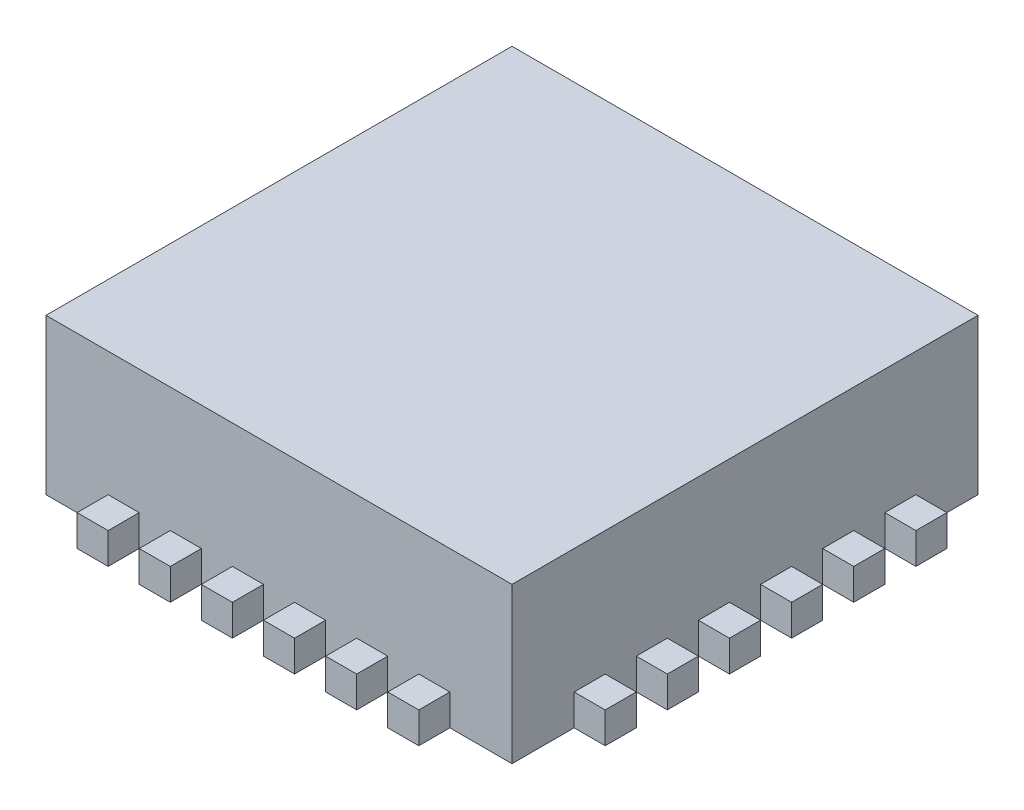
ISO-10303-21;
HEADER;
FILE_DESCRIPTION(('STEP AP214'),'2;1');
FILE_NAME('part.step','',(''),(''),'','','');
FILE_SCHEMA(('AUTOMOTIVE_DESIGN { 1 0 10303 214 1 1 1 1 }'));
ENDSEC;
DATA;
#1=APPLICATION_CONTEXT('core data for automotive mechanical design processes');
#2=APPLICATION_PROTOCOL_DEFINITION('international standard','automotive_design',2000,#1);
#3=PRODUCT_CONTEXT('',#1,'mechanical');
#4=PRODUCT('Part','Part','',(#3));
#5=PRODUCT_RELATED_PRODUCT_CATEGORY('part','',(#4));
#6=PRODUCT_DEFINITION_FORMATION('','',#4);
#7=PRODUCT_DEFINITION_CONTEXT('part definition',#1,'design');
#8=PRODUCT_DEFINITION('design','',#6,#7);
#9=PRODUCT_DEFINITION_SHAPE('','',#8);
#10=(LENGTH_UNIT() NAMED_UNIT(*) SI_UNIT(.MILLI.,.METRE.));
#11=(NAMED_UNIT(*) PLANE_ANGLE_UNIT() SI_UNIT($,.RADIAN.));
#12=(NAMED_UNIT(*) SI_UNIT($,.STERADIAN.) SOLID_ANGLE_UNIT());
#13=UNCERTAINTY_MEASURE_WITH_UNIT(LENGTH_MEASURE(1.E-05),#10,'distance_accuracy_value','');
#14=(GEOMETRIC_REPRESENTATION_CONTEXT(3) GLOBAL_UNCERTAINTY_ASSIGNED_CONTEXT((#13)) GLOBAL_UNIT_ASSIGNED_CONTEXT((#10,
#11,#12)) REPRESENTATION_CONTEXT('',''));
#15=CARTESIAN_POINT('',(0.,0.,0.));
#16=DIRECTION('',(0.,0.,1.));
#17=DIRECTION('',(1.,0.,0.));
#18=AXIS2_PLACEMENT_3D('',#15,#16,#17);
#19=CARTESIAN_POINT('',(1.5,0.5,-1.5));
#20=DIRECTION('',(-1.,0.,0.));
#21=DIRECTION('',(0.,0.,1.));
#22=AXIS2_PLACEMENT_3D('',#19,#20,#21);
#23=PLANE('',#22);
#24=DIRECTION('',(0.,0.,-1.));
#25=VECTOR('',#24,1.);
#26=CARTESIAN_POINT('',(1.5,-0.3,-1.5));
#27=LINE('',#26,#25);
#28=CARTESIAN_POINT('',(1.5,-0.3,-0.9));
#29=VERTEX_POINT('',#28);
#30=CARTESIAN_POINT('',(1.5,-0.3,-1.1));
#31=VERTEX_POINT('',#30);
#32=EDGE_CURVE('E1351',#29,#31,#27,.T.);
#33=ORIENTED_EDGE('',*,*,#32,.T.);
#34=DIRECTION('',(0.,-1.,0.));
#35=VECTOR('',#34,1.);
#36=CARTESIAN_POINT('',(1.5,0.5,-1.1));
#37=LINE('',#36,#35);
#38=CARTESIAN_POINT('',(1.5,-0.5,-1.1));
#39=VERTEX_POINT('',#38);
#40=EDGE_CURVE('E835',#31,#39,#37,.T.);
#41=ORIENTED_EDGE('',*,*,#40,.T.);
#42=DIRECTION('',(0.,0.,-1.));
#43=VECTOR('',#42,1.);
#44=CARTESIAN_POINT('',(1.5,-0.5,-1.5));
#45=LINE('',#44,#43);
#46=CARTESIAN_POINT('',(1.5,-0.5,-1.5));
#47=VERTEX_POINT('',#46);
#48=EDGE_CURVE('E1280',#39,#47,#45,.T.);
#49=ORIENTED_EDGE('',*,*,#48,.T.);
#50=DIRECTION('',(0.,-1.,0.));
#51=VECTOR('',#50,1.);
#52=CARTESIAN_POINT('',(1.5,0.5,-1.5));
#53=LINE('',#52,#51);
#54=CARTESIAN_POINT('',(1.5,0.5,-1.5));
#55=VERTEX_POINT('',#54);
#56=EDGE_CURVE('E1314',#55,#47,#53,.T.);
#57=ORIENTED_EDGE('',*,*,#56,.F.);
#58=DIRECTION('',(0.,0.,-1.));
#59=VECTOR('',#58,1.);
#60=CARTESIAN_POINT('',(1.5,0.5,-1.5));
#61=LINE('',#60,#59);
#62=CARTESIAN_POINT('',(1.5,0.5,1.5));
#63=VERTEX_POINT('',#62);
#64=EDGE_CURVE('E1281',#63,#55,#61,.T.);
#65=ORIENTED_EDGE('',*,*,#64,.F.);
#66=DIRECTION('',(0.,-1.,0.));
#67=VECTOR('',#66,1.);
#68=CARTESIAN_POINT('',(1.5,0.5,1.5));
#69=LINE('',#68,#67);
#70=CARTESIAN_POINT('',(1.5,-0.5,1.5));
#71=VERTEX_POINT('',#70);
#72=EDGE_CURVE('E1291',#63,#71,#69,.T.);
#73=ORIENTED_EDGE('',*,*,#72,.T.);
#74=CARTESIAN_POINT('',(1.5,-0.5,1.1));
#75=VERTEX_POINT('',#74);
#76=EDGE_CURVE('E1292',#71,#75,#45,.T.);
#77=ORIENTED_EDGE('',*,*,#76,.T.);
#78=DIRECTION('',(0.,1.,0.));
#79=VECTOR('',#78,1.);
#80=CARTESIAN_POINT('',(1.5,0.5,1.1));
#81=LINE('',#80,#79);
#82=CARTESIAN_POINT('',(1.5,-0.3,1.1));
#83=VERTEX_POINT('',#82);
#84=EDGE_CURVE('E962',#75,#83,#81,.T.);
#85=ORIENTED_EDGE('',*,*,#84,.T.);
#86=DIRECTION('',(0.,0.,-1.));
#87=VECTOR('',#86,1.);
#88=CARTESIAN_POINT('',(1.5,-0.3,-1.5));
#89=LINE('',#88,#87);
#90=CARTESIAN_POINT('',(1.5,-0.3,0.900000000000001));
#91=VERTEX_POINT('',#90);
#92=EDGE_CURVE('E1341',#83,#91,#89,.T.);
#93=ORIENTED_EDGE('',*,*,#92,.T.);
#94=DIRECTION('',(0.,-1.,0.));
#95=VECTOR('',#94,1.);
#96=CARTESIAN_POINT('',(1.5,0.5,0.900000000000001));
#97=LINE('',#96,#95);
#98=CARTESIAN_POINT('',(1.5,-0.5,0.9));
#99=VERTEX_POINT('',#98);
#100=EDGE_CURVE('E965',#91,#99,#97,.T.);
#101=ORIENTED_EDGE('',*,*,#100,.T.);
#102=CARTESIAN_POINT('',(1.5,-0.5,0.700000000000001));
#103=VERTEX_POINT('',#102);
#104=EDGE_CURVE('E1295',#99,#103,#45,.T.);
#105=ORIENTED_EDGE('',*,*,#104,.T.);
#106=DIRECTION('',(0.,1.,0.));
#107=VECTOR('',#106,1.);
#108=CARTESIAN_POINT('',(1.5,0.5,0.700000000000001));
#109=LINE('',#108,#107);
#110=CARTESIAN_POINT('',(1.5,-0.3,0.700000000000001));
#111=VERTEX_POINT('',#110);
#112=EDGE_CURVE('E936',#103,#111,#109,.T.);
#113=ORIENTED_EDGE('',*,*,#112,.T.);
#114=DIRECTION('',(0.,0.,-1.));
#115=VECTOR('',#114,1.);
#116=CARTESIAN_POINT('',(1.5,-0.3,-1.5));
#117=LINE('',#116,#115);
#118=CARTESIAN_POINT('',(1.5,-0.3,0.500000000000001));
#119=VERTEX_POINT('',#118);
#120=EDGE_CURVE('E1343',#111,#119,#117,.T.);
#121=ORIENTED_EDGE('',*,*,#120,.T.);
#122=DIRECTION('',(0.,-1.,0.));
#123=VECTOR('',#122,1.);
#124=CARTESIAN_POINT('',(1.5,0.5,0.5));
#125=LINE('',#124,#123);
#126=CARTESIAN_POINT('',(1.5,-0.5,0.500000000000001));
#127=VERTEX_POINT('',#126);
#128=EDGE_CURVE('E939',#119,#127,#125,.T.);
#129=ORIENTED_EDGE('',*,*,#128,.T.);
#130=CARTESIAN_POINT('',(1.5,-0.5,0.3));
#131=VERTEX_POINT('',#130);
#132=EDGE_CURVE('E2731',#127,#131,#45,.T.);
#133=ORIENTED_EDGE('',*,*,#132,.T.);
#134=DIRECTION('',(0.,1.,0.));
#135=VECTOR('',#134,1.);
#136=CARTESIAN_POINT('',(1.5,0.5,0.3));
#137=LINE('',#136,#135);
#138=CARTESIAN_POINT('',(1.5,-0.3,0.300000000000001));
#139=VERTEX_POINT('',#138);
#140=EDGE_CURVE('E910',#131,#139,#137,.T.);
#141=ORIENTED_EDGE('',*,*,#140,.T.);
#142=DIRECTION('',(0.,0.,-1.));
#143=VECTOR('',#142,1.);
#144=CARTESIAN_POINT('',(1.5,-0.3,-1.5));
#145=LINE('',#144,#143);
#146=CARTESIAN_POINT('',(1.5,-0.3,0.1));
#147=VERTEX_POINT('',#146);
#148=EDGE_CURVE('E1345',#139,#147,#145,.T.);
#149=ORIENTED_EDGE('',*,*,#148,.T.);
#150=DIRECTION('',(0.,-1.,0.));
#151=VECTOR('',#150,1.);
#152=CARTESIAN_POINT('',(1.5,0.5,0.100000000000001));
#153=LINE('',#152,#151);
#154=CARTESIAN_POINT('',(1.5,-0.5,0.100000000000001));
#155=VERTEX_POINT('',#154);
#156=EDGE_CURVE('E913',#147,#155,#153,.T.);
#157=ORIENTED_EDGE('',*,*,#156,.T.);
#158=CARTESIAN_POINT('',(1.5,-0.5,-0.0999999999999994));
#159=VERTEX_POINT('',#158);
#160=EDGE_CURVE('E2737',#155,#159,#45,.T.);
#161=ORIENTED_EDGE('',*,*,#160,.T.);
#162=DIRECTION('',(0.,1.,0.));
#163=VECTOR('',#162,1.);
#164=CARTESIAN_POINT('',(1.5,0.5,-0.0999999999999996));
#165=LINE('',#164,#163);
#166=CARTESIAN_POINT('',(1.5,-0.3,-0.0999999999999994));
#167=VERTEX_POINT('',#166);
#168=EDGE_CURVE('E884',#159,#167,#165,.T.);
#169=ORIENTED_EDGE('',*,*,#168,.T.);
#170=DIRECTION('',(0.,0.,-1.));
#171=VECTOR('',#170,1.);
#172=CARTESIAN_POINT('',(1.5,-0.3,-1.5));
#173=LINE('',#172,#171);
#174=CARTESIAN_POINT('',(1.5,-0.3,-0.299999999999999));
#175=VERTEX_POINT('',#174);
#176=EDGE_CURVE('E1347',#167,#175,#173,.T.);
#177=ORIENTED_EDGE('',*,*,#176,.T.);
#178=DIRECTION('',(0.,-1.,0.));
#179=VECTOR('',#178,1.);
#180=CARTESIAN_POINT('',(1.5,0.5,-0.299999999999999));
#181=LINE('',#180,#179);
#182=CARTESIAN_POINT('',(1.5,-0.5,-0.299999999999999));
#183=VERTEX_POINT('',#182);
#184=EDGE_CURVE('E887',#175,#183,#181,.T.);
#185=ORIENTED_EDGE('',*,*,#184,.T.);
#186=CARTESIAN_POINT('',(1.5,-0.5,-0.5));
#187=VERTEX_POINT('',#186);
#188=EDGE_CURVE('E2739',#183,#187,#45,.T.);
#189=ORIENTED_EDGE('',*,*,#188,.T.);
#190=DIRECTION('',(0.,1.,0.));
#191=VECTOR('',#190,1.);
#192=CARTESIAN_POINT('',(1.5,0.5,-0.5));
#193=LINE('',#192,#191);
#194=CARTESIAN_POINT('',(1.5,-0.3,-0.499999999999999));
#195=VERTEX_POINT('',#194);
#196=EDGE_CURVE('E858',#187,#195,#193,.T.);
#197=ORIENTED_EDGE('',*,*,#196,.T.);
#198=DIRECTION('',(0.,0.,-1.));
#199=VECTOR('',#198,1.);
#200=CARTESIAN_POINT('',(1.5,-0.3,-1.5));
#201=LINE('',#200,#199);
#202=CARTESIAN_POINT('',(1.5,-0.3,-0.699999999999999));
#203=VERTEX_POINT('',#202);
#204=EDGE_CURVE('E1349',#195,#203,#201,.T.);
#205=ORIENTED_EDGE('',*,*,#204,.T.);
#206=DIRECTION('',(0.,-1.,0.));
#207=VECTOR('',#206,1.);
#208=CARTESIAN_POINT('',(1.5,0.5,-0.699999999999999));
#209=LINE('',#208,#207);
#210=CARTESIAN_POINT('',(1.5,-0.5,-0.699999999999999));
#211=VERTEX_POINT('',#210);
#212=EDGE_CURVE('E861',#203,#211,#209,.T.);
#213=ORIENTED_EDGE('',*,*,#212,.T.);
#214=CARTESIAN_POINT('',(1.5,-0.5,-0.9));
#215=VERTEX_POINT('',#214);
#216=EDGE_CURVE('E2741',#211,#215,#45,.T.);
#217=ORIENTED_EDGE('',*,*,#216,.T.);
#218=DIRECTION('',(0.,1.,0.));
#219=VECTOR('',#218,1.);
#220=CARTESIAN_POINT('',(1.5,0.5,-0.9));
#221=LINE('',#220,#219);
#222=EDGE_CURVE('E832',#215,#29,#221,.T.);
#223=ORIENTED_EDGE('',*,*,#222,.T.);
#224=EDGE_LOOP('',(#33,#41,#49,#57,#65,#73,#77,#85,#93,#101,#105,#113,#121,#129,#133,#141,#149,
#157,#161,#169,#177,#185,#189,#197,#205,#213,#217,#223));
#225=FACE_BOUND('',#224,.T.);
#226=ADVANCED_FACE('F35',(#225),#23,.F.);
#227=CARTESIAN_POINT('',(-1.5,0.5,-1.5));
#228=DIRECTION('',(0.,0.,1.));
#229=DIRECTION('',(1.,0.,0.));
#230=AXIS2_PLACEMENT_3D('',#227,#228,#229);
#231=PLANE('',#230);
#232=DIRECTION('',(-1.,0.,0.));
#233=VECTOR('',#232,1.);
#234=CARTESIAN_POINT('',(-1.5,-0.3,-1.5));
#235=LINE('',#234,#233);
#236=CARTESIAN_POINT('',(-0.899999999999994,-0.3,-1.5));
#237=VERTEX_POINT('',#236);
#238=CARTESIAN_POINT('',(-1.09999999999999,-0.3,-1.5));
#239=VERTEX_POINT('',#238);
#240=EDGE_CURVE('E1339',#237,#239,#235,.T.);
#241=ORIENTED_EDGE('',*,*,#240,.T.);
#242=DIRECTION('',(0.,-1.,0.));
#243=VECTOR('',#242,1.);
#244=CARTESIAN_POINT('',(-1.09999999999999,0.5,-1.5));
#245=LINE('',#244,#243);
#246=CARTESIAN_POINT('',(-1.09999999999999,-0.5,-1.5));
#247=VERTEX_POINT('',#246);
#248=EDGE_CURVE('E991',#239,#247,#245,.T.);
#249=ORIENTED_EDGE('',*,*,#248,.T.);
#250=DIRECTION('',(-1.,0.,0.));
#251=VECTOR('',#250,1.);
#252=CARTESIAN_POINT('',(-1.5,-0.5,-1.5));
#253=LINE('',#252,#251);
#254=CARTESIAN_POINT('',(-1.5,-0.5,-1.5));
#255=VERTEX_POINT('',#254);
#256=EDGE_CURVE('E1294',#247,#255,#253,.T.);
#257=ORIENTED_EDGE('',*,*,#256,.T.);
#258=DIRECTION('',(0.,-1.,0.));
#259=VECTOR('',#258,1.);
#260=CARTESIAN_POINT('',(-1.5,0.5,-1.5));
#261=LINE('',#260,#259);
#262=CARTESIAN_POINT('',(-1.5,0.5,-1.5));
#263=VERTEX_POINT('',#262);
#264=EDGE_CURVE('E1311',#263,#255,#261,.T.);
#265=ORIENTED_EDGE('',*,*,#264,.F.);
#266=DIRECTION('',(-1.,0.,0.));
#267=VECTOR('',#266,1.);
#268=CARTESIAN_POINT('',(-1.5,0.5,-1.5));
#269=LINE('',#268,#267);
#270=EDGE_CURVE('E1284',#55,#263,#269,.T.);
#271=ORIENTED_EDGE('',*,*,#270,.F.);
#272=ORIENTED_EDGE('',*,*,#56,.T.);
#273=CARTESIAN_POINT('',(1.1,-0.5,-1.5));
#274=VERTEX_POINT('',#273);
#275=EDGE_CURVE('E1296',#47,#274,#253,.T.);
#276=ORIENTED_EDGE('',*,*,#275,.T.);
#277=DIRECTION('',(0.,1.,0.));
#278=VECTOR('',#277,1.);
#279=CARTESIAN_POINT('',(1.10000000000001,0.5,-1.5));
#280=LINE('',#279,#278);
#281=CARTESIAN_POINT('',(1.10000000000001,-0.3,-1.5));
#282=VERTEX_POINT('',#281);
#283=EDGE_CURVE('E1118',#274,#282,#280,.T.);
#284=ORIENTED_EDGE('',*,*,#283,.T.);
#285=DIRECTION('',(-1.,0.,0.));
#286=VECTOR('',#285,1.);
#287=CARTESIAN_POINT('',(-1.5,-0.3,-1.5));
#288=LINE('',#287,#286);
#289=CARTESIAN_POINT('',(0.900000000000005,-0.3,-1.5));
#290=VERTEX_POINT('',#289);
#291=EDGE_CURVE('E1329',#282,#290,#288,.T.);
#292=ORIENTED_EDGE('',*,*,#291,.T.);
#293=DIRECTION('',(0.,-1.,0.));
#294=VECTOR('',#293,1.);
#295=CARTESIAN_POINT('',(0.900000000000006,0.5,-1.5));
#296=LINE('',#295,#294);
#297=CARTESIAN_POINT('',(0.900000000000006,-0.5,-1.5));
#298=VERTEX_POINT('',#297);
#299=EDGE_CURVE('E1121',#290,#298,#296,.T.);
#300=ORIENTED_EDGE('',*,*,#299,.T.);
#301=CARTESIAN_POINT('',(0.700000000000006,-0.5,-1.5));
#302=VERTEX_POINT('',#301);
#303=EDGE_CURVE('E1299',#298,#302,#253,.T.);
#304=ORIENTED_EDGE('',*,*,#303,.T.);
#305=DIRECTION('',(0.,1.,0.));
#306=VECTOR('',#305,1.);
#307=CARTESIAN_POINT('',(0.700000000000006,0.5,-1.5));
#308=LINE('',#307,#306);
#309=CARTESIAN_POINT('',(0.700000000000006,-0.3,-1.5));
#310=VERTEX_POINT('',#309);
#311=EDGE_CURVE('E1092',#302,#310,#308,.T.);
#312=ORIENTED_EDGE('',*,*,#311,.T.);
#313=DIRECTION('',(-1.,0.,0.));
#314=VECTOR('',#313,1.);
#315=CARTESIAN_POINT('',(-1.5,-0.3,-1.5));
#316=LINE('',#315,#314);
#317=CARTESIAN_POINT('',(0.500000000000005,-0.3,-1.5));
#318=VERTEX_POINT('',#317);
#319=EDGE_CURVE('E1331',#310,#318,#316,.T.);
#320=ORIENTED_EDGE('',*,*,#319,.T.);
#321=DIRECTION('',(0.,-1.,0.));
#322=VECTOR('',#321,1.);
#323=CARTESIAN_POINT('',(0.500000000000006,0.5,-1.5));
#324=LINE('',#323,#322);
#325=CARTESIAN_POINT('',(0.500000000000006,-0.5,-1.5));
#326=VERTEX_POINT('',#325);
#327=EDGE_CURVE('E1095',#318,#326,#324,.T.);
#328=ORIENTED_EDGE('',*,*,#327,.T.);
#329=CARTESIAN_POINT('',(0.300000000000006,-0.5,-1.5));
#330=VERTEX_POINT('',#329);
#331=EDGE_CURVE('E2759',#326,#330,#253,.T.);
#332=ORIENTED_EDGE('',*,*,#331,.T.);
#333=DIRECTION('',(0.,1.,0.));
#334=VECTOR('',#333,1.);
#335=CARTESIAN_POINT('',(0.300000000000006,0.5,-1.5));
#336=LINE('',#335,#334);
#337=CARTESIAN_POINT('',(0.300000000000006,-0.3,-1.5));
#338=VERTEX_POINT('',#337);
#339=EDGE_CURVE('E1066',#330,#338,#336,.T.);
#340=ORIENTED_EDGE('',*,*,#339,.T.);
#341=DIRECTION('',(-1.,0.,0.));
#342=VECTOR('',#341,1.);
#343=CARTESIAN_POINT('',(-1.5,-0.3,-1.5));
#344=LINE('',#343,#342);
#345=CARTESIAN_POINT('',(0.100000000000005,-0.3,-1.5));
#346=VERTEX_POINT('',#345);
#347=EDGE_CURVE('E1333',#338,#346,#344,.T.);
#348=ORIENTED_EDGE('',*,*,#347,.T.);
#349=DIRECTION('',(0.,-1.,0.));
#350=VECTOR('',#349,1.);
#351=CARTESIAN_POINT('',(0.100000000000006,0.5,-1.5));
#352=LINE('',#351,#350);
#353=CARTESIAN_POINT('',(0.100000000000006,-0.5,-1.5));
#354=VERTEX_POINT('',#353);
#355=EDGE_CURVE('E1069',#346,#354,#352,.T.);
#356=ORIENTED_EDGE('',*,*,#355,.T.);
#357=CARTESIAN_POINT('',(-0.0999999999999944,-0.5,-1.5));
#358=VERTEX_POINT('',#357);
#359=EDGE_CURVE('E2770',#354,#358,#253,.T.);
#360=ORIENTED_EDGE('',*,*,#359,.T.);
#361=DIRECTION('',(0.,1.,0.));
#362=VECTOR('',#361,1.);
#363=CARTESIAN_POINT('',(-0.0999999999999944,0.5,-1.5));
#364=LINE('',#363,#362);
#365=CARTESIAN_POINT('',(-0.0999999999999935,-0.3,-1.5));
#366=VERTEX_POINT('',#365);
#367=EDGE_CURVE('E1040',#358,#366,#364,.T.);
#368=ORIENTED_EDGE('',*,*,#367,.T.);
#369=DIRECTION('',(-1.,0.,0.));
#370=VECTOR('',#369,1.);
#371=CARTESIAN_POINT('',(-1.5,-0.3,-1.5));
#372=LINE('',#371,#370);
#373=CARTESIAN_POINT('',(-0.299999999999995,-0.3,-1.5));
#374=VERTEX_POINT('',#373);
#375=EDGE_CURVE('E1335',#366,#374,#372,.T.);
#376=ORIENTED_EDGE('',*,*,#375,.T.);
#377=DIRECTION('',(0.,-1.,0.));
#378=VECTOR('',#377,1.);
#379=CARTESIAN_POINT('',(-0.299999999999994,0.5,-1.5));
#380=LINE('',#379,#378);
#381=CARTESIAN_POINT('',(-0.299999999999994,-0.5,-1.5));
#382=VERTEX_POINT('',#381);
#383=EDGE_CURVE('E1043',#374,#382,#380,.T.);
#384=ORIENTED_EDGE('',*,*,#383,.T.);
#385=CARTESIAN_POINT('',(-0.499999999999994,-0.5,-1.5));
#386=VERTEX_POINT('',#385);
#387=EDGE_CURVE('E2781',#382,#386,#253,.T.);
#388=ORIENTED_EDGE('',*,*,#387,.T.);
#389=DIRECTION('',(0.,1.,0.));
#390=VECTOR('',#389,1.);
#391=CARTESIAN_POINT('',(-0.499999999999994,0.5,-1.5));
#392=LINE('',#391,#390);
#393=CARTESIAN_POINT('',(-0.499999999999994,-0.3,-1.5));
#394=VERTEX_POINT('',#393);
#395=EDGE_CURVE('E1014',#386,#394,#392,.T.);
#396=ORIENTED_EDGE('',*,*,#395,.T.);
#397=DIRECTION('',(-1.,0.,0.));
#398=VECTOR('',#397,1.);
#399=CARTESIAN_POINT('',(-1.5,-0.3,-1.5));
#400=LINE('',#399,#398);
#401=CARTESIAN_POINT('',(-0.699999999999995,-0.3,-1.5));
#402=VERTEX_POINT('',#401);
#403=EDGE_CURVE('E1337',#394,#402,#400,.T.);
#404=ORIENTED_EDGE('',*,*,#403,.T.);
#405=DIRECTION('',(0.,-1.,0.));
#406=VECTOR('',#405,1.);
#407=CARTESIAN_POINT('',(-0.699999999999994,0.5,-1.5));
#408=LINE('',#407,#406);
#409=CARTESIAN_POINT('',(-0.699999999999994,-0.5,-1.5));
#410=VERTEX_POINT('',#409);
#411=EDGE_CURVE('E1017',#402,#410,#408,.T.);
#412=ORIENTED_EDGE('',*,*,#411,.T.);
#413=CARTESIAN_POINT('',(-0.899999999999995,-0.5,-1.5));
#414=VERTEX_POINT('',#413);
#415=EDGE_CURVE('E1645',#410,#414,#253,.T.);
#416=ORIENTED_EDGE('',*,*,#415,.T.);
#417=DIRECTION('',(0.,1.,0.));
#418=VECTOR('',#417,1.);
#419=CARTESIAN_POINT('',(-0.899999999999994,0.5,-1.5));
#420=LINE('',#419,#418);
#421=EDGE_CURVE('E988',#414,#237,#420,.T.);
#422=ORIENTED_EDGE('',*,*,#421,.T.);
#423=EDGE_LOOP('',(#241,#249,#257,#265,#271,#272,#276,#284,#292,#300,#304,#312,#320,#328,#332,
#340,#348,#356,#360,#368,#376,#384,#388,#396,#404,#412,#416,#422));
#424=FACE_BOUND('',#423,.T.);
#425=ADVANCED_FACE('F1420',(#424),#231,.F.);
#426=CARTESIAN_POINT('',(-1.5,0.5,-1.5));
#427=DIRECTION('',(1.,0.,0.));
#428=DIRECTION('',(0.,0.,-1.));
#429=AXIS2_PLACEMENT_3D('',#426,#427,#428);
#430=PLANE('',#429);
#431=DIRECTION('',(0.,0.,1.));
#432=VECTOR('',#431,1.);
#433=CARTESIAN_POINT('',(-1.5,-0.3,-1.5));
#434=LINE('',#433,#432);
#435=CARTESIAN_POINT('',(-1.5,-0.3,0.9));
#436=VERTEX_POINT('',#435);
#437=CARTESIAN_POINT('',(-1.5,-0.3,1.1));
#438=VERTEX_POINT('',#437);
#439=EDGE_CURVE('E1327',#436,#438,#434,.T.);
#440=ORIENTED_EDGE('',*,*,#439,.T.);
#441=DIRECTION('',(0.,-1.,0.));
#442=VECTOR('',#441,1.);
#443=CARTESIAN_POINT('',(-1.5,0.5,1.1));
#444=LINE('',#443,#442);
#445=CARTESIAN_POINT('',(-1.5,-0.5,1.1));
#446=VERTEX_POINT('',#445);
#447=EDGE_CURVE('E1147',#438,#446,#444,.T.);
#448=ORIENTED_EDGE('',*,*,#447,.T.);
#449=DIRECTION('',(0.,0.,1.));
#450=VECTOR('',#449,1.);
#451=CARTESIAN_POINT('',(-1.5,-0.5,-1.5));
#452=LINE('',#451,#450);
#453=CARTESIAN_POINT('',(-1.5,-0.5,1.5));
#454=VERTEX_POINT('',#453);
#455=EDGE_CURVE('E1298',#446,#454,#452,.T.);
#456=ORIENTED_EDGE('',*,*,#455,.T.);
#457=DIRECTION('',(0.,-1.,0.));
#458=VECTOR('',#457,1.);
#459=CARTESIAN_POINT('',(-1.5,0.5,1.5));
#460=LINE('',#459,#458);
#461=CARTESIAN_POINT('',(-1.5,0.5,1.5));
#462=VERTEX_POINT('',#461);
#463=EDGE_CURVE('E1308',#462,#454,#460,.T.);
#464=ORIENTED_EDGE('',*,*,#463,.F.);
#465=DIRECTION('',(0.,0.,1.));
#466=VECTOR('',#465,1.);
#467=CARTESIAN_POINT('',(-1.5,0.5,-1.5));
#468=LINE('',#467,#466);
#469=EDGE_CURVE('E1287',#263,#462,#468,.T.);
#470=ORIENTED_EDGE('',*,*,#469,.F.);
#471=ORIENTED_EDGE('',*,*,#264,.T.);
#472=CARTESIAN_POINT('',(-1.5,-0.5,-1.1));
#473=VERTEX_POINT('',#472);
#474=EDGE_CURVE('E1300',#255,#473,#452,.T.);
#475=ORIENTED_EDGE('',*,*,#474,.T.);
#476=DIRECTION('',(0.,1.,0.));
#477=VECTOR('',#476,1.);
#478=CARTESIAN_POINT('',(-1.5,0.5,-1.1));
#479=LINE('',#478,#477);
#480=CARTESIAN_POINT('',(-1.5,-0.3,-1.1));
#481=VERTEX_POINT('',#480);
#482=EDGE_CURVE('E1274',#473,#481,#479,.T.);
#483=ORIENTED_EDGE('',*,*,#482,.T.);
#484=DIRECTION('',(0.,0.,1.));
#485=VECTOR('',#484,1.);
#486=CARTESIAN_POINT('',(-1.5,-0.3,-1.5));
#487=LINE('',#486,#485);
#488=CARTESIAN_POINT('',(-1.5,-0.3,-0.9));
#489=VERTEX_POINT('',#488);
#490=EDGE_CURVE('E1317',#481,#489,#487,.T.);
#491=ORIENTED_EDGE('',*,*,#490,.T.);
#492=DIRECTION('',(0.,-1.,0.));
#493=VECTOR('',#492,1.);
#494=CARTESIAN_POINT('',(-1.5,0.5,-0.9));
#495=LINE('',#494,#493);
#496=CARTESIAN_POINT('',(-1.5,-0.5,-0.9));
#497=VERTEX_POINT('',#496);
#498=EDGE_CURVE('E1277',#489,#497,#495,.T.);
#499=ORIENTED_EDGE('',*,*,#498,.T.);
#500=CARTESIAN_POINT('',(-1.5,-0.5,-0.7));
#501=VERTEX_POINT('',#500);
#502=EDGE_CURVE('E1303',#497,#501,#452,.T.);
#503=ORIENTED_EDGE('',*,*,#502,.T.);
#504=DIRECTION('',(0.,1.,0.));
#505=VECTOR('',#504,1.);
#506=CARTESIAN_POINT('',(-1.5,0.5,-0.7));
#507=LINE('',#506,#505);
#508=CARTESIAN_POINT('',(-1.5,-0.3,-0.700000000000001));
#509=VERTEX_POINT('',#508);
#510=EDGE_CURVE('E1248',#501,#509,#507,.T.);
#511=ORIENTED_EDGE('',*,*,#510,.T.);
#512=DIRECTION('',(0.,0.,1.));
#513=VECTOR('',#512,1.);
#514=CARTESIAN_POINT('',(-1.5,-0.3,-1.5));
#515=LINE('',#514,#513);
#516=CARTESIAN_POINT('',(-1.5,-0.3,-0.5));
#517=VERTEX_POINT('',#516);
#518=EDGE_CURVE('E1319',#509,#517,#515,.T.);
#519=ORIENTED_EDGE('',*,*,#518,.T.);
#520=DIRECTION('',(0.,-1.,0.));
#521=VECTOR('',#520,1.);
#522=CARTESIAN_POINT('',(-1.5,0.5,-0.5));
#523=LINE('',#522,#521);
#524=CARTESIAN_POINT('',(-1.5,-0.5,-0.500000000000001));
#525=VERTEX_POINT('',#524);
#526=EDGE_CURVE('E1251',#517,#525,#523,.T.);
#527=ORIENTED_EDGE('',*,*,#526,.T.);
#528=CARTESIAN_POINT('',(-1.5,-0.5,-0.3));
#529=VERTEX_POINT('',#528);
#530=EDGE_CURVE('E1659',#525,#529,#452,.T.);
#531=ORIENTED_EDGE('',*,*,#530,.T.);
#532=DIRECTION('',(0.,1.,0.));
#533=VECTOR('',#532,1.);
#534=CARTESIAN_POINT('',(-1.5,0.5,-0.300000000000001));
#535=LINE('',#534,#533);
#536=CARTESIAN_POINT('',(-1.5,-0.3,-0.300000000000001));
#537=VERTEX_POINT('',#536);
#538=EDGE_CURVE('E1222',#529,#537,#535,.T.);
#539=ORIENTED_EDGE('',*,*,#538,.T.);
#540=DIRECTION('',(0.,0.,1.));
#541=VECTOR('',#540,1.);
#542=CARTESIAN_POINT('',(-1.5,-0.3,-1.5));
#543=LINE('',#542,#541);
#544=CARTESIAN_POINT('',(-1.5,-0.3,-0.1));
#545=VERTEX_POINT('',#544);
#546=EDGE_CURVE('E1321',#537,#545,#543,.T.);
#547=ORIENTED_EDGE('',*,*,#546,.T.);
#548=DIRECTION('',(0.,-1.,0.));
#549=VECTOR('',#548,1.);
#550=CARTESIAN_POINT('',(-1.5,0.5,-0.100000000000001));
#551=LINE('',#550,#549);
#552=CARTESIAN_POINT('',(-1.5,-0.5,-0.100000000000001));
#553=VERTEX_POINT('',#552);
#554=EDGE_CURVE('E1225',#545,#553,#551,.T.);
#555=ORIENTED_EDGE('',*,*,#554,.T.);
#556=CARTESIAN_POINT('',(-1.5,-0.5,0.0999999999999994));
#557=VERTEX_POINT('',#556);
#558=EDGE_CURVE('E1670',#553,#557,#452,.T.);
#559=ORIENTED_EDGE('',*,*,#558,.T.);
#560=DIRECTION('',(0.,1.,0.));
#561=VECTOR('',#560,1.);
#562=CARTESIAN_POINT('',(-1.5,0.5,0.0999999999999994));
#563=LINE('',#562,#561);
#564=CARTESIAN_POINT('',(-1.5,-0.3,0.0999999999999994));
#565=VERTEX_POINT('',#564);
#566=EDGE_CURVE('E1196',#557,#565,#563,.T.);
#567=ORIENTED_EDGE('',*,*,#566,.T.);
#568=DIRECTION('',(0.,0.,1.));
#569=VECTOR('',#568,1.);
#570=CARTESIAN_POINT('',(-1.5,-0.3,-1.5));
#571=LINE('',#570,#569);
#572=CARTESIAN_POINT('',(-1.5,-0.3,0.299999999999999));
#573=VERTEX_POINT('',#572);
#574=EDGE_CURVE('E1323',#565,#573,#571,.T.);
#575=ORIENTED_EDGE('',*,*,#574,.T.);
#576=DIRECTION('',(0.,-1.,0.));
#577=VECTOR('',#576,1.);
#578=CARTESIAN_POINT('',(-1.5,0.5,0.299999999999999));
#579=LINE('',#578,#577);
#580=CARTESIAN_POINT('',(-1.5,-0.5,0.299999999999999));
#581=VERTEX_POINT('',#580);
#582=EDGE_CURVE('E1199',#573,#581,#579,.T.);
#583=ORIENTED_EDGE('',*,*,#582,.T.);
#584=CARTESIAN_POINT('',(-1.5,-0.5,0.5));
#585=VERTEX_POINT('',#584);
#586=EDGE_CURVE('E1681',#581,#585,#452,.T.);
#587=ORIENTED_EDGE('',*,*,#586,.T.);
#588=DIRECTION('',(0.,1.,0.));
#589=VECTOR('',#588,1.);
#590=CARTESIAN_POINT('',(-1.5,0.5,0.5));
#591=LINE('',#590,#589);
#592=CARTESIAN_POINT('',(-1.5,-0.3,0.5));
#593=VERTEX_POINT('',#592);
#594=EDGE_CURVE('E1170',#585,#593,#591,.T.);
#595=ORIENTED_EDGE('',*,*,#594,.T.);
#596=DIRECTION('',(0.,0.,1.));
#597=VECTOR('',#596,1.);
#598=CARTESIAN_POINT('',(-1.5,-0.3,-1.5));
#599=LINE('',#598,#597);
#600=CARTESIAN_POINT('',(-1.5,-0.3,0.699999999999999));
#601=VERTEX_POINT('',#600);
#602=EDGE_CURVE('E1325',#593,#601,#599,.T.);
#603=ORIENTED_EDGE('',*,*,#602,.T.);
#604=DIRECTION('',(0.,-1.,0.));
#605=VECTOR('',#604,1.);
#606=CARTESIAN_POINT('',(-1.5,0.5,0.699999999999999));
#607=LINE('',#606,#605);
#608=CARTESIAN_POINT('',(-1.5,-0.5,0.699999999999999));
#609=VERTEX_POINT('',#608);
#610=EDGE_CURVE('E1173',#601,#609,#607,.T.);
#611=ORIENTED_EDGE('',*,*,#610,.T.);
#612=CARTESIAN_POINT('',(-1.5,-0.5,0.9));
#613=VERTEX_POINT('',#612);
#614=EDGE_CURVE('E1692',#609,#613,#452,.T.);
#615=ORIENTED_EDGE('',*,*,#614,.T.);
#616=DIRECTION('',(0.,1.,0.));
#617=VECTOR('',#616,1.);
#618=CARTESIAN_POINT('',(-1.5,0.5,0.9));
#619=LINE('',#618,#617);
#620=EDGE_CURVE('E1144',#613,#436,#619,.T.);
#621=ORIENTED_EDGE('',*,*,#620,.T.);
#622=EDGE_LOOP('',(#440,#448,#456,#464,#470,#471,#475,#483,#491,#499,#503,#511,#519,#527,#531,
#539,#547,#555,#559,#567,#575,#583,#587,#595,#603,#611,#615,#621));
#623=FACE_BOUND('',#622,.T.);
#624=ADVANCED_FACE('F1424',(#623),#430,.F.);
#625=CARTESIAN_POINT('',(-1.5,0.5,1.5));
#626=DIRECTION('',(0.,0.,-1.));
#627=DIRECTION('',(-1.,0.,0.));
#628=AXIS2_PLACEMENT_3D('',#625,#626,#627);
#629=PLANE('',#628);
#630=DIRECTION('',(1.,0.,0.));
#631=VECTOR('',#630,1.);
#632=CARTESIAN_POINT('',(-1.5,-0.3,1.5));
#633=LINE('',#632,#631);
#634=CARTESIAN_POINT('',(0.899999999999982,-0.3,1.5));
#635=VERTEX_POINT('',#634);
#636=CARTESIAN_POINT('',(1.09999999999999,-0.3,1.5));
#637=VERTEX_POINT('',#636);
#638=EDGE_CURVE('E11',#635,#637,#633,.T.);
#639=ORIENTED_EDGE('',*,*,#638,.T.);
#640=DIRECTION('',(0.,-1.,0.));
#641=VECTOR('',#640,1.);
#642=CARTESIAN_POINT('',(1.09999999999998,0.5,1.5));
#643=LINE('',#642,#641);
#644=CARTESIAN_POINT('',(1.09999999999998,-0.5,1.5));
#645=VERTEX_POINT('',#644);
#646=EDGE_CURVE('E680',#637,#645,#643,.T.);
#647=ORIENTED_EDGE('',*,*,#646,.T.);
#648=DIRECTION('',(1.,0.,0.));
#649=VECTOR('',#648,1.);
#650=CARTESIAN_POINT('',(-1.5,-0.5,1.5));
#651=LINE('',#650,#649);
#652=EDGE_CURVE('E1302',#645,#71,#651,.T.);
#653=ORIENTED_EDGE('',*,*,#652,.T.);
#654=ORIENTED_EDGE('',*,*,#72,.F.);
#655=DIRECTION('',(1.,0.,0.));
#656=VECTOR('',#655,1.);
#657=CARTESIAN_POINT('',(-1.5,0.5,1.5));
#658=LINE('',#657,#656);
#659=EDGE_CURVE('E1289',#462,#63,#658,.T.);
#660=ORIENTED_EDGE('',*,*,#659,.F.);
#661=ORIENTED_EDGE('',*,*,#463,.T.);
#662=CARTESIAN_POINT('',(-1.10000000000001,-0.5,1.5));
#663=VERTEX_POINT('',#662);
#664=EDGE_CURVE('E1285',#454,#663,#651,.T.);
#665=ORIENTED_EDGE('',*,*,#664,.T.);
#666=DIRECTION('',(0.,1.,0.));
#667=VECTOR('',#666,1.);
#668=CARTESIAN_POINT('',(-1.10000000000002,0.5,1.5));
#669=LINE('',#668,#667);
#670=CARTESIAN_POINT('',(-1.10000000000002,-0.3,1.5));
#671=VERTEX_POINT('',#670);
#672=EDGE_CURVE('E806',#663,#671,#669,.T.);
#673=ORIENTED_EDGE('',*,*,#672,.T.);
#674=DIRECTION('',(1.,0.,0.));
#675=VECTOR('',#674,1.);
#676=CARTESIAN_POINT('',(-1.5,-0.3,1.5));
#677=LINE('',#676,#675);
#678=CARTESIAN_POINT('',(-0.900000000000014,-0.3,1.5));
#679=VERTEX_POINT('',#678);
#680=EDGE_CURVE('E1353',#671,#679,#677,.T.);
#681=ORIENTED_EDGE('',*,*,#680,.T.);
#682=DIRECTION('',(0.,-1.,0.));
#683=VECTOR('',#682,1.);
#684=CARTESIAN_POINT('',(-0.900000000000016,0.5,1.5));
#685=LINE('',#684,#683);
#686=CARTESIAN_POINT('',(-0.900000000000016,-0.5,1.5));
#687=VERTEX_POINT('',#686);
#688=EDGE_CURVE('E809',#679,#687,#685,.T.);
#689=ORIENTED_EDGE('',*,*,#688,.T.);
#690=CARTESIAN_POINT('',(-0.700000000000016,-0.5,1.5));
#691=VERTEX_POINT('',#690);
#692=EDGE_CURVE('E1305',#687,#691,#651,.T.);
#693=ORIENTED_EDGE('',*,*,#692,.T.);
#694=DIRECTION('',(0.,1.,0.));
#695=VECTOR('',#694,1.);
#696=CARTESIAN_POINT('',(-0.700000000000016,0.5,1.5));
#697=LINE('',#696,#695);
#698=CARTESIAN_POINT('',(-0.700000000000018,-0.3,1.5));
#699=VERTEX_POINT('',#698);
#700=EDGE_CURVE('E780',#691,#699,#697,.T.);
#701=ORIENTED_EDGE('',*,*,#700,.T.);
#702=DIRECTION('',(1.,0.,0.));
#703=VECTOR('',#702,1.);
#704=CARTESIAN_POINT('',(-1.5,-0.3,1.5));
#705=LINE('',#704,#703);
#706=CARTESIAN_POINT('',(-0.500000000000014,-0.3,1.5));
#707=VERTEX_POINT('',#706);
#708=EDGE_CURVE('E1355',#699,#707,#705,.T.);
#709=ORIENTED_EDGE('',*,*,#708,.T.);
#710=DIRECTION('',(0.,-1.,0.));
#711=VECTOR('',#710,1.);
#712=CARTESIAN_POINT('',(-0.500000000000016,0.5,1.5));
#713=LINE('',#712,#711);
#714=CARTESIAN_POINT('',(-0.500000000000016,-0.5,1.5));
#715=VERTEX_POINT('',#714);
#716=EDGE_CURVE('E783',#707,#715,#713,.T.);
#717=ORIENTED_EDGE('',*,*,#716,.T.);
#718=CARTESIAN_POINT('',(-0.300000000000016,-0.5,1.5));
#719=VERTEX_POINT('',#718);
#720=EDGE_CURVE('E2385',#715,#719,#651,.T.);
#721=ORIENTED_EDGE('',*,*,#720,.T.);
#722=DIRECTION('',(0.,1.,0.));
#723=VECTOR('',#722,1.);
#724=CARTESIAN_POINT('',(-0.300000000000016,0.5,1.5));
#725=LINE('',#724,#723);
#726=CARTESIAN_POINT('',(-0.300000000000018,-0.3,1.5));
#727=VERTEX_POINT('',#726);
#728=EDGE_CURVE('E754',#719,#727,#725,.T.);
#729=ORIENTED_EDGE('',*,*,#728,.T.);
#730=DIRECTION('',(1.,0.,0.));
#731=VECTOR('',#730,1.);
#732=CARTESIAN_POINT('',(-1.5,-0.3,1.5));
#733=LINE('',#732,#731);
#734=CARTESIAN_POINT('',(-0.100000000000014,-0.3,1.5));
#735=VERTEX_POINT('',#734);
#736=EDGE_CURVE('E1357',#727,#735,#733,.T.);
#737=ORIENTED_EDGE('',*,*,#736,.T.);
#738=DIRECTION('',(0.,-1.,0.));
#739=VECTOR('',#738,1.);
#740=CARTESIAN_POINT('',(-0.100000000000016,0.5,1.5));
#741=LINE('',#740,#739);
#742=CARTESIAN_POINT('',(-0.100000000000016,-0.5,1.5));
#743=VERTEX_POINT('',#742);
#744=EDGE_CURVE('E757',#735,#743,#741,.T.);
#745=ORIENTED_EDGE('',*,*,#744,.T.);
#746=CARTESIAN_POINT('',(0.0999999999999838,-0.5,1.5));
#747=VERTEX_POINT('',#746);
#748=EDGE_CURVE('E1381',#743,#747,#651,.T.);
#749=ORIENTED_EDGE('',*,*,#748,.T.);
#750=DIRECTION('',(0.,1.,0.));
#751=VECTOR('',#750,1.);
#752=CARTESIAN_POINT('',(0.0999999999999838,0.5,1.5));
#753=LINE('',#752,#751);
#754=CARTESIAN_POINT('',(0.0999999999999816,-0.3,1.5));
#755=VERTEX_POINT('',#754);
#756=EDGE_CURVE('E728',#747,#755,#753,.T.);
#757=ORIENTED_EDGE('',*,*,#756,.T.);
#758=DIRECTION('',(1.,0.,0.));
#759=VECTOR('',#758,1.);
#760=CARTESIAN_POINT('',(-1.5,-0.3,1.5));
#761=LINE('',#760,#759);
#762=CARTESIAN_POINT('',(0.299999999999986,-0.3,1.5));
#763=VERTEX_POINT('',#762);
#764=EDGE_CURVE('E1359',#755,#763,#761,.T.);
#765=ORIENTED_EDGE('',*,*,#764,.T.);
#766=DIRECTION('',(0.,-1.,0.));
#767=VECTOR('',#766,1.);
#768=CARTESIAN_POINT('',(0.299999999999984,0.5,1.5));
#769=LINE('',#768,#767);
#770=CARTESIAN_POINT('',(0.299999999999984,-0.5,1.5));
#771=VERTEX_POINT('',#770);
#772=EDGE_CURVE('E731',#763,#771,#769,.T.);
#773=ORIENTED_EDGE('',*,*,#772,.T.);
#774=CARTESIAN_POINT('',(0.499999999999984,-0.5,1.5));
#775=VERTEX_POINT('',#774);
#776=EDGE_CURVE('E1380',#771,#775,#651,.T.);
#777=ORIENTED_EDGE('',*,*,#776,.T.);
#778=DIRECTION('',(0.,1.,0.));
#779=VECTOR('',#778,1.);
#780=CARTESIAN_POINT('',(0.499999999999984,0.5,1.5));
#781=LINE('',#780,#779);
#782=CARTESIAN_POINT('',(0.499999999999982,-0.3,1.5));
#783=VERTEX_POINT('',#782);
#784=EDGE_CURVE('E702',#775,#783,#781,.T.);
#785=ORIENTED_EDGE('',*,*,#784,.T.);
#786=DIRECTION('',(1.,0.,0.));
#787=VECTOR('',#786,1.);
#788=CARTESIAN_POINT('',(-1.5,-0.3,1.5));
#789=LINE('',#788,#787);
#790=CARTESIAN_POINT('',(0.699999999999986,-0.3,1.5));
#791=VERTEX_POINT('',#790);
#792=EDGE_CURVE('E42',#783,#791,#789,.T.);
#793=ORIENTED_EDGE('',*,*,#792,.T.);
#794=DIRECTION('',(0.,-1.,0.));
#795=VECTOR('',#794,1.);
#796=CARTESIAN_POINT('',(0.699999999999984,0.5,1.5));
#797=LINE('',#796,#795);
#798=CARTESIAN_POINT('',(0.699999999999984,-0.5,1.5));
#799=VERTEX_POINT('',#798);
#800=EDGE_CURVE('E705',#791,#799,#797,.T.);
#801=ORIENTED_EDGE('',*,*,#800,.T.);
#802=CARTESIAN_POINT('',(0.899999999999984,-0.5,1.5));
#803=VERTEX_POINT('',#802);
#804=EDGE_CURVE('E1379',#799,#803,#651,.T.);
#805=ORIENTED_EDGE('',*,*,#804,.T.);
#806=DIRECTION('',(0.,1.,0.));
#807=VECTOR('',#806,1.);
#808=CARTESIAN_POINT('',(0.899999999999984,0.5,1.5));
#809=LINE('',#808,#807);
#810=EDGE_CURVE('E52',#803,#635,#809,.T.);
#811=ORIENTED_EDGE('',*,*,#810,.T.);
#812=EDGE_LOOP('',(#639,#647,#653,#654,#660,#661,#665,#673,#681,#689,#693,#701,#709,#717,#721,
#729,#737,#745,#749,#757,#765,#773,#777,#785,#793,#801,#805,#811));
#813=FACE_BOUND('',#812,.T.);
#814=ADVANCED_FACE('F1362',(#813),#629,.F.);
#815=CARTESIAN_POINT('',(0.,0.5,0.));
#816=DIRECTION('',(0.,1.,0.));
#817=DIRECTION('',(0.,0.,1.));
#818=AXIS2_PLACEMENT_3D('',#815,#816,#817);
#819=PLANE('',#818);
#820=ORIENTED_EDGE('',*,*,#64,.T.);
#821=ORIENTED_EDGE('',*,*,#270,.T.);
#822=ORIENTED_EDGE('',*,*,#469,.T.);
#823=ORIENTED_EDGE('',*,*,#659,.T.);
#824=EDGE_LOOP('',(#820,#821,#822,#823));
#825=FACE_BOUND('',#824,.T.);
#826=ADVANCED_FACE('F1434',(#825),#819,.T.);
#827=CARTESIAN_POINT('',(0.,-0.5,0.));
#828=DIRECTION('',(0.,1.,0.));
#829=DIRECTION('',(0.,0.,1.));
#830=AXIS2_PLACEMENT_3D('',#827,#828,#829);
#831=PLANE('',#830);
#832=ORIENTED_EDGE('',*,*,#652,.F.);
#833=DIRECTION('',(0.,0.,1.));
#834=VECTOR('',#833,1.);
#835=CARTESIAN_POINT('',(1.09999999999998,-0.5,1.70000000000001));
#836=LINE('',#835,#834);
#837=CARTESIAN_POINT('',(1.09999999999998,-0.5,1.70000000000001));
#838=VERTEX_POINT('',#837);
#839=EDGE_CURVE('E670',#645,#838,#836,.T.);
#840=ORIENTED_EDGE('',*,*,#839,.T.);
#841=DIRECTION('',(-1.,0.,0.));
#842=VECTOR('',#841,1.);
#843=CARTESIAN_POINT('',(0.899999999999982,-0.5,1.70000000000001));
#844=LINE('',#843,#842);
#845=CARTESIAN_POINT('',(0.899999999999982,-0.5,1.70000000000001));
#846=VERTEX_POINT('',#845);
#847=EDGE_CURVE('E675',#838,#846,#844,.T.);
#848=ORIENTED_EDGE('',*,*,#847,.T.);
#849=DIRECTION('',(0.,0.,-1.));
#850=VECTOR('',#849,1.);
#851=CARTESIAN_POINT('',(0.899999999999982,-0.5,1.70000000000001));
#852=LINE('',#851,#850);
#853=EDGE_CURVE('E653',#846,#803,#852,.T.);
#854=ORIENTED_EDGE('',*,*,#853,.T.);
#855=ORIENTED_EDGE('',*,*,#804,.F.);
#856=DIRECTION('',(0.,0.,1.));
#857=VECTOR('',#856,1.);
#858=CARTESIAN_POINT('',(0.699999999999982,-0.5,1.70000000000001));
#859=LINE('',#858,#857);
#860=CARTESIAN_POINT('',(0.699999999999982,-0.5,1.70000000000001));
#861=VERTEX_POINT('',#860);
#862=EDGE_CURVE('E687',#799,#861,#859,.T.);
#863=ORIENTED_EDGE('',*,*,#862,.T.);
#864=DIRECTION('',(-1.,0.,0.));
#865=VECTOR('',#864,1.);
#866=CARTESIAN_POINT('',(0.499999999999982,-0.5,1.70000000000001));
#867=LINE('',#866,#865);
#868=CARTESIAN_POINT('',(0.499999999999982,-0.5,1.70000000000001));
#869=VERTEX_POINT('',#868);
#870=EDGE_CURVE('E682',#861,#869,#867,.T.);
#871=ORIENTED_EDGE('',*,*,#870,.T.);
#872=DIRECTION('',(0.,0.,-1.));
#873=VECTOR('',#872,1.);
#874=CARTESIAN_POINT('',(0.499999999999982,-0.5,1.70000000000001));
#875=LINE('',#874,#873);
#876=EDGE_CURVE('E695',#869,#775,#875,.T.);
#877=ORIENTED_EDGE('',*,*,#876,.T.);
#878=ORIENTED_EDGE('',*,*,#776,.F.);
#879=DIRECTION('',(0.,0.,1.));
#880=VECTOR('',#879,1.);
#881=CARTESIAN_POINT('',(0.299999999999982,-0.5,1.7));
#882=LINE('',#881,#880);
#883=CARTESIAN_POINT('',(0.299999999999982,-0.5,1.7));
#884=VERTEX_POINT('',#883);
#885=EDGE_CURVE('E713',#771,#884,#882,.T.);
#886=ORIENTED_EDGE('',*,*,#885,.T.);
#887=DIRECTION('',(-1.,0.,0.));
#888=VECTOR('',#887,1.);
#889=CARTESIAN_POINT('',(0.0999999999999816,-0.5,1.7));
#890=LINE('',#889,#888);
#891=CARTESIAN_POINT('',(0.0999999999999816,-0.5,1.7));
#892=VERTEX_POINT('',#891);
#893=EDGE_CURVE('E708',#884,#892,#890,.T.);
#894=ORIENTED_EDGE('',*,*,#893,.T.);
#895=DIRECTION('',(0.,0.,-1.));
#896=VECTOR('',#895,1.);
#897=CARTESIAN_POINT('',(0.0999999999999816,-0.5,1.7));
#898=LINE('',#897,#896);
#899=EDGE_CURVE('E721',#892,#747,#898,.T.);
#900=ORIENTED_EDGE('',*,*,#899,.T.);
#901=ORIENTED_EDGE('',*,*,#748,.F.);
#902=DIRECTION('',(0.,0.,1.));
#903=VECTOR('',#902,1.);
#904=CARTESIAN_POINT('',(-0.100000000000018,-0.5,1.7));
#905=LINE('',#904,#903);
#906=CARTESIAN_POINT('',(-0.100000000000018,-0.5,1.7));
#907=VERTEX_POINT('',#906);
#908=EDGE_CURVE('E739',#743,#907,#905,.T.);
#909=ORIENTED_EDGE('',*,*,#908,.T.);
#910=DIRECTION('',(-1.,0.,0.));
#911=VECTOR('',#910,1.);
#912=CARTESIAN_POINT('',(-0.300000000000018,-0.5,1.7));
#913=LINE('',#912,#911);
#914=CARTESIAN_POINT('',(-0.300000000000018,-0.5,1.7));
#915=VERTEX_POINT('',#914);
#916=EDGE_CURVE('E734',#907,#915,#913,.T.);
#917=ORIENTED_EDGE('',*,*,#916,.T.);
#918=DIRECTION('',(0.,0.,-1.));
#919=VECTOR('',#918,1.);
#920=CARTESIAN_POINT('',(-0.300000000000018,-0.5,1.7));
#921=LINE('',#920,#919);
#922=EDGE_CURVE('E747',#915,#719,#921,.T.);
#923=ORIENTED_EDGE('',*,*,#922,.T.);
#924=ORIENTED_EDGE('',*,*,#720,.F.);
#925=DIRECTION('',(0.,0.,1.));
#926=VECTOR('',#925,1.);
#927=CARTESIAN_POINT('',(-0.500000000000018,-0.5,1.7));
#928=LINE('',#927,#926);
#929=CARTESIAN_POINT('',(-0.500000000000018,-0.5,1.7));
#930=VERTEX_POINT('',#929);
#931=EDGE_CURVE('E765',#715,#930,#928,.T.);
#932=ORIENTED_EDGE('',*,*,#931,.T.);
#933=DIRECTION('',(-1.,0.,0.));
#934=VECTOR('',#933,1.);
#935=CARTESIAN_POINT('',(-0.700000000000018,-0.5,1.69999999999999));
#936=LINE('',#935,#934);
#937=CARTESIAN_POINT('',(-0.700000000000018,-0.5,1.69999999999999));
#938=VERTEX_POINT('',#937);
#939=EDGE_CURVE('E760',#930,#938,#936,.T.);
#940=ORIENTED_EDGE('',*,*,#939,.T.);
#941=DIRECTION('',(0.,0.,-1.));
#942=VECTOR('',#941,1.);
#943=CARTESIAN_POINT('',(-0.700000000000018,-0.5,1.69999999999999));
#944=LINE('',#943,#942);
#945=EDGE_CURVE('E773',#938,#691,#944,.T.);
#946=ORIENTED_EDGE('',*,*,#945,.T.);
#947=ORIENTED_EDGE('',*,*,#692,.F.);
#948=DIRECTION('',(0.,0.,1.));
#949=VECTOR('',#948,1.);
#950=CARTESIAN_POINT('',(-0.900000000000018,-0.5,1.69999999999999));
#951=LINE('',#950,#949);
#952=CARTESIAN_POINT('',(-0.900000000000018,-0.5,1.69999999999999));
#953=VERTEX_POINT('',#952);
#954=EDGE_CURVE('E791',#687,#953,#951,.T.);
#955=ORIENTED_EDGE('',*,*,#954,.T.);
#956=DIRECTION('',(-1.,0.,0.));
#957=VECTOR('',#956,1.);
#958=CARTESIAN_POINT('',(-1.10000000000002,-0.5,1.69999999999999));
#959=LINE('',#958,#957);
#960=CARTESIAN_POINT('',(-1.10000000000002,-0.5,1.69999999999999));
#961=VERTEX_POINT('',#960);
#962=EDGE_CURVE('E786',#953,#961,#959,.T.);
#963=ORIENTED_EDGE('',*,*,#962,.T.);
#964=DIRECTION('',(0.,0.,-1.));
#965=VECTOR('',#964,1.);
#966=CARTESIAN_POINT('',(-1.10000000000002,-0.5,1.69999999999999));
#967=LINE('',#966,#965);
#968=EDGE_CURVE('E799',#961,#663,#967,.T.);
#969=ORIENTED_EDGE('',*,*,#968,.T.);
#970=ORIENTED_EDGE('',*,*,#664,.F.);
#971=ORIENTED_EDGE('',*,*,#455,.F.);
#972=DIRECTION('',(-1.,0.,0.));
#973=VECTOR('',#972,1.);
#974=CARTESIAN_POINT('',(-1.7,-0.5,1.1));
#975=LINE('',#974,#973);
#976=CARTESIAN_POINT('',(-1.7,-0.5,1.1));
#977=VERTEX_POINT('',#976);
#978=EDGE_CURVE('E1129',#446,#977,#975,.T.);
#979=ORIENTED_EDGE('',*,*,#978,.T.);
#980=DIRECTION('',(0.,0.,-1.));
#981=VECTOR('',#980,1.);
#982=CARTESIAN_POINT('',(-1.7,-0.5,0.9));
#983=LINE('',#982,#981);
#984=CARTESIAN_POINT('',(-1.7,-0.5,0.9));
#985=VERTEX_POINT('',#984);
#986=EDGE_CURVE('E1124',#977,#985,#983,.T.);
#987=ORIENTED_EDGE('',*,*,#986,.T.);
#988=DIRECTION('',(1.,0.,0.));
#989=VECTOR('',#988,1.);
#990=CARTESIAN_POINT('',(-1.7,-0.5,0.9));
#991=LINE('',#990,#989);
#992=EDGE_CURVE('E1137',#985,#613,#991,.T.);
#993=ORIENTED_EDGE('',*,*,#992,.T.);
#994=ORIENTED_EDGE('',*,*,#614,.F.);
#995=DIRECTION('',(-1.,0.,0.));
#996=VECTOR('',#995,1.);
#997=CARTESIAN_POINT('',(-1.7,-0.5,0.699999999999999));
#998=LINE('',#997,#996);
#999=CARTESIAN_POINT('',(-1.7,-0.5,0.699999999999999));
#1000=VERTEX_POINT('',#999);
#1001=EDGE_CURVE('E1155',#609,#1000,#998,.T.);
#1002=ORIENTED_EDGE('',*,*,#1001,.T.);
#1003=DIRECTION('',(0.,0.,-1.));
#1004=VECTOR('',#1003,1.);
#1005=CARTESIAN_POINT('',(-1.7,-0.5,0.499999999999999));
#1006=LINE('',#1005,#1004);
#1007=CARTESIAN_POINT('',(-1.7,-0.5,0.499999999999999));
#1008=VERTEX_POINT('',#1007);
#1009=EDGE_CURVE('E1150',#1000,#1008,#1006,.T.);
#1010=ORIENTED_EDGE('',*,*,#1009,.T.);
#1011=DIRECTION('',(1.,0.,0.));
#1012=VECTOR('',#1011,1.);
#1013=CARTESIAN_POINT('',(-1.7,-0.5,0.499999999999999));
#1014=LINE('',#1013,#1012);
#1015=EDGE_CURVE('E1163',#1008,#585,#1014,.T.);
#1016=ORIENTED_EDGE('',*,*,#1015,.T.);
#1017=ORIENTED_EDGE('',*,*,#586,.F.);
#1018=DIRECTION('',(-1.,0.,0.));
#1019=VECTOR('',#1018,1.);
#1020=CARTESIAN_POINT('',(-1.7,-0.5,0.299999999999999));
#1021=LINE('',#1020,#1019);
#1022=CARTESIAN_POINT('',(-1.7,-0.5,0.299999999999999));
#1023=VERTEX_POINT('',#1022);
#1024=EDGE_CURVE('E1181',#581,#1023,#1021,.T.);
#1025=ORIENTED_EDGE('',*,*,#1024,.T.);
#1026=DIRECTION('',(0.,0.,-1.));
#1027=VECTOR('',#1026,1.);
#1028=CARTESIAN_POINT('',(-1.7,-0.5,0.0999999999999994));
#1029=LINE('',#1028,#1027);
#1030=CARTESIAN_POINT('',(-1.7,-0.5,0.0999999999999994));
#1031=VERTEX_POINT('',#1030);
#1032=EDGE_CURVE('E1176',#1023,#1031,#1029,.T.);
#1033=ORIENTED_EDGE('',*,*,#1032,.T.);
#1034=DIRECTION('',(1.,0.,0.));
#1035=VECTOR('',#1034,1.);
#1036=CARTESIAN_POINT('',(-1.7,-0.5,0.0999999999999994));
#1037=LINE('',#1036,#1035);
#1038=EDGE_CURVE('E1189',#1031,#557,#1037,.T.);
#1039=ORIENTED_EDGE('',*,*,#1038,.T.);
#1040=ORIENTED_EDGE('',*,*,#558,.F.);
#1041=DIRECTION('',(-1.,0.,0.));
#1042=VECTOR('',#1041,1.);
#1043=CARTESIAN_POINT('',(-1.7,-0.5,-0.100000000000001));
#1044=LINE('',#1043,#1042);
#1045=CARTESIAN_POINT('',(-1.7,-0.5,-0.100000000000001));
#1046=VERTEX_POINT('',#1045);
#1047=EDGE_CURVE('E1207',#553,#1046,#1044,.T.);
#1048=ORIENTED_EDGE('',*,*,#1047,.T.);
#1049=DIRECTION('',(0.,0.,-1.));
#1050=VECTOR('',#1049,1.);
#1051=CARTESIAN_POINT('',(-1.7,-0.5,-0.300000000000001));
#1052=LINE('',#1051,#1050);
#1053=CARTESIAN_POINT('',(-1.7,-0.5,-0.300000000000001));
#1054=VERTEX_POINT('',#1053);
#1055=EDGE_CURVE('E1202',#1046,#1054,#1052,.T.);
#1056=ORIENTED_EDGE('',*,*,#1055,.T.);
#1057=DIRECTION('',(1.,0.,0.));
#1058=VECTOR('',#1057,1.);
#1059=CARTESIAN_POINT('',(-1.7,-0.5,-0.300000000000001));
#1060=LINE('',#1059,#1058);
#1061=EDGE_CURVE('E1215',#1054,#529,#1060,.T.);
#1062=ORIENTED_EDGE('',*,*,#1061,.T.);
#1063=ORIENTED_EDGE('',*,*,#530,.F.);
#1064=DIRECTION('',(-1.,0.,0.));
#1065=VECTOR('',#1064,1.);
#1066=CARTESIAN_POINT('',(-1.7,-0.5,-0.500000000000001));
#1067=LINE('',#1066,#1065);
#1068=CARTESIAN_POINT('',(-1.7,-0.5,-0.500000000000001));
#1069=VERTEX_POINT('',#1068);
#1070=EDGE_CURVE('E1233',#525,#1069,#1067,.T.);
#1071=ORIENTED_EDGE('',*,*,#1070,.T.);
#1072=DIRECTION('',(0.,0.,-1.));
#1073=VECTOR('',#1072,1.);
#1074=CARTESIAN_POINT('',(-1.7,-0.5,-0.700000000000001));
#1075=LINE('',#1074,#1073);
#1076=CARTESIAN_POINT('',(-1.7,-0.5,-0.700000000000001));
#1077=VERTEX_POINT('',#1076);
#1078=EDGE_CURVE('E1228',#1069,#1077,#1075,.T.);
#1079=ORIENTED_EDGE('',*,*,#1078,.T.);
#1080=DIRECTION('',(1.,0.,0.));
#1081=VECTOR('',#1080,1.);
#1082=CARTESIAN_POINT('',(-1.7,-0.5,-0.700000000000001));
#1083=LINE('',#1082,#1081);
#1084=EDGE_CURVE('E1241',#1077,#501,#1083,.T.);
#1085=ORIENTED_EDGE('',*,*,#1084,.T.);
#1086=ORIENTED_EDGE('',*,*,#502,.F.);
#1087=DIRECTION('',(-1.,0.,0.));
#1088=VECTOR('',#1087,1.);
#1089=CARTESIAN_POINT('',(-1.7,-0.5,-0.9));
#1090=LINE('',#1089,#1088);
#1091=CARTESIAN_POINT('',(-1.7,-0.5,-0.9));
#1092=VERTEX_POINT('',#1091);
#1093=EDGE_CURVE('E1259',#497,#1092,#1090,.T.);
#1094=ORIENTED_EDGE('',*,*,#1093,.T.);
#1095=DIRECTION('',(0.,0.,-1.));
#1096=VECTOR('',#1095,1.);
#1097=CARTESIAN_POINT('',(-1.7,-0.5,-1.1));
#1098=LINE('',#1097,#1096);
#1099=CARTESIAN_POINT('',(-1.7,-0.5,-1.1));
#1100=VERTEX_POINT('',#1099);
#1101=EDGE_CURVE('E1254',#1092,#1100,#1098,.T.);
#1102=ORIENTED_EDGE('',*,*,#1101,.T.);
#1103=DIRECTION('',(1.,0.,0.));
#1104=VECTOR('',#1103,1.);
#1105=CARTESIAN_POINT('',(-1.7,-0.5,-1.1));
#1106=LINE('',#1105,#1104);
#1107=EDGE_CURVE('E1267',#1100,#473,#1106,.T.);
#1108=ORIENTED_EDGE('',*,*,#1107,.T.);
#1109=ORIENTED_EDGE('',*,*,#474,.F.);
#1110=ORIENTED_EDGE('',*,*,#256,.F.);
#1111=DIRECTION('',(0.,0.,-1.));
#1112=VECTOR('',#1111,1.);
#1113=CARTESIAN_POINT('',(-1.09999999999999,-0.5,-1.7));
#1114=LINE('',#1113,#1112);
#1115=CARTESIAN_POINT('',(-1.09999999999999,-0.5,-1.7));
#1116=VERTEX_POINT('',#1115);
#1117=EDGE_CURVE('E973',#247,#1116,#1114,.T.);
#1118=ORIENTED_EDGE('',*,*,#1117,.T.);
#1119=DIRECTION('',(1.,0.,0.));
#1120=VECTOR('',#1119,1.);
#1121=CARTESIAN_POINT('',(-0.899999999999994,-0.5,-1.7));
#1122=LINE('',#1121,#1120);
#1123=CARTESIAN_POINT('',(-0.899999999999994,-0.5,-1.7));
#1124=VERTEX_POINT('',#1123);
#1125=EDGE_CURVE('E968',#1116,#1124,#1122,.T.);
#1126=ORIENTED_EDGE('',*,*,#1125,.T.);
#1127=DIRECTION('',(0.,0.,1.));
#1128=VECTOR('',#1127,1.);
#1129=CARTESIAN_POINT('',(-0.899999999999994,-0.5,-1.7));
#1130=LINE('',#1129,#1128);
#1131=EDGE_CURVE('E981',#1124,#414,#1130,.T.);
#1132=ORIENTED_EDGE('',*,*,#1131,.T.);
#1133=ORIENTED_EDGE('',*,*,#415,.F.);
#1134=DIRECTION('',(0.,0.,-1.));
#1135=VECTOR('',#1134,1.);
#1136=CARTESIAN_POINT('',(-0.699999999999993,-0.5,-1.7));
#1137=LINE('',#1136,#1135);
#1138=CARTESIAN_POINT('',(-0.699999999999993,-0.5,-1.7));
#1139=VERTEX_POINT('',#1138);
#1140=EDGE_CURVE('E999',#410,#1139,#1137,.T.);
#1141=ORIENTED_EDGE('',*,*,#1140,.T.);
#1142=DIRECTION('',(1.,0.,0.));
#1143=VECTOR('',#1142,1.);
#1144=CARTESIAN_POINT('',(-0.499999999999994,-0.5,-1.7));
#1145=LINE('',#1144,#1143);
#1146=CARTESIAN_POINT('',(-0.499999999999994,-0.5,-1.7));
#1147=VERTEX_POINT('',#1146);
#1148=EDGE_CURVE('E994',#1139,#1147,#1145,.T.);
#1149=ORIENTED_EDGE('',*,*,#1148,.T.);
#1150=DIRECTION('',(0.,0.,1.));
#1151=VECTOR('',#1150,1.);
#1152=CARTESIAN_POINT('',(-0.499999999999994,-0.5,-1.7));
#1153=LINE('',#1152,#1151);
#1154=EDGE_CURVE('E1007',#1147,#386,#1153,.T.);
#1155=ORIENTED_EDGE('',*,*,#1154,.T.);
#1156=ORIENTED_EDGE('',*,*,#387,.F.);
#1157=DIRECTION('',(0.,0.,-1.));
#1158=VECTOR('',#1157,1.);
#1159=CARTESIAN_POINT('',(-0.299999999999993,-0.5,-1.7));
#1160=LINE('',#1159,#1158);
#1161=CARTESIAN_POINT('',(-0.299999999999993,-0.5,-1.7));
#1162=VERTEX_POINT('',#1161);
#1163=EDGE_CURVE('E1025',#382,#1162,#1160,.T.);
#1164=ORIENTED_EDGE('',*,*,#1163,.T.);
#1165=DIRECTION('',(1.,0.,0.));
#1166=VECTOR('',#1165,1.);
#1167=CARTESIAN_POINT('',(-0.0999999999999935,-0.5,-1.7));
#1168=LINE('',#1167,#1166);
#1169=CARTESIAN_POINT('',(-0.0999999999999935,-0.5,-1.7));
#1170=VERTEX_POINT('',#1169);
#1171=EDGE_CURVE('E1020',#1162,#1170,#1168,.T.);
#1172=ORIENTED_EDGE('',*,*,#1171,.T.);
#1173=DIRECTION('',(0.,0.,1.));
#1174=VECTOR('',#1173,1.);
#1175=CARTESIAN_POINT('',(-0.0999999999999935,-0.5,-1.7));
#1176=LINE('',#1175,#1174);
#1177=EDGE_CURVE('E1033',#1170,#358,#1176,.T.);
#1178=ORIENTED_EDGE('',*,*,#1177,.T.);
#1179=ORIENTED_EDGE('',*,*,#359,.F.);
#1180=DIRECTION('',(0.,0.,-1.));
#1181=VECTOR('',#1180,1.);
#1182=CARTESIAN_POINT('',(0.100000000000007,-0.5,-1.7));
#1183=LINE('',#1182,#1181);
#1184=CARTESIAN_POINT('',(0.100000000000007,-0.5,-1.7));
#1185=VERTEX_POINT('',#1184);
#1186=EDGE_CURVE('E1051',#354,#1185,#1183,.T.);
#1187=ORIENTED_EDGE('',*,*,#1186,.T.);
#1188=DIRECTION('',(1.,0.,0.));
#1189=VECTOR('',#1188,1.);
#1190=CARTESIAN_POINT('',(0.300000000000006,-0.5,-1.7));
#1191=LINE('',#1190,#1189);
#1192=CARTESIAN_POINT('',(0.300000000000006,-0.5,-1.7));
#1193=VERTEX_POINT('',#1192);
#1194=EDGE_CURVE('E1046',#1185,#1193,#1191,.T.);
#1195=ORIENTED_EDGE('',*,*,#1194,.T.);
#1196=DIRECTION('',(0.,0.,1.));
#1197=VECTOR('',#1196,1.);
#1198=CARTESIAN_POINT('',(0.300000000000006,-0.5,-1.7));
#1199=LINE('',#1198,#1197);
#1200=EDGE_CURVE('E1059',#1193,#330,#1199,.T.);
#1201=ORIENTED_EDGE('',*,*,#1200,.T.);
#1202=ORIENTED_EDGE('',*,*,#331,.F.);
#1203=DIRECTION('',(0.,0.,-1.));
#1204=VECTOR('',#1203,1.);
#1205=CARTESIAN_POINT('',(0.500000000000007,-0.5,-1.7));
#1206=LINE('',#1205,#1204);
#1207=CARTESIAN_POINT('',(0.500000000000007,-0.5,-1.7));
#1208=VERTEX_POINT('',#1207);
#1209=EDGE_CURVE('E1077',#326,#1208,#1206,.T.);
#1210=ORIENTED_EDGE('',*,*,#1209,.T.);
#1211=DIRECTION('',(1.,0.,0.));
#1212=VECTOR('',#1211,1.);
#1213=CARTESIAN_POINT('',(0.700000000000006,-0.5,-1.7));
#1214=LINE('',#1213,#1212);
#1215=CARTESIAN_POINT('',(0.700000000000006,-0.5,-1.7));
#1216=VERTEX_POINT('',#1215);
#1217=EDGE_CURVE('E1072',#1208,#1216,#1214,.T.);
#1218=ORIENTED_EDGE('',*,*,#1217,.T.);
#1219=DIRECTION('',(0.,0.,1.));
#1220=VECTOR('',#1219,1.);
#1221=CARTESIAN_POINT('',(0.700000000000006,-0.5,-1.7));
#1222=LINE('',#1221,#1220);
#1223=EDGE_CURVE('E1085',#1216,#302,#1222,.T.);
#1224=ORIENTED_EDGE('',*,*,#1223,.T.);
#1225=ORIENTED_EDGE('',*,*,#303,.F.);
#1226=DIRECTION('',(0.,0.,-1.));
#1227=VECTOR('',#1226,1.);
#1228=CARTESIAN_POINT('',(0.900000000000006,-0.5,-1.7));
#1229=LINE('',#1228,#1227);
#1230=CARTESIAN_POINT('',(0.900000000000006,-0.5,-1.7));
#1231=VERTEX_POINT('',#1230);
#1232=EDGE_CURVE('E1103',#298,#1231,#1229,.T.);
#1233=ORIENTED_EDGE('',*,*,#1232,.T.);
#1234=DIRECTION('',(1.,0.,0.));
#1235=VECTOR('',#1234,1.);
#1236=CARTESIAN_POINT('',(1.10000000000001,-0.5,-1.7));
#1237=LINE('',#1236,#1235);
#1238=CARTESIAN_POINT('',(1.10000000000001,-0.5,-1.7));
#1239=VERTEX_POINT('',#1238);
#1240=EDGE_CURVE('E1098',#1231,#1239,#1237,.T.);
#1241=ORIENTED_EDGE('',*,*,#1240,.T.);
#1242=DIRECTION('',(0.,0.,1.));
#1243=VECTOR('',#1242,1.);
#1244=CARTESIAN_POINT('',(1.10000000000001,-0.5,-1.7));
#1245=LINE('',#1244,#1243);
#1246=EDGE_CURVE('E1111',#1239,#274,#1245,.T.);
#1247=ORIENTED_EDGE('',*,*,#1246,.T.);
#1248=ORIENTED_EDGE('',*,*,#275,.F.);
#1249=ORIENTED_EDGE('',*,*,#48,.F.);
#1250=DIRECTION('',(1.,0.,0.));
#1251=VECTOR('',#1250,1.);
#1252=CARTESIAN_POINT('',(1.7,-0.5,-1.1));
#1253=LINE('',#1252,#1251);
#1254=CARTESIAN_POINT('',(1.7,-0.5,-1.1));
#1255=VERTEX_POINT('',#1254);
#1256=EDGE_CURVE('E817',#39,#1255,#1253,.T.);
#1257=ORIENTED_EDGE('',*,*,#1256,.T.);
#1258=DIRECTION('',(0.,0.,1.));
#1259=VECTOR('',#1258,1.);
#1260=CARTESIAN_POINT('',(1.7,-0.5,-0.9));
#1261=LINE('',#1260,#1259);
#1262=CARTESIAN_POINT('',(1.7,-0.5,-0.9));
#1263=VERTEX_POINT('',#1262);
#1264=EDGE_CURVE('E812',#1255,#1263,#1261,.T.);
#1265=ORIENTED_EDGE('',*,*,#1264,.T.);
#1266=DIRECTION('',(-1.,0.,0.));
#1267=VECTOR('',#1266,1.);
#1268=CARTESIAN_POINT('',(1.7,-0.5,-0.9));
#1269=LINE('',#1268,#1267);
#1270=EDGE_CURVE('E825',#1263,#215,#1269,.T.);
#1271=ORIENTED_EDGE('',*,*,#1270,.T.);
#1272=ORIENTED_EDGE('',*,*,#216,.F.);
#1273=DIRECTION('',(1.,0.,0.));
#1274=VECTOR('',#1273,1.);
#1275=CARTESIAN_POINT('',(1.7,-0.5,-0.699999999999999));
#1276=LINE('',#1275,#1274);
#1277=CARTESIAN_POINT('',(1.7,-0.5,-0.699999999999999));
#1278=VERTEX_POINT('',#1277);
#1279=EDGE_CURVE('E843',#211,#1278,#1276,.T.);
#1280=ORIENTED_EDGE('',*,*,#1279,.T.);
#1281=DIRECTION('',(0.,0.,1.));
#1282=VECTOR('',#1281,1.);
#1283=CARTESIAN_POINT('',(1.7,-0.5,-0.499999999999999));
#1284=LINE('',#1283,#1282);
#1285=CARTESIAN_POINT('',(1.7,-0.5,-0.499999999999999));
#1286=VERTEX_POINT('',#1285);
#1287=EDGE_CURVE('E838',#1278,#1286,#1284,.T.);
#1288=ORIENTED_EDGE('',*,*,#1287,.T.);
#1289=DIRECTION('',(-1.,0.,0.));
#1290=VECTOR('',#1289,1.);
#1291=CARTESIAN_POINT('',(1.7,-0.5,-0.499999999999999));
#1292=LINE('',#1291,#1290);
#1293=EDGE_CURVE('E851',#1286,#187,#1292,.T.);
#1294=ORIENTED_EDGE('',*,*,#1293,.T.);
#1295=ORIENTED_EDGE('',*,*,#188,.F.);
#1296=DIRECTION('',(1.,0.,0.));
#1297=VECTOR('',#1296,1.);
#1298=CARTESIAN_POINT('',(1.7,-0.5,-0.299999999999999));
#1299=LINE('',#1298,#1297);
#1300=CARTESIAN_POINT('',(1.7,-0.5,-0.299999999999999));
#1301=VERTEX_POINT('',#1300);
#1302=EDGE_CURVE('E869',#183,#1301,#1299,.T.);
#1303=ORIENTED_EDGE('',*,*,#1302,.T.);
#1304=DIRECTION('',(0.,0.,1.));
#1305=VECTOR('',#1304,1.);
#1306=CARTESIAN_POINT('',(1.7,-0.5,-0.0999999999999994));
#1307=LINE('',#1306,#1305);
#1308=CARTESIAN_POINT('',(1.7,-0.5,-0.0999999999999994));
#1309=VERTEX_POINT('',#1308);
#1310=EDGE_CURVE('E864',#1301,#1309,#1307,.T.);
#1311=ORIENTED_EDGE('',*,*,#1310,.T.);
#1312=DIRECTION('',(-1.,0.,0.));
#1313=VECTOR('',#1312,1.);
#1314=CARTESIAN_POINT('',(1.7,-0.5,-0.0999999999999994));
#1315=LINE('',#1314,#1313);
#1316=EDGE_CURVE('E877',#1309,#159,#1315,.T.);
#1317=ORIENTED_EDGE('',*,*,#1316,.T.);
#1318=ORIENTED_EDGE('',*,*,#160,.F.);
#1319=DIRECTION('',(1.,0.,0.));
#1320=VECTOR('',#1319,1.);
#1321=CARTESIAN_POINT('',(1.7,-0.5,0.100000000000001));
#1322=LINE('',#1321,#1320);
#1323=CARTESIAN_POINT('',(1.7,-0.5,0.100000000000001));
#1324=VERTEX_POINT('',#1323);
#1325=EDGE_CURVE('E895',#155,#1324,#1322,.T.);
#1326=ORIENTED_EDGE('',*,*,#1325,.T.);
#1327=DIRECTION('',(0.,0.,1.));
#1328=VECTOR('',#1327,1.);
#1329=CARTESIAN_POINT('',(1.7,-0.5,0.300000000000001));
#1330=LINE('',#1329,#1328);
#1331=CARTESIAN_POINT('',(1.7,-0.5,0.300000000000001));
#1332=VERTEX_POINT('',#1331);
#1333=EDGE_CURVE('E890',#1324,#1332,#1330,.T.);
#1334=ORIENTED_EDGE('',*,*,#1333,.T.);
#1335=DIRECTION('',(-1.,0.,0.));
#1336=VECTOR('',#1335,1.);
#1337=CARTESIAN_POINT('',(1.7,-0.5,0.300000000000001));
#1338=LINE('',#1337,#1336);
#1339=EDGE_CURVE('E903',#1332,#131,#1338,.T.);
#1340=ORIENTED_EDGE('',*,*,#1339,.T.);
#1341=ORIENTED_EDGE('',*,*,#132,.F.);
#1342=DIRECTION('',(1.,0.,0.));
#1343=VECTOR('',#1342,1.);
#1344=CARTESIAN_POINT('',(1.7,-0.5,0.500000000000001));
#1345=LINE('',#1344,#1343);
#1346=CARTESIAN_POINT('',(1.7,-0.5,0.500000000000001));
#1347=VERTEX_POINT('',#1346);
#1348=EDGE_CURVE('E921',#127,#1347,#1345,.T.);
#1349=ORIENTED_EDGE('',*,*,#1348,.T.);
#1350=DIRECTION('',(0.,0.,1.));
#1351=VECTOR('',#1350,1.);
#1352=CARTESIAN_POINT('',(1.7,-0.5,0.700000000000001));
#1353=LINE('',#1352,#1351);
#1354=CARTESIAN_POINT('',(1.7,-0.5,0.700000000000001));
#1355=VERTEX_POINT('',#1354);
#1356=EDGE_CURVE('E916',#1347,#1355,#1353,.T.);
#1357=ORIENTED_EDGE('',*,*,#1356,.T.);
#1358=DIRECTION('',(-1.,0.,0.));
#1359=VECTOR('',#1358,1.);
#1360=CARTESIAN_POINT('',(1.7,-0.5,0.700000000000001));
#1361=LINE('',#1360,#1359);
#1362=EDGE_CURVE('E929',#1355,#103,#1361,.T.);
#1363=ORIENTED_EDGE('',*,*,#1362,.T.);
#1364=ORIENTED_EDGE('',*,*,#104,.F.);
#1365=DIRECTION('',(1.,0.,0.));
#1366=VECTOR('',#1365,1.);
#1367=CARTESIAN_POINT('',(1.7,-0.5,0.9));
#1368=LINE('',#1367,#1366);
#1369=CARTESIAN_POINT('',(1.7,-0.5,0.9));
#1370=VERTEX_POINT('',#1369);
#1371=EDGE_CURVE('E947',#99,#1370,#1368,.T.);
#1372=ORIENTED_EDGE('',*,*,#1371,.T.);
#1373=DIRECTION('',(0.,0.,1.));
#1374=VECTOR('',#1373,1.);
#1375=CARTESIAN_POINT('',(1.7,-0.5,1.1));
#1376=LINE('',#1375,#1374);
#1377=CARTESIAN_POINT('',(1.7,-0.5,1.1));
#1378=VERTEX_POINT('',#1377);
#1379=EDGE_CURVE('E942',#1370,#1378,#1376,.T.);
#1380=ORIENTED_EDGE('',*,*,#1379,.T.);
#1381=DIRECTION('',(-1.,0.,0.));
#1382=VECTOR('',#1381,1.);
#1383=CARTESIAN_POINT('',(1.7,-0.5,1.1));
#1384=LINE('',#1383,#1382);
#1385=EDGE_CURVE('E955',#1378,#75,#1384,.T.);
#1386=ORIENTED_EDGE('',*,*,#1385,.T.);
#1387=ORIENTED_EDGE('',*,*,#76,.F.);
#1388=EDGE_LOOP('',(#832,#840,#848,#854,#855,#863,#871,#877,#878,#886,#894,#900,#901,#909,#917,
#923,#924,#932,#940,#946,#947,#955,#963,#969,#970,#971,#979,#987,#993,#994,#1002,#1010,#1016,
#1017,#1025,#1033,#1039,#1040,#1048,#1056,#1062,#1063,#1071,#1079,#1085,#1086,#1094,#1102,#1108,
#1109,#1110,#1118,#1126,#1132,#1133,#1141,#1149,#1155,#1156,#1164,#1172,#1178,#1179,#1187,#1195,
#1201,#1202,#1210,#1218,#1224,#1225,#1233,#1241,#1247,#1248,#1249,#1257,#1265,#1271,#1272,#1280,
#1288,#1294,#1295,#1303,#1311,#1317,#1318,#1326,#1334,#1340,#1341,#1349,#1357,#1363,#1364,#1372,
#1380,#1386,#1387));
#1389=FACE_BOUND('',#1388,.T.);
#1390=ADVANCED_FACE('F1378',(#1389),#831,.F.);
#1391=CARTESIAN_POINT('',(0.,-0.3,0.));
#1392=DIRECTION('',(0.,1.,0.));
#1393=DIRECTION('',(0.,0.,1.));
#1394=AXIS2_PLACEMENT_3D('',#1391,#1392,#1393);
#1395=PLANE('',#1394);
#1396=ORIENTED_EDGE('',*,*,#490,.F.);
#1397=DIRECTION('',(1.,0.,0.));
#1398=VECTOR('',#1397,1.);
#1399=CARTESIAN_POINT('',(-1.7,-0.3,-1.1));
#1400=LINE('',#1399,#1398);
#1401=CARTESIAN_POINT('',(-1.7,-0.3,-1.1));
#1402=VERTEX_POINT('',#1401);
#1403=EDGE_CURVE('E1258',#1402,#481,#1400,.T.);
#1404=ORIENTED_EDGE('',*,*,#1403,.F.);
#1405=DIRECTION('',(0.,0.,-1.));
#1406=VECTOR('',#1405,1.);
#1407=CARTESIAN_POINT('',(-1.7,-0.3,-1.1));
#1408=LINE('',#1407,#1406);
#1409=CARTESIAN_POINT('',(-1.7,-0.3,-0.9));
#1410=VERTEX_POINT('',#1409);
#1411=EDGE_CURVE('E1255',#1410,#1402,#1408,.T.);
#1412=ORIENTED_EDGE('',*,*,#1411,.F.);
#1413=DIRECTION('',(-1.,0.,0.));
#1414=VECTOR('',#1413,1.);
#1415=CARTESIAN_POINT('',(-1.7,-0.3,-0.9));
#1416=LINE('',#1415,#1414);
#1417=EDGE_CURVE('E1262',#489,#1410,#1416,.T.);
#1418=ORIENTED_EDGE('',*,*,#1417,.F.);
#1419=EDGE_LOOP('',(#1396,#1404,#1412,#1418));
#1420=FACE_BOUND('',#1419,.T.);
#1421=ADVANCED_FACE('F1437',(#1420),#1395,.T.);
#1422=CARTESIAN_POINT('',(-1.7,-0.3,-0.9));
#1423=DIRECTION('',(0.,0.,1.));
#1424=DIRECTION('',(1.,0.,0.));
#1425=AXIS2_PLACEMENT_3D('',#1422,#1423,#1424);
#1426=PLANE('',#1425);
#1427=ORIENTED_EDGE('',*,*,#498,.F.);
#1428=ORIENTED_EDGE('',*,*,#1417,.T.);
#1429=DIRECTION('',(0.,-1.,0.));
#1430=VECTOR('',#1429,1.);
#1431=CARTESIAN_POINT('',(-1.7,-0.3,-0.9));
#1432=LINE('',#1431,#1430);
#1433=EDGE_CURVE('E1271',#1410,#1092,#1432,.T.);
#1434=ORIENTED_EDGE('',*,*,#1433,.T.);
#1435=ORIENTED_EDGE('',*,*,#1093,.F.);
#1436=EDGE_LOOP('',(#1427,#1428,#1434,#1435));
#1437=FACE_BOUND('',#1436,.T.);
#1438=ADVANCED_FACE('F1449',(#1437),#1426,.T.);
#1439=CARTESIAN_POINT('',(-1.7,-0.3,-1.1));
#1440=DIRECTION('',(0.,0.,-1.));
#1441=DIRECTION('',(-1.,0.,0.));
#1442=AXIS2_PLACEMENT_3D('',#1439,#1440,#1441);
#1443=PLANE('',#1442);
#1444=ORIENTED_EDGE('',*,*,#482,.F.);
#1445=ORIENTED_EDGE('',*,*,#1107,.F.);
#1446=DIRECTION('',(0.,-1.,0.));
#1447=VECTOR('',#1446,1.);
#1448=CARTESIAN_POINT('',(-1.7,-0.3,-1.1));
#1449=LINE('',#1448,#1447);
#1450=EDGE_CURVE('E1264',#1402,#1100,#1449,.T.);
#1451=ORIENTED_EDGE('',*,*,#1450,.F.);
#1452=ORIENTED_EDGE('',*,*,#1403,.T.);
#1453=EDGE_LOOP('',(#1444,#1445,#1451,#1452));
#1454=FACE_BOUND('',#1453,.T.);
#1455=ADVANCED_FACE('F1445',(#1454),#1443,.T.);
#1456=CARTESIAN_POINT('',(-1.7,-0.3,-1.1));
#1457=DIRECTION('',(-1.,0.,0.));
#1458=DIRECTION('',(0.,0.,1.));
#1459=AXIS2_PLACEMENT_3D('',#1456,#1457,#1458);
#1460=PLANE('',#1459);
#1461=ORIENTED_EDGE('',*,*,#1101,.F.);
#1462=ORIENTED_EDGE('',*,*,#1433,.F.);
#1463=ORIENTED_EDGE('',*,*,#1411,.T.);
#1464=ORIENTED_EDGE('',*,*,#1450,.T.);
#1465=EDGE_LOOP('',(#1461,#1462,#1463,#1464));
#1466=FACE_BOUND('',#1465,.T.);
#1467=ADVANCED_FACE('F1441',(#1466),#1460,.T.);
#1468=CARTESIAN_POINT('',(0.,-0.3,0.4));
#1469=DIRECTION('',(0.,1.,0.));
#1470=DIRECTION('',(0.,0.,1.));
#1471=AXIS2_PLACEMENT_3D('',#1468,#1469,#1470);
#1472=PLANE('',#1471);
#1473=ORIENTED_EDGE('',*,*,#518,.F.);
#1474=DIRECTION('',(1.,0.,0.));
#1475=VECTOR('',#1474,1.);
#1476=CARTESIAN_POINT('',(-1.7,-0.3,-0.700000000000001));
#1477=LINE('',#1476,#1475);
#1478=CARTESIAN_POINT('',(-1.7,-0.3,-0.700000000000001));
#1479=VERTEX_POINT('',#1478);
#1480=EDGE_CURVE('E1232',#1479,#509,#1477,.T.);
#1481=ORIENTED_EDGE('',*,*,#1480,.F.);
#1482=DIRECTION('',(0.,0.,-1.));
#1483=VECTOR('',#1482,1.);
#1484=CARTESIAN_POINT('',(-1.7,-0.3,-0.700000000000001));
#1485=LINE('',#1484,#1483);
#1486=CARTESIAN_POINT('',(-1.7,-0.3,-0.500000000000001));
#1487=VERTEX_POINT('',#1486);
#1488=EDGE_CURVE('E1229',#1487,#1479,#1485,.T.);
#1489=ORIENTED_EDGE('',*,*,#1488,.F.);
#1490=DIRECTION('',(-1.,0.,0.));
#1491=VECTOR('',#1490,1.);
#1492=CARTESIAN_POINT('',(-1.7,-0.3,-0.500000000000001));
#1493=LINE('',#1492,#1491);
#1494=EDGE_CURVE('E1236',#517,#1487,#1493,.T.);
#1495=ORIENTED_EDGE('',*,*,#1494,.F.);
#1496=EDGE_LOOP('',(#1473,#1481,#1489,#1495));
#1497=FACE_BOUND('',#1496,.T.);
#1498=ADVANCED_FACE('F1444',(#1497),#1472,.T.);
#1499=CARTESIAN_POINT('',(-1.7,-0.3,-0.500000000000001));
#1500=DIRECTION('',(0.,0.,1.));
#1501=DIRECTION('',(1.,0.,0.));
#1502=AXIS2_PLACEMENT_3D('',#1499,#1500,#1501);
#1503=PLANE('',#1502);
#1504=ORIENTED_EDGE('',*,*,#526,.F.);
#1505=ORIENTED_EDGE('',*,*,#1494,.T.);
#1506=DIRECTION('',(0.,-1.,0.));
#1507=VECTOR('',#1506,1.);
#1508=CARTESIAN_POINT('',(-1.7,-0.3,-0.500000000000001));
#1509=LINE('',#1508,#1507);
#1510=EDGE_CURVE('E1245',#1487,#1069,#1509,.T.);
#1511=ORIENTED_EDGE('',*,*,#1510,.T.);
#1512=ORIENTED_EDGE('',*,*,#1070,.F.);
#1513=EDGE_LOOP('',(#1504,#1505,#1511,#1512));
#1514=FACE_BOUND('',#1513,.T.);
#1515=ADVANCED_FACE('F1465',(#1514),#1503,.T.);
#1516=CARTESIAN_POINT('',(-1.7,-0.3,-0.700000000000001));
#1517=DIRECTION('',(0.,0.,-1.));
#1518=DIRECTION('',(-1.,0.,0.));
#1519=AXIS2_PLACEMENT_3D('',#1516,#1517,#1518);
#1520=PLANE('',#1519);
#1521=ORIENTED_EDGE('',*,*,#510,.F.);
#1522=ORIENTED_EDGE('',*,*,#1084,.F.);
#1523=DIRECTION('',(0.,-1.,0.));
#1524=VECTOR('',#1523,1.);
#1525=CARTESIAN_POINT('',(-1.7,-0.3,-0.700000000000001));
#1526=LINE('',#1525,#1524);
#1527=EDGE_CURVE('E1238',#1479,#1077,#1526,.T.);
#1528=ORIENTED_EDGE('',*,*,#1527,.F.);
#1529=ORIENTED_EDGE('',*,*,#1480,.T.);
#1530=EDGE_LOOP('',(#1521,#1522,#1528,#1529));
#1531=FACE_BOUND('',#1530,.T.);
#1532=ADVANCED_FACE('F1461',(#1531),#1520,.T.);
#1533=CARTESIAN_POINT('',(-1.7,-0.3,-0.700000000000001));
#1534=DIRECTION('',(-1.,0.,0.));
#1535=DIRECTION('',(0.,0.,1.));
#1536=AXIS2_PLACEMENT_3D('',#1533,#1534,#1535);
#1537=PLANE('',#1536);
#1538=ORIENTED_EDGE('',*,*,#1078,.F.);
#1539=ORIENTED_EDGE('',*,*,#1510,.F.);
#1540=ORIENTED_EDGE('',*,*,#1488,.T.);
#1541=ORIENTED_EDGE('',*,*,#1527,.T.);
#1542=EDGE_LOOP('',(#1538,#1539,#1540,#1541));
#1543=FACE_BOUND('',#1542,.T.);
#1544=ADVANCED_FACE('F1457',(#1543),#1537,.T.);
#1545=CARTESIAN_POINT('',(0.,-0.3,0.8));
#1546=DIRECTION('',(0.,1.,0.));
#1547=DIRECTION('',(0.,0.,1.));
#1548=AXIS2_PLACEMENT_3D('',#1545,#1546,#1547);
#1549=PLANE('',#1548);
#1550=ORIENTED_EDGE('',*,*,#546,.F.);
#1551=DIRECTION('',(1.,0.,0.));
#1552=VECTOR('',#1551,1.);
#1553=CARTESIAN_POINT('',(-1.7,-0.3,-0.300000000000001));
#1554=LINE('',#1553,#1552);
#1555=CARTESIAN_POINT('',(-1.7,-0.3,-0.300000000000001));
#1556=VERTEX_POINT('',#1555);
#1557=EDGE_CURVE('E1206',#1556,#537,#1554,.T.);
#1558=ORIENTED_EDGE('',*,*,#1557,.F.);
#1559=DIRECTION('',(0.,0.,-1.));
#1560=VECTOR('',#1559,1.);
#1561=CARTESIAN_POINT('',(-1.7,-0.3,-0.300000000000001));
#1562=LINE('',#1561,#1560);
#1563=CARTESIAN_POINT('',(-1.7,-0.3,-0.100000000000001));
#1564=VERTEX_POINT('',#1563);
#1565=EDGE_CURVE('E1203',#1564,#1556,#1562,.T.);
#1566=ORIENTED_EDGE('',*,*,#1565,.F.);
#1567=DIRECTION('',(-1.,0.,0.));
#1568=VECTOR('',#1567,1.);
#1569=CARTESIAN_POINT('',(-1.7,-0.3,-0.100000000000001));
#1570=LINE('',#1569,#1568);
#1571=EDGE_CURVE('E1210',#545,#1564,#1570,.T.);
#1572=ORIENTED_EDGE('',*,*,#1571,.F.);
#1573=EDGE_LOOP('',(#1550,#1558,#1566,#1572));
#1574=FACE_BOUND('',#1573,.T.);
#1575=ADVANCED_FACE('F1460',(#1574),#1549,.T.);
#1576=CARTESIAN_POINT('',(-1.7,-0.3,-0.100000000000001));
#1577=DIRECTION('',(0.,0.,1.));
#1578=DIRECTION('',(1.,0.,0.));
#1579=AXIS2_PLACEMENT_3D('',#1576,#1577,#1578);
#1580=PLANE('',#1579);
#1581=ORIENTED_EDGE('',*,*,#554,.F.);
#1582=ORIENTED_EDGE('',*,*,#1571,.T.);
#1583=DIRECTION('',(0.,-1.,0.));
#1584=VECTOR('',#1583,1.);
#1585=CARTESIAN_POINT('',(-1.7,-0.3,-0.100000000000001));
#1586=LINE('',#1585,#1584);
#1587=EDGE_CURVE('E1219',#1564,#1046,#1586,.T.);
#1588=ORIENTED_EDGE('',*,*,#1587,.T.);
#1589=ORIENTED_EDGE('',*,*,#1047,.F.);
#1590=EDGE_LOOP('',(#1581,#1582,#1588,#1589));
#1591=FACE_BOUND('',#1590,.T.);
#1592=ADVANCED_FACE('F1481',(#1591),#1580,.T.);
#1593=CARTESIAN_POINT('',(-1.7,-0.3,-0.300000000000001));
#1594=DIRECTION('',(0.,0.,-1.));
#1595=DIRECTION('',(-1.,0.,0.));
#1596=AXIS2_PLACEMENT_3D('',#1593,#1594,#1595);
#1597=PLANE('',#1596);
#1598=ORIENTED_EDGE('',*,*,#538,.F.);
#1599=ORIENTED_EDGE('',*,*,#1061,.F.);
#1600=DIRECTION('',(0.,-1.,0.));
#1601=VECTOR('',#1600,1.);
#1602=CARTESIAN_POINT('',(-1.7,-0.3,-0.300000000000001));
#1603=LINE('',#1602,#1601);
#1604=EDGE_CURVE('E1212',#1556,#1054,#1603,.T.);
#1605=ORIENTED_EDGE('',*,*,#1604,.F.);
#1606=ORIENTED_EDGE('',*,*,#1557,.T.);
#1607=EDGE_LOOP('',(#1598,#1599,#1605,#1606));
#1608=FACE_BOUND('',#1607,.T.);
#1609=ADVANCED_FACE('F1477',(#1608),#1597,.T.);
#1610=CARTESIAN_POINT('',(-1.7,-0.3,-0.300000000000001));
#1611=DIRECTION('',(-1.,0.,0.));
#1612=DIRECTION('',(0.,0.,1.));
#1613=AXIS2_PLACEMENT_3D('',#1610,#1611,#1612);
#1614=PLANE('',#1613);
#1615=ORIENTED_EDGE('',*,*,#1055,.F.);
#1616=ORIENTED_EDGE('',*,*,#1587,.F.);
#1617=ORIENTED_EDGE('',*,*,#1565,.T.);
#1618=ORIENTED_EDGE('',*,*,#1604,.T.);
#1619=EDGE_LOOP('',(#1615,#1616,#1617,#1618));
#1620=FACE_BOUND('',#1619,.T.);
#1621=ADVANCED_FACE('F1473',(#1620),#1614,.T.);
#1622=CARTESIAN_POINT('',(0.,-0.3,1.2));
#1623=DIRECTION('',(0.,1.,0.));
#1624=DIRECTION('',(0.,0.,1.));
#1625=AXIS2_PLACEMENT_3D('',#1622,#1623,#1624);
#1626=PLANE('',#1625);
#1627=ORIENTED_EDGE('',*,*,#574,.F.);
#1628=DIRECTION('',(1.,0.,0.));
#1629=VECTOR('',#1628,1.);
#1630=CARTESIAN_POINT('',(-1.7,-0.3,0.0999999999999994));
#1631=LINE('',#1630,#1629);
#1632=CARTESIAN_POINT('',(-1.7,-0.3,0.0999999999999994));
#1633=VERTEX_POINT('',#1632);
#1634=EDGE_CURVE('E1180',#1633,#565,#1631,.T.);
#1635=ORIENTED_EDGE('',*,*,#1634,.F.);
#1636=DIRECTION('',(0.,0.,-1.));
#1637=VECTOR('',#1636,1.);
#1638=CARTESIAN_POINT('',(-1.7,-0.3,0.0999999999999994));
#1639=LINE('',#1638,#1637);
#1640=CARTESIAN_POINT('',(-1.7,-0.3,0.299999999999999));
#1641=VERTEX_POINT('',#1640);
#1642=EDGE_CURVE('E1177',#1641,#1633,#1639,.T.);
#1643=ORIENTED_EDGE('',*,*,#1642,.F.);
#1644=DIRECTION('',(-1.,0.,0.));
#1645=VECTOR('',#1644,1.);
#1646=CARTESIAN_POINT('',(-1.7,-0.3,0.299999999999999));
#1647=LINE('',#1646,#1645);
#1648=EDGE_CURVE('E1184',#573,#1641,#1647,.T.);
#1649=ORIENTED_EDGE('',*,*,#1648,.F.);
#1650=EDGE_LOOP('',(#1627,#1635,#1643,#1649));
#1651=FACE_BOUND('',#1650,.T.);
#1652=ADVANCED_FACE('F1476',(#1651),#1626,.T.);
#1653=CARTESIAN_POINT('',(-1.7,-0.3,0.299999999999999));
#1654=DIRECTION('',(0.,0.,1.));
#1655=DIRECTION('',(1.,0.,0.));
#1656=AXIS2_PLACEMENT_3D('',#1653,#1654,#1655);
#1657=PLANE('',#1656);
#1658=ORIENTED_EDGE('',*,*,#582,.F.);
#1659=ORIENTED_EDGE('',*,*,#1648,.T.);
#1660=DIRECTION('',(0.,-1.,0.));
#1661=VECTOR('',#1660,1.);
#1662=CARTESIAN_POINT('',(-1.7,-0.3,0.299999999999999));
#1663=LINE('',#1662,#1661);
#1664=EDGE_CURVE('E1193',#1641,#1023,#1663,.T.);
#1665=ORIENTED_EDGE('',*,*,#1664,.T.);
#1666=ORIENTED_EDGE('',*,*,#1024,.F.);
#1667=EDGE_LOOP('',(#1658,#1659,#1665,#1666));
#1668=FACE_BOUND('',#1667,.T.);
#1669=ADVANCED_FACE('F1497',(#1668),#1657,.T.);
#1670=CARTESIAN_POINT('',(-1.7,-0.3,0.0999999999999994));
#1671=DIRECTION('',(0.,0.,-1.));
#1672=DIRECTION('',(-1.,0.,0.));
#1673=AXIS2_PLACEMENT_3D('',#1670,#1671,#1672);
#1674=PLANE('',#1673);
#1675=ORIENTED_EDGE('',*,*,#566,.F.);
#1676=ORIENTED_EDGE('',*,*,#1038,.F.);
#1677=DIRECTION('',(0.,-1.,0.));
#1678=VECTOR('',#1677,1.);
#1679=CARTESIAN_POINT('',(-1.7,-0.3,0.0999999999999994));
#1680=LINE('',#1679,#1678);
#1681=EDGE_CURVE('E1186',#1633,#1031,#1680,.T.);
#1682=ORIENTED_EDGE('',*,*,#1681,.F.);
#1683=ORIENTED_EDGE('',*,*,#1634,.T.);
#1684=EDGE_LOOP('',(#1675,#1676,#1682,#1683));
#1685=FACE_BOUND('',#1684,.T.);
#1686=ADVANCED_FACE('F1493',(#1685),#1674,.T.);
#1687=CARTESIAN_POINT('',(-1.7,-0.3,0.0999999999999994));
#1688=DIRECTION('',(-1.,0.,0.));
#1689=DIRECTION('',(0.,0.,1.));
#1690=AXIS2_PLACEMENT_3D('',#1687,#1688,#1689);
#1691=PLANE('',#1690);
#1692=ORIENTED_EDGE('',*,*,#1032,.F.);
#1693=ORIENTED_EDGE('',*,*,#1664,.F.);
#1694=ORIENTED_EDGE('',*,*,#1642,.T.);
#1695=ORIENTED_EDGE('',*,*,#1681,.T.);
#1696=EDGE_LOOP('',(#1692,#1693,#1694,#1695));
#1697=FACE_BOUND('',#1696,.T.);
#1698=ADVANCED_FACE('F1489',(#1697),#1691,.T.);
#1699=CARTESIAN_POINT('',(0.,-0.3,1.6));
#1700=DIRECTION('',(0.,1.,0.));
#1701=DIRECTION('',(0.,0.,1.));
#1702=AXIS2_PLACEMENT_3D('',#1699,#1700,#1701);
#1703=PLANE('',#1702);
#1704=ORIENTED_EDGE('',*,*,#602,.F.);
#1705=DIRECTION('',(1.,0.,0.));
#1706=VECTOR('',#1705,1.);
#1707=CARTESIAN_POINT('',(-1.7,-0.3,0.499999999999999));
#1708=LINE('',#1707,#1706);
#1709=CARTESIAN_POINT('',(-1.7,-0.3,0.499999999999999));
#1710=VERTEX_POINT('',#1709);
#1711=EDGE_CURVE('E1154',#1710,#593,#1708,.T.);
#1712=ORIENTED_EDGE('',*,*,#1711,.F.);
#1713=DIRECTION('',(0.,0.,-1.));
#1714=VECTOR('',#1713,1.);
#1715=CARTESIAN_POINT('',(-1.7,-0.3,0.499999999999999));
#1716=LINE('',#1715,#1714);
#1717=CARTESIAN_POINT('',(-1.7,-0.3,0.699999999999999));
#1718=VERTEX_POINT('',#1717);
#1719=EDGE_CURVE('E1151',#1718,#1710,#1716,.T.);
#1720=ORIENTED_EDGE('',*,*,#1719,.F.);
#1721=DIRECTION('',(-1.,0.,0.));
#1722=VECTOR('',#1721,1.);
#1723=CARTESIAN_POINT('',(-1.7,-0.3,0.699999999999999));
#1724=LINE('',#1723,#1722);
#1725=EDGE_CURVE('E1158',#601,#1718,#1724,.T.);
#1726=ORIENTED_EDGE('',*,*,#1725,.F.);
#1727=EDGE_LOOP('',(#1704,#1712,#1720,#1726));
#1728=FACE_BOUND('',#1727,.T.);
#1729=ADVANCED_FACE('F1492',(#1728),#1703,.T.);
#1730=CARTESIAN_POINT('',(-1.7,-0.3,0.699999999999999));
#1731=DIRECTION('',(0.,0.,1.));
#1732=DIRECTION('',(1.,0.,0.));
#1733=AXIS2_PLACEMENT_3D('',#1730,#1731,#1732);
#1734=PLANE('',#1733);
#1735=ORIENTED_EDGE('',*,*,#610,.F.);
#1736=ORIENTED_EDGE('',*,*,#1725,.T.);
#1737=DIRECTION('',(0.,-1.,0.));
#1738=VECTOR('',#1737,1.);
#1739=CARTESIAN_POINT('',(-1.7,-0.3,0.699999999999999));
#1740=LINE('',#1739,#1738);
#1741=EDGE_CURVE('E1167',#1718,#1000,#1740,.T.);
#1742=ORIENTED_EDGE('',*,*,#1741,.T.);
#1743=ORIENTED_EDGE('',*,*,#1001,.F.);
#1744=EDGE_LOOP('',(#1735,#1736,#1742,#1743));
#1745=FACE_BOUND('',#1744,.T.);
#1746=ADVANCED_FACE('F1513',(#1745),#1734,.T.);
#1747=CARTESIAN_POINT('',(-1.7,-0.3,0.499999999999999));
#1748=DIRECTION('',(0.,0.,-1.));
#1749=DIRECTION('',(-1.,0.,0.));
#1750=AXIS2_PLACEMENT_3D('',#1747,#1748,#1749);
#1751=PLANE('',#1750);
#1752=ORIENTED_EDGE('',*,*,#594,.F.);
#1753=ORIENTED_EDGE('',*,*,#1015,.F.);
#1754=DIRECTION('',(0.,-1.,0.));
#1755=VECTOR('',#1754,1.);
#1756=CARTESIAN_POINT('',(-1.7,-0.3,0.499999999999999));
#1757=LINE('',#1756,#1755);
#1758=EDGE_CURVE('E1160',#1710,#1008,#1757,.T.);
#1759=ORIENTED_EDGE('',*,*,#1758,.F.);
#1760=ORIENTED_EDGE('',*,*,#1711,.T.);
#1761=EDGE_LOOP('',(#1752,#1753,#1759,#1760));
#1762=FACE_BOUND('',#1761,.T.);
#1763=ADVANCED_FACE('F1509',(#1762),#1751,.T.);
#1764=CARTESIAN_POINT('',(-1.7,-0.3,0.499999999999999));
#1765=DIRECTION('',(-1.,0.,0.));
#1766=DIRECTION('',(0.,0.,1.));
#1767=AXIS2_PLACEMENT_3D('',#1764,#1765,#1766);
#1768=PLANE('',#1767);
#1769=ORIENTED_EDGE('',*,*,#1009,.F.);
#1770=ORIENTED_EDGE('',*,*,#1741,.F.);
#1771=ORIENTED_EDGE('',*,*,#1719,.T.);
#1772=ORIENTED_EDGE('',*,*,#1758,.T.);
#1773=EDGE_LOOP('',(#1769,#1770,#1771,#1772));
#1774=FACE_BOUND('',#1773,.T.);
#1775=ADVANCED_FACE('F1505',(#1774),#1768,.T.);
#1776=CARTESIAN_POINT('',(0.,-0.3,2.));
#1777=DIRECTION('',(0.,1.,0.));
#1778=DIRECTION('',(0.,0.,1.));
#1779=AXIS2_PLACEMENT_3D('',#1776,#1777,#1778);
#1780=PLANE('',#1779);
#1781=ORIENTED_EDGE('',*,*,#439,.F.);
#1782=DIRECTION('',(1.,0.,0.));
#1783=VECTOR('',#1782,1.);
#1784=CARTESIAN_POINT('',(-1.7,-0.3,0.9));
#1785=LINE('',#1784,#1783);
#1786=CARTESIAN_POINT('',(-1.7,-0.3,0.9));
#1787=VERTEX_POINT('',#1786);
#1788=EDGE_CURVE('E1128',#1787,#436,#1785,.T.);
#1789=ORIENTED_EDGE('',*,*,#1788,.F.);
#1790=DIRECTION('',(0.,0.,-1.));
#1791=VECTOR('',#1790,1.);
#1792=CARTESIAN_POINT('',(-1.7,-0.3,0.9));
#1793=LINE('',#1792,#1791);
#1794=CARTESIAN_POINT('',(-1.7,-0.3,1.1));
#1795=VERTEX_POINT('',#1794);
#1796=EDGE_CURVE('E1125',#1795,#1787,#1793,.T.);
#1797=ORIENTED_EDGE('',*,*,#1796,.F.);
#1798=DIRECTION('',(-1.,0.,0.));
#1799=VECTOR('',#1798,1.);
#1800=CARTESIAN_POINT('',(-1.7,-0.3,1.1));
#1801=LINE('',#1800,#1799);
#1802=EDGE_CURVE('E1132',#438,#1795,#1801,.T.);
#1803=ORIENTED_EDGE('',*,*,#1802,.F.);
#1804=EDGE_LOOP('',(#1781,#1789,#1797,#1803));
#1805=FACE_BOUND('',#1804,.T.);
#1806=ADVANCED_FACE('F1508',(#1805),#1780,.T.);
#1807=CARTESIAN_POINT('',(-1.7,-0.3,1.1));
#1808=DIRECTION('',(0.,0.,1.));
#1809=DIRECTION('',(1.,0.,0.));
#1810=AXIS2_PLACEMENT_3D('',#1807,#1808,#1809);
#1811=PLANE('',#1810);
#1812=ORIENTED_EDGE('',*,*,#447,.F.);
#1813=ORIENTED_EDGE('',*,*,#1802,.T.);
#1814=DIRECTION('',(0.,-1.,0.));
#1815=VECTOR('',#1814,1.);
#1816=CARTESIAN_POINT('',(-1.7,-0.3,1.1));
#1817=LINE('',#1816,#1815);
#1818=EDGE_CURVE('E1141',#1795,#977,#1817,.T.);
#1819=ORIENTED_EDGE('',*,*,#1818,.T.);
#1820=ORIENTED_EDGE('',*,*,#978,.F.);
#1821=EDGE_LOOP('',(#1812,#1813,#1819,#1820));
#1822=FACE_BOUND('',#1821,.T.);
#1823=ADVANCED_FACE('F1529',(#1822),#1811,.T.);
#1824=CARTESIAN_POINT('',(-1.7,-0.3,0.9));
#1825=DIRECTION('',(0.,0.,-1.));
#1826=DIRECTION('',(-1.,0.,0.));
#1827=AXIS2_PLACEMENT_3D('',#1824,#1825,#1826);
#1828=PLANE('',#1827);
#1829=ORIENTED_EDGE('',*,*,#620,.F.);
#1830=ORIENTED_EDGE('',*,*,#992,.F.);
#1831=DIRECTION('',(0.,-1.,0.));
#1832=VECTOR('',#1831,1.);
#1833=CARTESIAN_POINT('',(-1.7,-0.3,0.9));
#1834=LINE('',#1833,#1832);
#1835=EDGE_CURVE('E1134',#1787,#985,#1834,.T.);
#1836=ORIENTED_EDGE('',*,*,#1835,.F.);
#1837=ORIENTED_EDGE('',*,*,#1788,.T.);
#1838=EDGE_LOOP('',(#1829,#1830,#1836,#1837));
#1839=FACE_BOUND('',#1838,.T.);
#1840=ADVANCED_FACE('F1525',(#1839),#1828,.T.);
#1841=CARTESIAN_POINT('',(-1.7,-0.3,0.9));
#1842=DIRECTION('',(-1.,0.,0.));
#1843=DIRECTION('',(0.,0.,1.));
#1844=AXIS2_PLACEMENT_3D('',#1841,#1842,#1843);
#1845=PLANE('',#1844);
#1846=ORIENTED_EDGE('',*,*,#986,.F.);
#1847=ORIENTED_EDGE('',*,*,#1818,.F.);
#1848=ORIENTED_EDGE('',*,*,#1796,.T.);
#1849=ORIENTED_EDGE('',*,*,#1835,.T.);
#1850=EDGE_LOOP('',(#1846,#1847,#1848,#1849));
#1851=FACE_BOUND('',#1850,.T.);
#1852=ADVANCED_FACE('F1521',(#1851),#1845,.T.);
#1853=CARTESIAN_POINT('',(0.,-0.3,0.));
#1854=DIRECTION('',(0.,1.,0.));
#1855=DIRECTION('',(-1.,0.,0.));
#1856=AXIS2_PLACEMENT_3D('',#1853,#1854,#1855);
#1857=PLANE('',#1856);
#1858=ORIENTED_EDGE('',*,*,#291,.F.);
#1859=DIRECTION('',(0.,0.,1.));
#1860=VECTOR('',#1859,1.);
#1861=CARTESIAN_POINT('',(1.10000000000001,-0.3,-1.7));
#1862=LINE('',#1861,#1860);
#1863=CARTESIAN_POINT('',(1.10000000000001,-0.3,-1.7));
#1864=VERTEX_POINT('',#1863);
#1865=EDGE_CURVE('E1102',#1864,#282,#1862,.T.);
#1866=ORIENTED_EDGE('',*,*,#1865,.F.);
#1867=DIRECTION('',(1.,0.,0.));
#1868=VECTOR('',#1867,1.);
#1869=CARTESIAN_POINT('',(1.10000000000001,-0.3,-1.7));
#1870=LINE('',#1869,#1868);
#1871=CARTESIAN_POINT('',(0.900000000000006,-0.3,-1.7));
#1872=VERTEX_POINT('',#1871);
#1873=EDGE_CURVE('E1099',#1872,#1864,#1870,.T.);
#1874=ORIENTED_EDGE('',*,*,#1873,.F.);
#1875=DIRECTION('',(0.,0.,-1.));
#1876=VECTOR('',#1875,1.);
#1877=CARTESIAN_POINT('',(0.900000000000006,-0.3,-1.7));
#1878=LINE('',#1877,#1876);
#1879=EDGE_CURVE('E1106',#290,#1872,#1878,.T.);
#1880=ORIENTED_EDGE('',*,*,#1879,.F.);
#1881=EDGE_LOOP('',(#1858,#1866,#1874,#1880));
#1882=FACE_BOUND('',#1881,.T.);
#1883=ADVANCED_FACE('F1524',(#1882),#1857,.T.);
#1884=CARTESIAN_POINT('',(0.900000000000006,-0.3,-1.7));
#1885=DIRECTION('',(-1.,0.,0.));
#1886=DIRECTION('',(0.,0.,1.));
#1887=AXIS2_PLACEMENT_3D('',#1884,#1885,#1886);
#1888=PLANE('',#1887);
#1889=ORIENTED_EDGE('',*,*,#299,.F.);
#1890=ORIENTED_EDGE('',*,*,#1879,.T.);
#1891=DIRECTION('',(0.,-1.,0.));
#1892=VECTOR('',#1891,1.);
#1893=CARTESIAN_POINT('',(0.900000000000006,-0.3,-1.7));
#1894=LINE('',#1893,#1892);
#1895=EDGE_CURVE('E1115',#1872,#1231,#1894,.T.);
#1896=ORIENTED_EDGE('',*,*,#1895,.T.);
#1897=ORIENTED_EDGE('',*,*,#1232,.F.);
#1898=EDGE_LOOP('',(#1889,#1890,#1896,#1897));
#1899=FACE_BOUND('',#1898,.T.);
#1900=ADVANCED_FACE('F1545',(#1899),#1888,.T.);
#1901=CARTESIAN_POINT('',(1.10000000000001,-0.3,-1.7));
#1902=DIRECTION('',(1.,0.,0.));
#1903=DIRECTION('',(0.,0.,-1.));
#1904=AXIS2_PLACEMENT_3D('',#1901,#1902,#1903);
#1905=PLANE('',#1904);
#1906=ORIENTED_EDGE('',*,*,#283,.F.);
#1907=ORIENTED_EDGE('',*,*,#1246,.F.);
#1908=DIRECTION('',(0.,-1.,0.));
#1909=VECTOR('',#1908,1.);
#1910=CARTESIAN_POINT('',(1.10000000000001,-0.3,-1.7));
#1911=LINE('',#1910,#1909);
#1912=EDGE_CURVE('E1108',#1864,#1239,#1911,.T.);
#1913=ORIENTED_EDGE('',*,*,#1912,.F.);
#1914=ORIENTED_EDGE('',*,*,#1865,.T.);
#1915=EDGE_LOOP('',(#1906,#1907,#1913,#1914));
#1916=FACE_BOUND('',#1915,.T.);
#1917=ADVANCED_FACE('F1541',(#1916),#1905,.T.);
#1918=CARTESIAN_POINT('',(1.10000000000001,-0.3,-1.7));
#1919=DIRECTION('',(0.,0.,-1.));
#1920=DIRECTION('',(-1.,0.,0.));
#1921=AXIS2_PLACEMENT_3D('',#1918,#1919,#1920);
#1922=PLANE('',#1921);
#1923=ORIENTED_EDGE('',*,*,#1240,.F.);
#1924=ORIENTED_EDGE('',*,*,#1895,.F.);
#1925=ORIENTED_EDGE('',*,*,#1873,.T.);
#1926=ORIENTED_EDGE('',*,*,#1912,.T.);
#1927=EDGE_LOOP('',(#1923,#1924,#1925,#1926));
#1928=FACE_BOUND('',#1927,.T.);
#1929=ADVANCED_FACE('F1537',(#1928),#1922,.T.);
#1930=CARTESIAN_POINT('',(-0.4,-0.3,0.));
#1931=DIRECTION('',(0.,1.,0.));
#1932=DIRECTION('',(-1.,0.,0.));
#1933=AXIS2_PLACEMENT_3D('',#1930,#1931,#1932);
#1934=PLANE('',#1933);
#1935=ORIENTED_EDGE('',*,*,#319,.F.);
#1936=DIRECTION('',(0.,0.,1.));
#1937=VECTOR('',#1936,1.);
#1938=CARTESIAN_POINT('',(0.700000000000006,-0.3,-1.7));
#1939=LINE('',#1938,#1937);
#1940=CARTESIAN_POINT('',(0.700000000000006,-0.3,-1.7));
#1941=VERTEX_POINT('',#1940);
#1942=EDGE_CURVE('E1076',#1941,#310,#1939,.T.);
#1943=ORIENTED_EDGE('',*,*,#1942,.F.);
#1944=DIRECTION('',(1.,0.,0.));
#1945=VECTOR('',#1944,1.);
#1946=CARTESIAN_POINT('',(0.700000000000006,-0.3,-1.7));
#1947=LINE('',#1946,#1945);
#1948=CARTESIAN_POINT('',(0.500000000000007,-0.3,-1.7));
#1949=VERTEX_POINT('',#1948);
#1950=EDGE_CURVE('E1073',#1949,#1941,#1947,.T.);
#1951=ORIENTED_EDGE('',*,*,#1950,.F.);
#1952=DIRECTION('',(0.,0.,-1.));
#1953=VECTOR('',#1952,1.);
#1954=CARTESIAN_POINT('',(0.500000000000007,-0.3,-1.7));
#1955=LINE('',#1954,#1953);
#1956=EDGE_CURVE('E1080',#318,#1949,#1955,.T.);
#1957=ORIENTED_EDGE('',*,*,#1956,.F.);
#1958=EDGE_LOOP('',(#1935,#1943,#1951,#1957));
#1959=FACE_BOUND('',#1958,.T.);
#1960=ADVANCED_FACE('F1540',(#1959),#1934,.T.);
#1961=CARTESIAN_POINT('',(0.500000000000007,-0.3,-1.7));
#1962=DIRECTION('',(-1.,0.,0.));
#1963=DIRECTION('',(0.,0.,1.));
#1964=AXIS2_PLACEMENT_3D('',#1961,#1962,#1963);
#1965=PLANE('',#1964);
#1966=ORIENTED_EDGE('',*,*,#327,.F.);
#1967=ORIENTED_EDGE('',*,*,#1956,.T.);
#1968=DIRECTION('',(0.,-1.,0.));
#1969=VECTOR('',#1968,1.);
#1970=CARTESIAN_POINT('',(0.500000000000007,-0.3,-1.7));
#1971=LINE('',#1970,#1969);
#1972=EDGE_CURVE('E1089',#1949,#1208,#1971,.T.);
#1973=ORIENTED_EDGE('',*,*,#1972,.T.);
#1974=ORIENTED_EDGE('',*,*,#1209,.F.);
#1975=EDGE_LOOP('',(#1966,#1967,#1973,#1974));
#1976=FACE_BOUND('',#1975,.T.);
#1977=ADVANCED_FACE('F1561',(#1976),#1965,.T.);
#1978=CARTESIAN_POINT('',(0.700000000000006,-0.3,-1.7));
#1979=DIRECTION('',(1.,0.,0.));
#1980=DIRECTION('',(0.,0.,-1.));
#1981=AXIS2_PLACEMENT_3D('',#1978,#1979,#1980);
#1982=PLANE('',#1981);
#1983=ORIENTED_EDGE('',*,*,#311,.F.);
#1984=ORIENTED_EDGE('',*,*,#1223,.F.);
#1985=DIRECTION('',(0.,-1.,0.));
#1986=VECTOR('',#1985,1.);
#1987=CARTESIAN_POINT('',(0.700000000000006,-0.3,-1.7));
#1988=LINE('',#1987,#1986);
#1989=EDGE_CURVE('E1082',#1941,#1216,#1988,.T.);
#1990=ORIENTED_EDGE('',*,*,#1989,.F.);
#1991=ORIENTED_EDGE('',*,*,#1942,.T.);
#1992=EDGE_LOOP('',(#1983,#1984,#1990,#1991));
#1993=FACE_BOUND('',#1992,.T.);
#1994=ADVANCED_FACE('F1557',(#1993),#1982,.T.);
#1995=CARTESIAN_POINT('',(0.700000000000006,-0.3,-1.7));
#1996=DIRECTION('',(0.,0.,-1.));
#1997=DIRECTION('',(-1.,0.,0.));
#1998=AXIS2_PLACEMENT_3D('',#1995,#1996,#1997);
#1999=PLANE('',#1998);
#2000=ORIENTED_EDGE('',*,*,#1217,.F.);
#2001=ORIENTED_EDGE('',*,*,#1972,.F.);
#2002=ORIENTED_EDGE('',*,*,#1950,.T.);
#2003=ORIENTED_EDGE('',*,*,#1989,.T.);
#2004=EDGE_LOOP('',(#2000,#2001,#2002,#2003));
#2005=FACE_BOUND('',#2004,.T.);
#2006=ADVANCED_FACE('F1553',(#2005),#1999,.T.);
#2007=CARTESIAN_POINT('',(-0.8,-0.3,0.));
#2008=DIRECTION('',(0.,1.,0.));
#2009=DIRECTION('',(-1.,0.,0.));
#2010=AXIS2_PLACEMENT_3D('',#2007,#2008,#2009);
#2011=PLANE('',#2010);
#2012=ORIENTED_EDGE('',*,*,#347,.F.);
#2013=DIRECTION('',(0.,0.,1.));
#2014=VECTOR('',#2013,1.);
#2015=CARTESIAN_POINT('',(0.300000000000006,-0.3,-1.7));
#2016=LINE('',#2015,#2014);
#2017=CARTESIAN_POINT('',(0.300000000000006,-0.3,-1.7));
#2018=VERTEX_POINT('',#2017);
#2019=EDGE_CURVE('E1050',#2018,#338,#2016,.T.);
#2020=ORIENTED_EDGE('',*,*,#2019,.F.);
#2021=DIRECTION('',(1.,0.,0.));
#2022=VECTOR('',#2021,1.);
#2023=CARTESIAN_POINT('',(0.300000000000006,-0.3,-1.7));
#2024=LINE('',#2023,#2022);
#2025=CARTESIAN_POINT('',(0.100000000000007,-0.3,-1.7));
#2026=VERTEX_POINT('',#2025);
#2027=EDGE_CURVE('E1047',#2026,#2018,#2024,.T.);
#2028=ORIENTED_EDGE('',*,*,#2027,.F.);
#2029=DIRECTION('',(0.,0.,-1.));
#2030=VECTOR('',#2029,1.);
#2031=CARTESIAN_POINT('',(0.100000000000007,-0.3,-1.7));
#2032=LINE('',#2031,#2030);
#2033=EDGE_CURVE('E1054',#346,#2026,#2032,.T.);
#2034=ORIENTED_EDGE('',*,*,#2033,.F.);
#2035=EDGE_LOOP('',(#2012,#2020,#2028,#2034));
#2036=FACE_BOUND('',#2035,.T.);
#2037=ADVANCED_FACE('F1556',(#2036),#2011,.T.);
#2038=CARTESIAN_POINT('',(0.100000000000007,-0.3,-1.7));
#2039=DIRECTION('',(-1.,0.,0.));
#2040=DIRECTION('',(0.,0.,1.));
#2041=AXIS2_PLACEMENT_3D('',#2038,#2039,#2040);
#2042=PLANE('',#2041);
#2043=ORIENTED_EDGE('',*,*,#355,.F.);
#2044=ORIENTED_EDGE('',*,*,#2033,.T.);
#2045=DIRECTION('',(0.,-1.,0.));
#2046=VECTOR('',#2045,1.);
#2047=CARTESIAN_POINT('',(0.100000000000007,-0.3,-1.7));
#2048=LINE('',#2047,#2046);
#2049=EDGE_CURVE('E1063',#2026,#1185,#2048,.T.);
#2050=ORIENTED_EDGE('',*,*,#2049,.T.);
#2051=ORIENTED_EDGE('',*,*,#1186,.F.);
#2052=EDGE_LOOP('',(#2043,#2044,#2050,#2051));
#2053=FACE_BOUND('',#2052,.T.);
#2054=ADVANCED_FACE('F1577',(#2053),#2042,.T.);
#2055=CARTESIAN_POINT('',(0.300000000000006,-0.3,-1.7));
#2056=DIRECTION('',(1.,0.,0.));
#2057=DIRECTION('',(0.,0.,-1.));
#2058=AXIS2_PLACEMENT_3D('',#2055,#2056,#2057);
#2059=PLANE('',#2058);
#2060=ORIENTED_EDGE('',*,*,#339,.F.);
#2061=ORIENTED_EDGE('',*,*,#1200,.F.);
#2062=DIRECTION('',(0.,-1.,0.));
#2063=VECTOR('',#2062,1.);
#2064=CARTESIAN_POINT('',(0.300000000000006,-0.3,-1.7));
#2065=LINE('',#2064,#2063);
#2066=EDGE_CURVE('E1056',#2018,#1193,#2065,.T.);
#2067=ORIENTED_EDGE('',*,*,#2066,.F.);
#2068=ORIENTED_EDGE('',*,*,#2019,.T.);
#2069=EDGE_LOOP('',(#2060,#2061,#2067,#2068));
#2070=FACE_BOUND('',#2069,.T.);
#2071=ADVANCED_FACE('F1573',(#2070),#2059,.T.);
#2072=CARTESIAN_POINT('',(0.300000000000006,-0.3,-1.7));
#2073=DIRECTION('',(0.,0.,-1.));
#2074=DIRECTION('',(-1.,0.,0.));
#2075=AXIS2_PLACEMENT_3D('',#2072,#2073,#2074);
#2076=PLANE('',#2075);
#2077=ORIENTED_EDGE('',*,*,#1194,.F.);
#2078=ORIENTED_EDGE('',*,*,#2049,.F.);
#2079=ORIENTED_EDGE('',*,*,#2027,.T.);
#2080=ORIENTED_EDGE('',*,*,#2066,.T.);
#2081=EDGE_LOOP('',(#2077,#2078,#2079,#2080));
#2082=FACE_BOUND('',#2081,.T.);
#2083=ADVANCED_FACE('F1569',(#2082),#2076,.T.);
#2084=CARTESIAN_POINT('',(-1.2,-0.3,0.));
#2085=DIRECTION('',(0.,1.,0.));
#2086=DIRECTION('',(-1.,0.,0.));
#2087=AXIS2_PLACEMENT_3D('',#2084,#2085,#2086);
#2088=PLANE('',#2087);
#2089=ORIENTED_EDGE('',*,*,#375,.F.);
#2090=DIRECTION('',(0.,0.,1.));
#2091=VECTOR('',#2090,1.);
#2092=CARTESIAN_POINT('',(-0.0999999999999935,-0.3,-1.7));
#2093=LINE('',#2092,#2091);
#2094=CARTESIAN_POINT('',(-0.0999999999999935,-0.3,-1.7));
#2095=VERTEX_POINT('',#2094);
#2096=EDGE_CURVE('E1024',#2095,#366,#2093,.T.);
#2097=ORIENTED_EDGE('',*,*,#2096,.F.);
#2098=DIRECTION('',(1.,0.,0.));
#2099=VECTOR('',#2098,1.);
#2100=CARTESIAN_POINT('',(-0.0999999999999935,-0.3,-1.7));
#2101=LINE('',#2100,#2099);
#2102=CARTESIAN_POINT('',(-0.299999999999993,-0.3,-1.7));
#2103=VERTEX_POINT('',#2102);
#2104=EDGE_CURVE('E1021',#2103,#2095,#2101,.T.);
#2105=ORIENTED_EDGE('',*,*,#2104,.F.);
#2106=DIRECTION('',(0.,0.,-1.));
#2107=VECTOR('',#2106,1.);
#2108=CARTESIAN_POINT('',(-0.299999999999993,-0.3,-1.7));
#2109=LINE('',#2108,#2107);
#2110=EDGE_CURVE('E1028',#374,#2103,#2109,.T.);
#2111=ORIENTED_EDGE('',*,*,#2110,.F.);
#2112=EDGE_LOOP('',(#2089,#2097,#2105,#2111));
#2113=FACE_BOUND('',#2112,.T.);
#2114=ADVANCED_FACE('F1572',(#2113),#2088,.T.);
#2115=CARTESIAN_POINT('',(-0.299999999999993,-0.3,-1.7));
#2116=DIRECTION('',(-1.,0.,0.));
#2117=DIRECTION('',(0.,0.,1.));
#2118=AXIS2_PLACEMENT_3D('',#2115,#2116,#2117);
#2119=PLANE('',#2118);
#2120=ORIENTED_EDGE('',*,*,#383,.F.);
#2121=ORIENTED_EDGE('',*,*,#2110,.T.);
#2122=DIRECTION('',(0.,-1.,0.));
#2123=VECTOR('',#2122,1.);
#2124=CARTESIAN_POINT('',(-0.299999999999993,-0.3,-1.7));
#2125=LINE('',#2124,#2123);
#2126=EDGE_CURVE('E1037',#2103,#1162,#2125,.T.);
#2127=ORIENTED_EDGE('',*,*,#2126,.T.);
#2128=ORIENTED_EDGE('',*,*,#1163,.F.);
#2129=EDGE_LOOP('',(#2120,#2121,#2127,#2128));
#2130=FACE_BOUND('',#2129,.T.);
#2131=ADVANCED_FACE('F1593',(#2130),#2119,.T.);
#2132=CARTESIAN_POINT('',(-0.0999999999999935,-0.3,-1.7));
#2133=DIRECTION('',(1.,0.,0.));
#2134=DIRECTION('',(0.,0.,-1.));
#2135=AXIS2_PLACEMENT_3D('',#2132,#2133,#2134);
#2136=PLANE('',#2135);
#2137=ORIENTED_EDGE('',*,*,#367,.F.);
#2138=ORIENTED_EDGE('',*,*,#1177,.F.);
#2139=DIRECTION('',(0.,-1.,0.));
#2140=VECTOR('',#2139,1.);
#2141=CARTESIAN_POINT('',(-0.0999999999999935,-0.3,-1.7));
#2142=LINE('',#2141,#2140);
#2143=EDGE_CURVE('E1030',#2095,#1170,#2142,.T.);
#2144=ORIENTED_EDGE('',*,*,#2143,.F.);
#2145=ORIENTED_EDGE('',*,*,#2096,.T.);
#2146=EDGE_LOOP('',(#2137,#2138,#2144,#2145));
#2147=FACE_BOUND('',#2146,.T.);
#2148=ADVANCED_FACE('F1589',(#2147),#2136,.T.);
#2149=CARTESIAN_POINT('',(-0.0999999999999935,-0.3,-1.7));
#2150=DIRECTION('',(0.,0.,-1.));
#2151=DIRECTION('',(-1.,0.,0.));
#2152=AXIS2_PLACEMENT_3D('',#2149,#2150,#2151);
#2153=PLANE('',#2152);
#2154=ORIENTED_EDGE('',*,*,#1171,.F.);
#2155=ORIENTED_EDGE('',*,*,#2126,.F.);
#2156=ORIENTED_EDGE('',*,*,#2104,.T.);
#2157=ORIENTED_EDGE('',*,*,#2143,.T.);
#2158=EDGE_LOOP('',(#2154,#2155,#2156,#2157));
#2159=FACE_BOUND('',#2158,.T.);
#2160=ADVANCED_FACE('F1585',(#2159),#2153,.T.);
#2161=CARTESIAN_POINT('',(-1.6,-0.3,0.));
#2162=DIRECTION('',(0.,1.,0.));
#2163=DIRECTION('',(-1.,0.,0.));
#2164=AXIS2_PLACEMENT_3D('',#2161,#2162,#2163);
#2165=PLANE('',#2164);
#2166=ORIENTED_EDGE('',*,*,#403,.F.);
#2167=DIRECTION('',(0.,0.,1.));
#2168=VECTOR('',#2167,1.);
#2169=CARTESIAN_POINT('',(-0.499999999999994,-0.3,-1.7));
#2170=LINE('',#2169,#2168);
#2171=CARTESIAN_POINT('',(-0.499999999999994,-0.3,-1.7));
#2172=VERTEX_POINT('',#2171);
#2173=EDGE_CURVE('E998',#2172,#394,#2170,.T.);
#2174=ORIENTED_EDGE('',*,*,#2173,.F.);
#2175=DIRECTION('',(1.,0.,0.));
#2176=VECTOR('',#2175,1.);
#2177=CARTESIAN_POINT('',(-0.499999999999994,-0.3,-1.7));
#2178=LINE('',#2177,#2176);
#2179=CARTESIAN_POINT('',(-0.699999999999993,-0.3,-1.7));
#2180=VERTEX_POINT('',#2179);
#2181=EDGE_CURVE('E995',#2180,#2172,#2178,.T.);
#2182=ORIENTED_EDGE('',*,*,#2181,.F.);
#2183=DIRECTION('',(0.,0.,-1.));
#2184=VECTOR('',#2183,1.);
#2185=CARTESIAN_POINT('',(-0.699999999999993,-0.3,-1.7));
#2186=LINE('',#2185,#2184);
#2187=EDGE_CURVE('E1002',#402,#2180,#2186,.T.);
#2188=ORIENTED_EDGE('',*,*,#2187,.F.);
#2189=EDGE_LOOP('',(#2166,#2174,#2182,#2188));
#2190=FACE_BOUND('',#2189,.T.);
#2191=ADVANCED_FACE('F1588',(#2190),#2165,.T.);
#2192=CARTESIAN_POINT('',(-0.699999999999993,-0.3,-1.7));
#2193=DIRECTION('',(-1.,0.,0.));
#2194=DIRECTION('',(0.,0.,1.));
#2195=AXIS2_PLACEMENT_3D('',#2192,#2193,#2194);
#2196=PLANE('',#2195);
#2197=ORIENTED_EDGE('',*,*,#411,.F.);
#2198=ORIENTED_EDGE('',*,*,#2187,.T.);
#2199=DIRECTION('',(0.,-1.,0.));
#2200=VECTOR('',#2199,1.);
#2201=CARTESIAN_POINT('',(-0.699999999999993,-0.3,-1.7));
#2202=LINE('',#2201,#2200);
#2203=EDGE_CURVE('E1011',#2180,#1139,#2202,.T.);
#2204=ORIENTED_EDGE('',*,*,#2203,.T.);
#2205=ORIENTED_EDGE('',*,*,#1140,.F.);
#2206=EDGE_LOOP('',(#2197,#2198,#2204,#2205));
#2207=FACE_BOUND('',#2206,.T.);
#2208=ADVANCED_FACE('F1609',(#2207),#2196,.T.);
#2209=CARTESIAN_POINT('',(-0.499999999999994,-0.3,-1.7));
#2210=DIRECTION('',(1.,0.,0.));
#2211=DIRECTION('',(0.,0.,-1.));
#2212=AXIS2_PLACEMENT_3D('',#2209,#2210,#2211);
#2213=PLANE('',#2212);
#2214=ORIENTED_EDGE('',*,*,#395,.F.);
#2215=ORIENTED_EDGE('',*,*,#1154,.F.);
#2216=DIRECTION('',(0.,-1.,0.));
#2217=VECTOR('',#2216,1.);
#2218=CARTESIAN_POINT('',(-0.499999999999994,-0.3,-1.7));
#2219=LINE('',#2218,#2217);
#2220=EDGE_CURVE('E1004',#2172,#1147,#2219,.T.);
#2221=ORIENTED_EDGE('',*,*,#2220,.F.);
#2222=ORIENTED_EDGE('',*,*,#2173,.T.);
#2223=EDGE_LOOP('',(#2214,#2215,#2221,#2222));
#2224=FACE_BOUND('',#2223,.T.);
#2225=ADVANCED_FACE('F1605',(#2224),#2213,.T.);
#2226=CARTESIAN_POINT('',(-0.499999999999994,-0.3,-1.7));
#2227=DIRECTION('',(0.,0.,-1.));
#2228=DIRECTION('',(-1.,0.,0.));
#2229=AXIS2_PLACEMENT_3D('',#2226,#2227,#2228);
#2230=PLANE('',#2229);
#2231=ORIENTED_EDGE('',*,*,#1148,.F.);
#2232=ORIENTED_EDGE('',*,*,#2203,.F.);
#2233=ORIENTED_EDGE('',*,*,#2181,.T.);
#2234=ORIENTED_EDGE('',*,*,#2220,.T.);
#2235=EDGE_LOOP('',(#2231,#2232,#2233,#2234));
#2236=FACE_BOUND('',#2235,.T.);
#2237=ADVANCED_FACE('F1601',(#2236),#2230,.T.);
#2238=CARTESIAN_POINT('',(-2.,-0.3,0.));
#2239=DIRECTION('',(0.,1.,0.));
#2240=DIRECTION('',(-1.,0.,0.));
#2241=AXIS2_PLACEMENT_3D('',#2238,#2239,#2240);
#2242=PLANE('',#2241);
#2243=ORIENTED_EDGE('',*,*,#240,.F.);
#2244=DIRECTION('',(0.,0.,1.));
#2245=VECTOR('',#2244,1.);
#2246=CARTESIAN_POINT('',(-0.899999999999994,-0.3,-1.7));
#2247=LINE('',#2246,#2245);
#2248=CARTESIAN_POINT('',(-0.899999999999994,-0.3,-1.7));
#2249=VERTEX_POINT('',#2248);
#2250=EDGE_CURVE('E972',#2249,#237,#2247,.T.);
#2251=ORIENTED_EDGE('',*,*,#2250,.F.);
#2252=DIRECTION('',(1.,0.,0.));
#2253=VECTOR('',#2252,1.);
#2254=CARTESIAN_POINT('',(-0.899999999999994,-0.3,-1.7));
#2255=LINE('',#2254,#2253);
#2256=CARTESIAN_POINT('',(-1.09999999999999,-0.3,-1.7));
#2257=VERTEX_POINT('',#2256);
#2258=EDGE_CURVE('E969',#2257,#2249,#2255,.T.);
#2259=ORIENTED_EDGE('',*,*,#2258,.F.);
#2260=DIRECTION('',(0.,0.,-1.));
#2261=VECTOR('',#2260,1.);
#2262=CARTESIAN_POINT('',(-1.09999999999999,-0.3,-1.7));
#2263=LINE('',#2262,#2261);
#2264=EDGE_CURVE('E976',#239,#2257,#2263,.T.);
#2265=ORIENTED_EDGE('',*,*,#2264,.F.);
#2266=EDGE_LOOP('',(#2243,#2251,#2259,#2265));
#2267=FACE_BOUND('',#2266,.T.);
#2268=ADVANCED_FACE('F1604',(#2267),#2242,.T.);
#2269=CARTESIAN_POINT('',(-1.09999999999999,-0.3,-1.7));
#2270=DIRECTION('',(-1.,0.,0.));
#2271=DIRECTION('',(0.,0.,1.));
#2272=AXIS2_PLACEMENT_3D('',#2269,#2270,#2271);
#2273=PLANE('',#2272);
#2274=ORIENTED_EDGE('',*,*,#248,.F.);
#2275=ORIENTED_EDGE('',*,*,#2264,.T.);
#2276=DIRECTION('',(0.,-1.,0.));
#2277=VECTOR('',#2276,1.);
#2278=CARTESIAN_POINT('',(-1.09999999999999,-0.3,-1.7));
#2279=LINE('',#2278,#2277);
#2280=EDGE_CURVE('E985',#2257,#1116,#2279,.T.);
#2281=ORIENTED_EDGE('',*,*,#2280,.T.);
#2282=ORIENTED_EDGE('',*,*,#1117,.F.);
#2283=EDGE_LOOP('',(#2274,#2275,#2281,#2282));
#2284=FACE_BOUND('',#2283,.T.);
#2285=ADVANCED_FACE('F1624',(#2284),#2273,.T.);
#2286=CARTESIAN_POINT('',(-0.899999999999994,-0.3,-1.7));
#2287=DIRECTION('',(1.,0.,0.));
#2288=DIRECTION('',(0.,0.,-1.));
#2289=AXIS2_PLACEMENT_3D('',#2286,#2287,#2288);
#2290=PLANE('',#2289);
#2291=ORIENTED_EDGE('',*,*,#421,.F.);
#2292=ORIENTED_EDGE('',*,*,#1131,.F.);
#2293=DIRECTION('',(0.,-1.,0.));
#2294=VECTOR('',#2293,1.);
#2295=CARTESIAN_POINT('',(-0.899999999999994,-0.3,-1.7));
#2296=LINE('',#2295,#2294);
#2297=EDGE_CURVE('E978',#2249,#1124,#2296,.T.);
#2298=ORIENTED_EDGE('',*,*,#2297,.F.);
#2299=ORIENTED_EDGE('',*,*,#2250,.T.);
#2300=EDGE_LOOP('',(#2291,#2292,#2298,#2299));
#2301=FACE_BOUND('',#2300,.T.);
#2302=ADVANCED_FACE('F1620',(#2301),#2290,.T.);
#2303=CARTESIAN_POINT('',(-0.899999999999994,-0.3,-1.7));
#2304=DIRECTION('',(0.,0.,-1.));
#2305=DIRECTION('',(-1.,0.,0.));
#2306=AXIS2_PLACEMENT_3D('',#2303,#2304,#2305);
#2307=PLANE('',#2306);
#2308=ORIENTED_EDGE('',*,*,#1125,.F.);
#2309=ORIENTED_EDGE('',*,*,#2280,.F.);
#2310=ORIENTED_EDGE('',*,*,#2258,.T.);
#2311=ORIENTED_EDGE('',*,*,#2297,.T.);
#2312=EDGE_LOOP('',(#2308,#2309,#2310,#2311));
#2313=FACE_BOUND('',#2312,.T.);
#2314=ADVANCED_FACE('F1617',(#2313),#2307,.T.);
#2315=CARTESIAN_POINT('',(0.,-0.3,0.));
#2316=DIRECTION('',(0.,1.,0.));
#2317=DIRECTION('',(0.,0.,-1.));
#2318=AXIS2_PLACEMENT_3D('',#2315,#2316,#2317);
#2319=PLANE('',#2318);
#2320=ORIENTED_EDGE('',*,*,#92,.F.);
#2321=DIRECTION('',(-1.,0.,0.));
#2322=VECTOR('',#2321,1.);
#2323=CARTESIAN_POINT('',(1.7,-0.3,1.1));
#2324=LINE('',#2323,#2322);
#2325=CARTESIAN_POINT('',(1.7,-0.3,1.1));
#2326=VERTEX_POINT('',#2325);
#2327=EDGE_CURVE('E946',#2326,#83,#2324,.T.);
#2328=ORIENTED_EDGE('',*,*,#2327,.F.);
#2329=DIRECTION('',(0.,0.,1.));
#2330=VECTOR('',#2329,1.);
#2331=CARTESIAN_POINT('',(1.7,-0.3,1.1));
#2332=LINE('',#2331,#2330);
#2333=CARTESIAN_POINT('',(1.7,-0.3,0.9));
#2334=VERTEX_POINT('',#2333);
#2335=EDGE_CURVE('E943',#2334,#2326,#2332,.T.);
#2336=ORIENTED_EDGE('',*,*,#2335,.F.);
#2337=DIRECTION('',(1.,0.,0.));
#2338=VECTOR('',#2337,1.);
#2339=CARTESIAN_POINT('',(1.7,-0.3,0.9));
#2340=LINE('',#2339,#2338);
#2341=EDGE_CURVE('E950',#91,#2334,#2340,.T.);
#2342=ORIENTED_EDGE('',*,*,#2341,.F.);
#2343=EDGE_LOOP('',(#2320,#2328,#2336,#2342));
#2344=FACE_BOUND('',#2343,.T.);
#2345=ADVANCED_FACE('F1399',(#2344),#2319,.T.);
#2346=CARTESIAN_POINT('',(1.7,-0.3,0.9));
#2347=DIRECTION('',(0.,0.,-1.));
#2348=DIRECTION('',(-1.,0.,0.));
#2349=AXIS2_PLACEMENT_3D('',#2346,#2347,#2348);
#2350=PLANE('',#2349);
#2351=ORIENTED_EDGE('',*,*,#100,.F.);
#2352=ORIENTED_EDGE('',*,*,#2341,.T.);
#2353=DIRECTION('',(0.,-1.,0.));
#2354=VECTOR('',#2353,1.);
#2355=CARTESIAN_POINT('',(1.7,-0.3,0.9));
#2356=LINE('',#2355,#2354);
#2357=EDGE_CURVE('E959',#2334,#1370,#2356,.T.);
#2358=ORIENTED_EDGE('',*,*,#2357,.T.);
#2359=ORIENTED_EDGE('',*,*,#1371,.F.);
#2360=EDGE_LOOP('',(#2351,#2352,#2358,#2359));
#2361=FACE_BOUND('',#2360,.T.);
#2362=ADVANCED_FACE('F1403',(#2361),#2350,.T.);
#2363=CARTESIAN_POINT('',(1.7,-0.3,1.1));
#2364=DIRECTION('',(0.,0.,1.));
#2365=DIRECTION('',(1.,0.,0.));
#2366=AXIS2_PLACEMENT_3D('',#2363,#2364,#2365);
#2367=PLANE('',#2366);
#2368=ORIENTED_EDGE('',*,*,#84,.F.);
#2369=ORIENTED_EDGE('',*,*,#1385,.F.);
#2370=DIRECTION('',(0.,-1.,0.));
#2371=VECTOR('',#2370,1.);
#2372=CARTESIAN_POINT('',(1.7,-0.3,1.1));
#2373=LINE('',#2372,#2371);
#2374=EDGE_CURVE('E952',#2326,#1378,#2373,.T.);
#2375=ORIENTED_EDGE('',*,*,#2374,.F.);
#2376=ORIENTED_EDGE('',*,*,#2327,.T.);
#2377=EDGE_LOOP('',(#2368,#2369,#2375,#2376));
#2378=FACE_BOUND('',#2377,.T.);
#2379=ADVANCED_FACE('F1393',(#2378),#2367,.T.);
#2380=CARTESIAN_POINT('',(1.7,-0.3,1.1));
#2381=DIRECTION('',(1.,0.,0.));
#2382=DIRECTION('',(0.,0.,-1.));
#2383=AXIS2_PLACEMENT_3D('',#2380,#2381,#2382);
#2384=PLANE('',#2383);
#2385=ORIENTED_EDGE('',*,*,#1379,.F.);
#2386=ORIENTED_EDGE('',*,*,#2357,.F.);
#2387=ORIENTED_EDGE('',*,*,#2335,.T.);
#2388=ORIENTED_EDGE('',*,*,#2374,.T.);
#2389=EDGE_LOOP('',(#2385,#2386,#2387,#2388));
#2390=FACE_BOUND('',#2389,.T.);
#2391=ADVANCED_FACE('F1406',(#2390),#2384,.T.);
#2392=CARTESIAN_POINT('',(0.,-0.3,-0.4));
#2393=DIRECTION('',(0.,1.,0.));
#2394=DIRECTION('',(0.,0.,-1.));
#2395=AXIS2_PLACEMENT_3D('',#2392,#2393,#2394);
#2396=PLANE('',#2395);
#2397=ORIENTED_EDGE('',*,*,#120,.F.);
#2398=DIRECTION('',(-1.,0.,0.));
#2399=VECTOR('',#2398,1.);
#2400=CARTESIAN_POINT('',(1.7,-0.3,0.700000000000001));
#2401=LINE('',#2400,#2399);
#2402=CARTESIAN_POINT('',(1.7,-0.3,0.700000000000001));
#2403=VERTEX_POINT('',#2402);
#2404=EDGE_CURVE('E920',#2403,#111,#2401,.T.);
#2405=ORIENTED_EDGE('',*,*,#2404,.F.);
#2406=DIRECTION('',(0.,0.,1.));
#2407=VECTOR('',#2406,1.);
#2408=CARTESIAN_POINT('',(1.7,-0.3,0.700000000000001));
#2409=LINE('',#2408,#2407);
#2410=CARTESIAN_POINT('',(1.7,-0.3,0.500000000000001));
#2411=VERTEX_POINT('',#2410);
#2412=EDGE_CURVE('E917',#2411,#2403,#2409,.T.);
#2413=ORIENTED_EDGE('',*,*,#2412,.F.);
#2414=DIRECTION('',(1.,0.,0.));
#2415=VECTOR('',#2414,1.);
#2416=CARTESIAN_POINT('',(1.7,-0.3,0.500000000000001));
#2417=LINE('',#2416,#2415);
#2418=EDGE_CURVE('E924',#119,#2411,#2417,.T.);
#2419=ORIENTED_EDGE('',*,*,#2418,.F.);
#2420=EDGE_LOOP('',(#2397,#2405,#2413,#2419));
#2421=FACE_BOUND('',#2420,.T.);
#2422=ADVANCED_FACE('F1408',(#2421),#2396,.T.);
#2423=CARTESIAN_POINT('',(1.7,-0.3,0.500000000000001));
#2424=DIRECTION('',(0.,0.,-1.));
#2425=DIRECTION('',(-1.,0.,0.));
#2426=AXIS2_PLACEMENT_3D('',#2423,#2424,#2425);
#2427=PLANE('',#2426);
#2428=ORIENTED_EDGE('',*,*,#128,.F.);
#2429=ORIENTED_EDGE('',*,*,#2418,.T.);
#2430=DIRECTION('',(0.,-1.,0.));
#2431=VECTOR('',#2430,1.);
#2432=CARTESIAN_POINT('',(1.7,-0.3,0.500000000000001));
#2433=LINE('',#2432,#2431);
#2434=EDGE_CURVE('E933',#2411,#1347,#2433,.T.);
#2435=ORIENTED_EDGE('',*,*,#2434,.T.);
#2436=ORIENTED_EDGE('',*,*,#1348,.F.);
#2437=EDGE_LOOP('',(#2428,#2429,#2435,#2436));
#2438=FACE_BOUND('',#2437,.T.);
#2439=ADVANCED_FACE('F1414',(#2438),#2427,.T.);
#2440=CARTESIAN_POINT('',(1.7,-0.3,0.700000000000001));
#2441=DIRECTION('',(0.,0.,1.));
#2442=DIRECTION('',(1.,0.,0.));
#2443=AXIS2_PLACEMENT_3D('',#2440,#2441,#2442);
#2444=PLANE('',#2443);
#2445=ORIENTED_EDGE('',*,*,#112,.F.);
#2446=ORIENTED_EDGE('',*,*,#1362,.F.);
#2447=DIRECTION('',(0.,-1.,0.));
#2448=VECTOR('',#2447,1.);
#2449=CARTESIAN_POINT('',(1.7,-0.3,0.700000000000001));
#2450=LINE('',#2449,#2448);
#2451=EDGE_CURVE('E926',#2403,#1355,#2450,.T.);
#2452=ORIENTED_EDGE('',*,*,#2451,.F.);
#2453=ORIENTED_EDGE('',*,*,#2404,.T.);
#2454=EDGE_LOOP('',(#2445,#2446,#2452,#2453));
#2455=FACE_BOUND('',#2454,.T.);
#2456=ADVANCED_FACE('F1810',(#2455),#2444,.T.);
#2457=CARTESIAN_POINT('',(1.7,-0.3,0.700000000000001));
#2458=DIRECTION('',(1.,0.,0.));
#2459=DIRECTION('',(0.,0.,-1.));
#2460=AXIS2_PLACEMENT_3D('',#2457,#2458,#2459);
#2461=PLANE('',#2460);
#2462=ORIENTED_EDGE('',*,*,#1356,.F.);
#2463=ORIENTED_EDGE('',*,*,#2434,.F.);
#2464=ORIENTED_EDGE('',*,*,#2412,.T.);
#2465=ORIENTED_EDGE('',*,*,#2451,.T.);
#2466=EDGE_LOOP('',(#2462,#2463,#2464,#2465));
#2467=FACE_BOUND('',#2466,.T.);
#2468=ADVANCED_FACE('F1796',(#2467),#2461,.T.);
#2469=CARTESIAN_POINT('',(0.,-0.3,-0.8));
#2470=DIRECTION('',(0.,1.,0.));
#2471=DIRECTION('',(0.,0.,-1.));
#2472=AXIS2_PLACEMENT_3D('',#2469,#2470,#2471);
#2473=PLANE('',#2472);
#2474=ORIENTED_EDGE('',*,*,#148,.F.);
#2475=DIRECTION('',(-1.,0.,0.));
#2476=VECTOR('',#2475,1.);
#2477=CARTESIAN_POINT('',(1.7,-0.3,0.300000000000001));
#2478=LINE('',#2477,#2476);
#2479=CARTESIAN_POINT('',(1.7,-0.3,0.300000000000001));
#2480=VERTEX_POINT('',#2479);
#2481=EDGE_CURVE('E894',#2480,#139,#2478,.T.);
#2482=ORIENTED_EDGE('',*,*,#2481,.F.);
#2483=DIRECTION('',(0.,0.,1.));
#2484=VECTOR('',#2483,1.);
#2485=CARTESIAN_POINT('',(1.7,-0.3,0.300000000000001));
#2486=LINE('',#2485,#2484);
#2487=CARTESIAN_POINT('',(1.7,-0.3,0.100000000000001));
#2488=VERTEX_POINT('',#2487);
#2489=EDGE_CURVE('E891',#2488,#2480,#2486,.T.);
#2490=ORIENTED_EDGE('',*,*,#2489,.F.);
#2491=DIRECTION('',(1.,0.,0.));
#2492=VECTOR('',#2491,1.);
#2493=CARTESIAN_POINT('',(1.7,-0.3,0.100000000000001));
#2494=LINE('',#2493,#2492);
#2495=EDGE_CURVE('E898',#147,#2488,#2494,.T.);
#2496=ORIENTED_EDGE('',*,*,#2495,.F.);
#2497=EDGE_LOOP('',(#2474,#2482,#2490,#2496));
#2498=FACE_BOUND('',#2497,.T.);
#2499=ADVANCED_FACE('F1792',(#2498),#2473,.T.);
#2500=CARTESIAN_POINT('',(1.7,-0.3,0.100000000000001));
#2501=DIRECTION('',(0.,0.,-1.));
#2502=DIRECTION('',(-1.,0.,0.));
#2503=AXIS2_PLACEMENT_3D('',#2500,#2501,#2502);
#2504=PLANE('',#2503);
#2505=ORIENTED_EDGE('',*,*,#156,.F.);
#2506=ORIENTED_EDGE('',*,*,#2495,.T.);
#2507=DIRECTION('',(0.,-1.,0.));
#2508=VECTOR('',#2507,1.);
#2509=CARTESIAN_POINT('',(1.7,-0.3,0.100000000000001));
#2510=LINE('',#2509,#2508);
#2511=EDGE_CURVE('E907',#2488,#1324,#2510,.T.);
#2512=ORIENTED_EDGE('',*,*,#2511,.T.);
#2513=ORIENTED_EDGE('',*,*,#1325,.F.);
#2514=EDGE_LOOP('',(#2505,#2506,#2512,#2513));
#2515=FACE_BOUND('',#2514,.T.);
#2516=ADVANCED_FACE('F1795',(#2515),#2504,.T.);
#2517=CARTESIAN_POINT('',(1.7,-0.3,0.300000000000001));
#2518=DIRECTION('',(0.,0.,1.));
#2519=DIRECTION('',(1.,0.,0.));
#2520=AXIS2_PLACEMENT_3D('',#2517,#2518,#2519);
#2521=PLANE('',#2520);
#2522=ORIENTED_EDGE('',*,*,#140,.F.);
#2523=ORIENTED_EDGE('',*,*,#1339,.F.);
#2524=DIRECTION('',(0.,-1.,0.));
#2525=VECTOR('',#2524,1.);
#2526=CARTESIAN_POINT('',(1.7,-0.3,0.300000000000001));
#2527=LINE('',#2526,#2525);
#2528=EDGE_CURVE('E900',#2480,#1332,#2527,.T.);
#2529=ORIENTED_EDGE('',*,*,#2528,.F.);
#2530=ORIENTED_EDGE('',*,*,#2481,.T.);
#2531=EDGE_LOOP('',(#2522,#2523,#2529,#2530));
#2532=FACE_BOUND('',#2531,.T.);
#2533=ADVANCED_FACE('F1800',(#2532),#2521,.T.);
#2534=CARTESIAN_POINT('',(1.7,-0.3,0.300000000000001));
#2535=DIRECTION('',(1.,0.,0.));
#2536=DIRECTION('',(0.,0.,-1.));
#2537=AXIS2_PLACEMENT_3D('',#2534,#2535,#2536);
#2538=PLANE('',#2537);
#2539=ORIENTED_EDGE('',*,*,#1333,.F.);
#2540=ORIENTED_EDGE('',*,*,#2511,.F.);
#2541=ORIENTED_EDGE('',*,*,#2489,.T.);
#2542=ORIENTED_EDGE('',*,*,#2528,.T.);
#2543=EDGE_LOOP('',(#2539,#2540,#2541,#2542));
#2544=FACE_BOUND('',#2543,.T.);
#2545=ADVANCED_FACE('F1780',(#2544),#2538,.T.);
#2546=CARTESIAN_POINT('',(0.,-0.3,-1.2));
#2547=DIRECTION('',(0.,1.,0.));
#2548=DIRECTION('',(0.,0.,-1.));
#2549=AXIS2_PLACEMENT_3D('',#2546,#2547,#2548);
#2550=PLANE('',#2549);
#2551=ORIENTED_EDGE('',*,*,#176,.F.);
#2552=DIRECTION('',(-1.,0.,0.));
#2553=VECTOR('',#2552,1.);
#2554=CARTESIAN_POINT('',(1.7,-0.3,-0.0999999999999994));
#2555=LINE('',#2554,#2553);
#2556=CARTESIAN_POINT('',(1.7,-0.3,-0.0999999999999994));
#2557=VERTEX_POINT('',#2556);
#2558=EDGE_CURVE('E868',#2557,#167,#2555,.T.);
#2559=ORIENTED_EDGE('',*,*,#2558,.F.);
#2560=DIRECTION('',(0.,0.,1.));
#2561=VECTOR('',#2560,1.);
#2562=CARTESIAN_POINT('',(1.7,-0.3,-0.0999999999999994));
#2563=LINE('',#2562,#2561);
#2564=CARTESIAN_POINT('',(1.7,-0.3,-0.299999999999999));
#2565=VERTEX_POINT('',#2564);
#2566=EDGE_CURVE('E865',#2565,#2557,#2563,.T.);
#2567=ORIENTED_EDGE('',*,*,#2566,.F.);
#2568=DIRECTION('',(1.,0.,0.));
#2569=VECTOR('',#2568,1.);
#2570=CARTESIAN_POINT('',(1.7,-0.3,-0.299999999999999));
#2571=LINE('',#2570,#2569);
#2572=EDGE_CURVE('E872',#175,#2565,#2571,.T.);
#2573=ORIENTED_EDGE('',*,*,#2572,.F.);
#2574=EDGE_LOOP('',(#2551,#2559,#2567,#2573));
#2575=FACE_BOUND('',#2574,.T.);
#2576=ADVANCED_FACE('F1776',(#2575),#2550,.T.);
#2577=CARTESIAN_POINT('',(1.7,-0.3,-0.299999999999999));
#2578=DIRECTION('',(0.,0.,-1.));
#2579=DIRECTION('',(-1.,0.,0.));
#2580=AXIS2_PLACEMENT_3D('',#2577,#2578,#2579);
#2581=PLANE('',#2580);
#2582=ORIENTED_EDGE('',*,*,#184,.F.);
#2583=ORIENTED_EDGE('',*,*,#2572,.T.);
#2584=DIRECTION('',(0.,-1.,0.));
#2585=VECTOR('',#2584,1.);
#2586=CARTESIAN_POINT('',(1.7,-0.3,-0.299999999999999));
#2587=LINE('',#2586,#2585);
#2588=EDGE_CURVE('E881',#2565,#1301,#2587,.T.);
#2589=ORIENTED_EDGE('',*,*,#2588,.T.);
#2590=ORIENTED_EDGE('',*,*,#1302,.F.);
#2591=EDGE_LOOP('',(#2582,#2583,#2589,#2590));
#2592=FACE_BOUND('',#2591,.T.);
#2593=ADVANCED_FACE('F1779',(#2592),#2581,.T.);
#2594=CARTESIAN_POINT('',(1.7,-0.3,-0.0999999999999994));
#2595=DIRECTION('',(0.,0.,1.));
#2596=DIRECTION('',(1.,0.,0.));
#2597=AXIS2_PLACEMENT_3D('',#2594,#2595,#2596);
#2598=PLANE('',#2597);
#2599=ORIENTED_EDGE('',*,*,#168,.F.);
#2600=ORIENTED_EDGE('',*,*,#1316,.F.);
#2601=DIRECTION('',(0.,-1.,0.));
#2602=VECTOR('',#2601,1.);
#2603=CARTESIAN_POINT('',(1.7,-0.3,-0.0999999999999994));
#2604=LINE('',#2603,#2602);
#2605=EDGE_CURVE('E874',#2557,#1309,#2604,.T.);
#2606=ORIENTED_EDGE('',*,*,#2605,.F.);
#2607=ORIENTED_EDGE('',*,*,#2558,.T.);
#2608=EDGE_LOOP('',(#2599,#2600,#2606,#2607));
#2609=FACE_BOUND('',#2608,.T.);
#2610=ADVANCED_FACE('F1784',(#2609),#2598,.T.);
#2611=CARTESIAN_POINT('',(1.7,-0.3,-0.0999999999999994));
#2612=DIRECTION('',(1.,0.,0.));
#2613=DIRECTION('',(0.,0.,-1.));
#2614=AXIS2_PLACEMENT_3D('',#2611,#2612,#2613);
#2615=PLANE('',#2614);
#2616=ORIENTED_EDGE('',*,*,#1310,.F.);
#2617=ORIENTED_EDGE('',*,*,#2588,.F.);
#2618=ORIENTED_EDGE('',*,*,#2566,.T.);
#2619=ORIENTED_EDGE('',*,*,#2605,.T.);
#2620=EDGE_LOOP('',(#2616,#2617,#2618,#2619));
#2621=FACE_BOUND('',#2620,.T.);
#2622=ADVANCED_FACE('F1764',(#2621),#2615,.T.);
#2623=CARTESIAN_POINT('',(0.,-0.3,-1.6));
#2624=DIRECTION('',(0.,1.,0.));
#2625=DIRECTION('',(0.,0.,-1.));
#2626=AXIS2_PLACEMENT_3D('',#2623,#2624,#2625);
#2627=PLANE('',#2626);
#2628=ORIENTED_EDGE('',*,*,#204,.F.);
#2629=DIRECTION('',(-1.,0.,0.));
#2630=VECTOR('',#2629,1.);
#2631=CARTESIAN_POINT('',(1.7,-0.3,-0.499999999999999));
#2632=LINE('',#2631,#2630);
#2633=CARTESIAN_POINT('',(1.7,-0.3,-0.499999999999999));
#2634=VERTEX_POINT('',#2633);
#2635=EDGE_CURVE('E842',#2634,#195,#2632,.T.);
#2636=ORIENTED_EDGE('',*,*,#2635,.F.);
#2637=DIRECTION('',(0.,0.,1.));
#2638=VECTOR('',#2637,1.);
#2639=CARTESIAN_POINT('',(1.7,-0.3,-0.499999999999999));
#2640=LINE('',#2639,#2638);
#2641=CARTESIAN_POINT('',(1.7,-0.3,-0.699999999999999));
#2642=VERTEX_POINT('',#2641);
#2643=EDGE_CURVE('E839',#2642,#2634,#2640,.T.);
#2644=ORIENTED_EDGE('',*,*,#2643,.F.);
#2645=DIRECTION('',(1.,0.,0.));
#2646=VECTOR('',#2645,1.);
#2647=CARTESIAN_POINT('',(1.7,-0.3,-0.699999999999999));
#2648=LINE('',#2647,#2646);
#2649=EDGE_CURVE('E846',#203,#2642,#2648,.T.);
#2650=ORIENTED_EDGE('',*,*,#2649,.F.);
#2651=EDGE_LOOP('',(#2628,#2636,#2644,#2650));
#2652=FACE_BOUND('',#2651,.T.);
#2653=ADVANCED_FACE('F1760',(#2652),#2627,.T.);
#2654=CARTESIAN_POINT('',(1.7,-0.3,-0.699999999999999));
#2655=DIRECTION('',(0.,0.,-1.));
#2656=DIRECTION('',(-1.,0.,0.));
#2657=AXIS2_PLACEMENT_3D('',#2654,#2655,#2656);
#2658=PLANE('',#2657);
#2659=ORIENTED_EDGE('',*,*,#212,.F.);
#2660=ORIENTED_EDGE('',*,*,#2649,.T.);
#2661=DIRECTION('',(0.,-1.,0.));
#2662=VECTOR('',#2661,1.);
#2663=CARTESIAN_POINT('',(1.7,-0.3,-0.699999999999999));
#2664=LINE('',#2663,#2662);
#2665=EDGE_CURVE('E855',#2642,#1278,#2664,.T.);
#2666=ORIENTED_EDGE('',*,*,#2665,.T.);
#2667=ORIENTED_EDGE('',*,*,#1279,.F.);
#2668=EDGE_LOOP('',(#2659,#2660,#2666,#2667));
#2669=FACE_BOUND('',#2668,.T.);
#2670=ADVANCED_FACE('F1763',(#2669),#2658,.T.);
#2671=CARTESIAN_POINT('',(1.7,-0.3,-0.499999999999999));
#2672=DIRECTION('',(0.,0.,1.));
#2673=DIRECTION('',(1.,0.,0.));
#2674=AXIS2_PLACEMENT_3D('',#2671,#2672,#2673);
#2675=PLANE('',#2674);
#2676=ORIENTED_EDGE('',*,*,#196,.F.);
#2677=ORIENTED_EDGE('',*,*,#1293,.F.);
#2678=DIRECTION('',(0.,-1.,0.));
#2679=VECTOR('',#2678,1.);
#2680=CARTESIAN_POINT('',(1.7,-0.3,-0.499999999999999));
#2681=LINE('',#2680,#2679);
#2682=EDGE_CURVE('E848',#2634,#1286,#2681,.T.);
#2683=ORIENTED_EDGE('',*,*,#2682,.F.);
#2684=ORIENTED_EDGE('',*,*,#2635,.T.);
#2685=EDGE_LOOP('',(#2676,#2677,#2683,#2684));
#2686=FACE_BOUND('',#2685,.T.);
#2687=ADVANCED_FACE('F1768',(#2686),#2675,.T.);
#2688=CARTESIAN_POINT('',(1.7,-0.3,-0.499999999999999));
#2689=DIRECTION('',(1.,0.,0.));
#2690=DIRECTION('',(0.,0.,-1.));
#2691=AXIS2_PLACEMENT_3D('',#2688,#2689,#2690);
#2692=PLANE('',#2691);
#2693=ORIENTED_EDGE('',*,*,#1287,.F.);
#2694=ORIENTED_EDGE('',*,*,#2665,.F.);
#2695=ORIENTED_EDGE('',*,*,#2643,.T.);
#2696=ORIENTED_EDGE('',*,*,#2682,.T.);
#2697=EDGE_LOOP('',(#2693,#2694,#2695,#2696));
#2698=FACE_BOUND('',#2697,.T.);
#2699=ADVANCED_FACE('F1747',(#2698),#2692,.T.);
#2700=CARTESIAN_POINT('',(0.,-0.3,-2.));
#2701=DIRECTION('',(0.,1.,0.));
#2702=DIRECTION('',(0.,0.,-1.));
#2703=AXIS2_PLACEMENT_3D('',#2700,#2701,#2702);
#2704=PLANE('',#2703);
#2705=ORIENTED_EDGE('',*,*,#32,.F.);
#2706=DIRECTION('',(-1.,0.,0.));
#2707=VECTOR('',#2706,1.);
#2708=CARTESIAN_POINT('',(1.7,-0.3,-0.9));
#2709=LINE('',#2708,#2707);
#2710=CARTESIAN_POINT('',(1.7,-0.3,-0.9));
#2711=VERTEX_POINT('',#2710);
#2712=EDGE_CURVE('E816',#2711,#29,#2709,.T.);
#2713=ORIENTED_EDGE('',*,*,#2712,.F.);
#2714=DIRECTION('',(0.,0.,1.));
#2715=VECTOR('',#2714,1.);
#2716=CARTESIAN_POINT('',(1.7,-0.3,-0.9));
#2717=LINE('',#2716,#2715);
#2718=CARTESIAN_POINT('',(1.7,-0.3,-1.1));
#2719=VERTEX_POINT('',#2718);
#2720=EDGE_CURVE('E813',#2719,#2711,#2717,.T.);
#2721=ORIENTED_EDGE('',*,*,#2720,.F.);
#2722=DIRECTION('',(1.,0.,0.));
#2723=VECTOR('',#2722,1.);
#2724=CARTESIAN_POINT('',(1.7,-0.3,-1.1));
#2725=LINE('',#2724,#2723);
#2726=EDGE_CURVE('E820',#31,#2719,#2725,.T.);
#2727=ORIENTED_EDGE('',*,*,#2726,.F.);
#2728=EDGE_LOOP('',(#2705,#2713,#2721,#2727));
#2729=FACE_BOUND('',#2728,.T.);
#2730=ADVANCED_FACE('F1743',(#2729),#2704,.T.);
#2731=CARTESIAN_POINT('',(1.7,-0.3,-1.1));
#2732=DIRECTION('',(0.,0.,-1.));
#2733=DIRECTION('',(-1.,0.,0.));
#2734=AXIS2_PLACEMENT_3D('',#2731,#2732,#2733);
#2735=PLANE('',#2734);
#2736=ORIENTED_EDGE('',*,*,#40,.F.);
#2737=ORIENTED_EDGE('',*,*,#2726,.T.);
#2738=DIRECTION('',(0.,-1.,0.));
#2739=VECTOR('',#2738,1.);
#2740=CARTESIAN_POINT('',(1.7,-0.3,-1.1));
#2741=LINE('',#2740,#2739);
#2742=EDGE_CURVE('E829',#2719,#1255,#2741,.T.);
#2743=ORIENTED_EDGE('',*,*,#2742,.T.);
#2744=ORIENTED_EDGE('',*,*,#1256,.F.);
#2745=EDGE_LOOP('',(#2736,#2737,#2743,#2744));
#2746=FACE_BOUND('',#2745,.T.);
#2747=ADVANCED_FACE('F1746',(#2746),#2735,.T.);
#2748=CARTESIAN_POINT('',(1.7,-0.3,-0.9));
#2749=DIRECTION('',(0.,0.,1.));
#2750=DIRECTION('',(1.,0.,0.));
#2751=AXIS2_PLACEMENT_3D('',#2748,#2749,#2750);
#2752=PLANE('',#2751);
#2753=ORIENTED_EDGE('',*,*,#222,.F.);
#2754=ORIENTED_EDGE('',*,*,#1270,.F.);
#2755=DIRECTION('',(0.,-1.,0.));
#2756=VECTOR('',#2755,1.);
#2757=CARTESIAN_POINT('',(1.7,-0.3,-0.9));
#2758=LINE('',#2757,#2756);
#2759=EDGE_CURVE('E822',#2711,#1263,#2758,.T.);
#2760=ORIENTED_EDGE('',*,*,#2759,.F.);
#2761=ORIENTED_EDGE('',*,*,#2712,.T.);
#2762=EDGE_LOOP('',(#2753,#2754,#2760,#2761));
#2763=FACE_BOUND('',#2762,.T.);
#2764=ADVANCED_FACE('F1751',(#2763),#2752,.T.);
#2765=CARTESIAN_POINT('',(1.7,-0.3,-0.9));
#2766=DIRECTION('',(1.,0.,0.));
#2767=DIRECTION('',(0.,0.,-1.));
#2768=AXIS2_PLACEMENT_3D('',#2765,#2766,#2767);
#2769=PLANE('',#2768);
#2770=ORIENTED_EDGE('',*,*,#1264,.F.);
#2771=ORIENTED_EDGE('',*,*,#2742,.F.);
#2772=ORIENTED_EDGE('',*,*,#2720,.T.);
#2773=ORIENTED_EDGE('',*,*,#2759,.T.);
#2774=EDGE_LOOP('',(#2770,#2771,#2772,#2773));
#2775=FACE_BOUND('',#2774,.T.);
#2776=ADVANCED_FACE('F1755',(#2775),#2769,.T.);
#2777=CARTESIAN_POINT('',(0.,-0.3,0.));
#2778=DIRECTION('',(0.,1.,0.));
#2779=DIRECTION('',(1.,0.,0.));
#2780=AXIS2_PLACEMENT_3D('',#2777,#2778,#2779);
#2781=PLANE('',#2780);
#2782=ORIENTED_EDGE('',*,*,#680,.F.);
#2783=DIRECTION('',(0.,0.,-1.));
#2784=VECTOR('',#2783,1.);
#2785=CARTESIAN_POINT('',(-1.10000000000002,-0.3,1.69999999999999));
#2786=LINE('',#2785,#2784);
#2787=CARTESIAN_POINT('',(-1.10000000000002,-0.3,1.69999999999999));
#2788=VERTEX_POINT('',#2787);
#2789=EDGE_CURVE('E790',#2788,#671,#2786,.T.);
#2790=ORIENTED_EDGE('',*,*,#2789,.F.);
#2791=DIRECTION('',(-1.,0.,0.));
#2792=VECTOR('',#2791,1.);
#2793=CARTESIAN_POINT('',(-1.10000000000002,-0.3,1.69999999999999));
#2794=LINE('',#2793,#2792);
#2795=CARTESIAN_POINT('',(-0.900000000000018,-0.3,1.69999999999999));
#2796=VERTEX_POINT('',#2795);
#2797=EDGE_CURVE('E787',#2796,#2788,#2794,.T.);
#2798=ORIENTED_EDGE('',*,*,#2797,.F.);
#2799=DIRECTION('',(0.,0.,1.));
#2800=VECTOR('',#2799,1.);
#2801=CARTESIAN_POINT('',(-0.900000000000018,-0.3,1.69999999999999));
#2802=LINE('',#2801,#2800);
#2803=EDGE_CURVE('E794',#679,#2796,#2802,.T.);
#2804=ORIENTED_EDGE('',*,*,#2803,.F.);
#2805=EDGE_LOOP('',(#2782,#2790,#2798,#2804));
#2806=FACE_BOUND('',#2805,.T.);
#2807=ADVANCED_FACE('F1722',(#2806),#2781,.T.);
#2808=CARTESIAN_POINT('',(-0.900000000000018,-0.3,1.69999999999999));
#2809=DIRECTION('',(1.,0.,0.));
#2810=DIRECTION('',(0.,0.,-1.));
#2811=AXIS2_PLACEMENT_3D('',#2808,#2809,#2810);
#2812=PLANE('',#2811);
#2813=ORIENTED_EDGE('',*,*,#688,.F.);
#2814=ORIENTED_EDGE('',*,*,#2803,.T.);
#2815=DIRECTION('',(0.,-1.,0.));
#2816=VECTOR('',#2815,1.);
#2817=CARTESIAN_POINT('',(-0.900000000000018,-0.3,1.69999999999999));
#2818=LINE('',#2817,#2816);
#2819=EDGE_CURVE('E803',#2796,#953,#2818,.T.);
#2820=ORIENTED_EDGE('',*,*,#2819,.T.);
#2821=ORIENTED_EDGE('',*,*,#954,.F.);
#2822=EDGE_LOOP('',(#2813,#2814,#2820,#2821));
#2823=FACE_BOUND('',#2822,.T.);
#2824=ADVANCED_FACE('F1726',(#2823),#2812,.T.);
#2825=CARTESIAN_POINT('',(-1.10000000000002,-0.3,1.69999999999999));
#2826=DIRECTION('',(-1.,0.,0.));
#2827=DIRECTION('',(0.,0.,1.));
#2828=AXIS2_PLACEMENT_3D('',#2825,#2826,#2827);
#2829=PLANE('',#2828);
#2830=ORIENTED_EDGE('',*,*,#672,.F.);
#2831=ORIENTED_EDGE('',*,*,#968,.F.);
#2832=DIRECTION('',(0.,-1.,0.));
#2833=VECTOR('',#2832,1.);
#2834=CARTESIAN_POINT('',(-1.10000000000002,-0.3,1.69999999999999));
#2835=LINE('',#2834,#2833);
#2836=EDGE_CURVE('E796',#2788,#961,#2835,.T.);
#2837=ORIENTED_EDGE('',*,*,#2836,.F.);
#2838=ORIENTED_EDGE('',*,*,#2789,.T.);
#2839=EDGE_LOOP('',(#2830,#2831,#2837,#2838));
#2840=FACE_BOUND('',#2839,.T.);
#2841=ADVANCED_FACE('F1716',(#2840),#2829,.T.);
#2842=CARTESIAN_POINT('',(-1.10000000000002,-0.3,1.69999999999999));
#2843=DIRECTION('',(0.,0.,1.));
#2844=DIRECTION('',(1.,0.,0.));
#2845=AXIS2_PLACEMENT_3D('',#2842,#2843,#2844);
#2846=PLANE('',#2845);
#2847=ORIENTED_EDGE('',*,*,#962,.F.);
#2848=ORIENTED_EDGE('',*,*,#2819,.F.);
#2849=ORIENTED_EDGE('',*,*,#2797,.T.);
#2850=ORIENTED_EDGE('',*,*,#2836,.T.);
#2851=EDGE_LOOP('',(#2847,#2848,#2849,#2850));
#2852=FACE_BOUND('',#2851,.T.);
#2853=ADVANCED_FACE('F1729',(#2852),#2846,.T.);
#2854=CARTESIAN_POINT('',(0.4,-0.3,0.));
#2855=DIRECTION('',(0.,1.,0.));
#2856=DIRECTION('',(1.,0.,0.));
#2857=AXIS2_PLACEMENT_3D('',#2854,#2855,#2856);
#2858=PLANE('',#2857);
#2859=ORIENTED_EDGE('',*,*,#708,.F.);
#2860=DIRECTION('',(0.,0.,-1.));
#2861=VECTOR('',#2860,1.);
#2862=CARTESIAN_POINT('',(-0.700000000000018,-0.3,1.69999999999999));
#2863=LINE('',#2862,#2861);
#2864=CARTESIAN_POINT('',(-0.700000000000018,-0.3,1.69999999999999));
#2865=VERTEX_POINT('',#2864);
#2866=EDGE_CURVE('E764',#2865,#699,#2863,.T.);
#2867=ORIENTED_EDGE('',*,*,#2866,.F.);
#2868=DIRECTION('',(-1.,0.,0.));
#2869=VECTOR('',#2868,1.);
#2870=CARTESIAN_POINT('',(-0.700000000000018,-0.3,1.69999999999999));
#2871=LINE('',#2870,#2869);
#2872=CARTESIAN_POINT('',(-0.500000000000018,-0.3,1.7));
#2873=VERTEX_POINT('',#2872);
#2874=EDGE_CURVE('E761',#2873,#2865,#2871,.T.);
#2875=ORIENTED_EDGE('',*,*,#2874,.F.);
#2876=DIRECTION('',(0.,0.,1.));
#2877=VECTOR('',#2876,1.);
#2878=CARTESIAN_POINT('',(-0.500000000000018,-0.3,1.7));
#2879=LINE('',#2878,#2877);
#2880=EDGE_CURVE('E768',#707,#2873,#2879,.T.);
#2881=ORIENTED_EDGE('',*,*,#2880,.F.);
#2882=EDGE_LOOP('',(#2859,#2867,#2875,#2881));
#2883=FACE_BOUND('',#2882,.T.);
#2884=ADVANCED_FACE('F1731',(#2883),#2858,.T.);
#2885=CARTESIAN_POINT('',(-0.500000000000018,-0.3,1.7));
#2886=DIRECTION('',(1.,0.,0.));
#2887=DIRECTION('',(0.,0.,-1.));
#2888=AXIS2_PLACEMENT_3D('',#2885,#2886,#2887);
#2889=PLANE('',#2888);
#2890=ORIENTED_EDGE('',*,*,#716,.F.);
#2891=ORIENTED_EDGE('',*,*,#2880,.T.);
#2892=DIRECTION('',(0.,-1.,0.));
#2893=VECTOR('',#2892,1.);
#2894=CARTESIAN_POINT('',(-0.500000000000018,-0.3,1.7));
#2895=LINE('',#2894,#2893);
#2896=EDGE_CURVE('E777',#2873,#930,#2895,.T.);
#2897=ORIENTED_EDGE('',*,*,#2896,.T.);
#2898=ORIENTED_EDGE('',*,*,#931,.F.);
#2899=EDGE_LOOP('',(#2890,#2891,#2897,#2898));
#2900=FACE_BOUND('',#2899,.T.);
#2901=ADVANCED_FACE('F1737',(#2900),#2889,.T.);
#2902=CARTESIAN_POINT('',(-0.700000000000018,-0.3,1.69999999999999));
#2903=DIRECTION('',(-1.,0.,0.));
#2904=DIRECTION('',(0.,0.,1.));
#2905=AXIS2_PLACEMENT_3D('',#2902,#2903,#2904);
#2906=PLANE('',#2905);
#2907=ORIENTED_EDGE('',*,*,#700,.F.);
#2908=ORIENTED_EDGE('',*,*,#945,.F.);
#2909=DIRECTION('',(0.,-1.,0.));
#2910=VECTOR('',#2909,1.);
#2911=CARTESIAN_POINT('',(-0.700000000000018,-0.3,1.69999999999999));
#2912=LINE('',#2911,#2910);
#2913=EDGE_CURVE('E770',#2865,#938,#2912,.T.);
#2914=ORIENTED_EDGE('',*,*,#2913,.F.);
#2915=ORIENTED_EDGE('',*,*,#2866,.T.);
#2916=EDGE_LOOP('',(#2907,#2908,#2914,#2915));
#2917=FACE_BOUND('',#2916,.T.);
#2918=ADVANCED_FACE('F2184',(#2917),#2906,.T.);
#2919=CARTESIAN_POINT('',(-0.700000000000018,-0.3,1.69999999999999));
#2920=DIRECTION('',(0.,0.,1.));
#2921=DIRECTION('',(1.,0.,0.));
#2922=AXIS2_PLACEMENT_3D('',#2919,#2920,#2921);
#2923=PLANE('',#2922);
#2924=ORIENTED_EDGE('',*,*,#939,.F.);
#2925=ORIENTED_EDGE('',*,*,#2896,.F.);
#2926=ORIENTED_EDGE('',*,*,#2874,.T.);
#2927=ORIENTED_EDGE('',*,*,#2913,.T.);
#2928=EDGE_LOOP('',(#2924,#2925,#2926,#2927));
#2929=FACE_BOUND('',#2928,.T.);
#2930=ADVANCED_FACE('F2193',(#2929),#2923,.T.);
#2931=CARTESIAN_POINT('',(0.8,-0.3,0.));
#2932=DIRECTION('',(0.,1.,0.));
#2933=DIRECTION('',(1.,0.,0.));
#2934=AXIS2_PLACEMENT_3D('',#2931,#2932,#2933);
#2935=PLANE('',#2934);
#2936=ORIENTED_EDGE('',*,*,#736,.F.);
#2937=DIRECTION('',(0.,0.,-1.));
#2938=VECTOR('',#2937,1.);
#2939=CARTESIAN_POINT('',(-0.300000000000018,-0.3,1.7));
#2940=LINE('',#2939,#2938);
#2941=CARTESIAN_POINT('',(-0.300000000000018,-0.3,1.7));
#2942=VERTEX_POINT('',#2941);
#2943=EDGE_CURVE('E738',#2942,#727,#2940,.T.);
#2944=ORIENTED_EDGE('',*,*,#2943,.F.);
#2945=DIRECTION('',(-1.,0.,0.));
#2946=VECTOR('',#2945,1.);
#2947=CARTESIAN_POINT('',(-0.300000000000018,-0.3,1.7));
#2948=LINE('',#2947,#2946);
#2949=CARTESIAN_POINT('',(-0.100000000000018,-0.3,1.7));
#2950=VERTEX_POINT('',#2949);
#2951=EDGE_CURVE('E735',#2950,#2942,#2948,.T.);
#2952=ORIENTED_EDGE('',*,*,#2951,.F.);
#2953=DIRECTION('',(0.,0.,1.));
#2954=VECTOR('',#2953,1.);
#2955=CARTESIAN_POINT('',(-0.100000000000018,-0.3,1.7));
#2956=LINE('',#2955,#2954);
#2957=EDGE_CURVE('E742',#735,#2950,#2956,.T.);
#2958=ORIENTED_EDGE('',*,*,#2957,.F.);
#2959=EDGE_LOOP('',(#2936,#2944,#2952,#2958));
#2960=FACE_BOUND('',#2959,.T.);
#2961=ADVANCED_FACE('F2202',(#2960),#2935,.T.);
#2962=CARTESIAN_POINT('',(-0.100000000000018,-0.3,1.7));
#2963=DIRECTION('',(1.,0.,0.));
#2964=DIRECTION('',(0.,0.,-1.));
#2965=AXIS2_PLACEMENT_3D('',#2962,#2963,#2964);
#2966=PLANE('',#2965);
#2967=ORIENTED_EDGE('',*,*,#744,.F.);
#2968=ORIENTED_EDGE('',*,*,#2957,.T.);
#2969=DIRECTION('',(0.,-1.,0.));
#2970=VECTOR('',#2969,1.);
#2971=CARTESIAN_POINT('',(-0.100000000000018,-0.3,1.7));
#2972=LINE('',#2971,#2970);
#2973=EDGE_CURVE('E751',#2950,#907,#2972,.T.);
#2974=ORIENTED_EDGE('',*,*,#2973,.T.);
#2975=ORIENTED_EDGE('',*,*,#908,.F.);
#2976=EDGE_LOOP('',(#2967,#2968,#2974,#2975));
#2977=FACE_BOUND('',#2976,.T.);
#2978=ADVANCED_FACE('F2212',(#2977),#2966,.T.);
#2979=CARTESIAN_POINT('',(-0.300000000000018,-0.3,1.7));
#2980=DIRECTION('',(-1.,0.,0.));
#2981=DIRECTION('',(0.,0.,1.));
#2982=AXIS2_PLACEMENT_3D('',#2979,#2980,#2981);
#2983=PLANE('',#2982);
#2984=ORIENTED_EDGE('',*,*,#728,.F.);
#2985=ORIENTED_EDGE('',*,*,#922,.F.);
#2986=DIRECTION('',(0.,-1.,0.));
#2987=VECTOR('',#2986,1.);
#2988=CARTESIAN_POINT('',(-0.300000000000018,-0.3,1.7));
#2989=LINE('',#2988,#2987);
#2990=EDGE_CURVE('E744',#2942,#915,#2989,.T.);
#2991=ORIENTED_EDGE('',*,*,#2990,.F.);
#2992=ORIENTED_EDGE('',*,*,#2943,.T.);
#2993=EDGE_LOOP('',(#2984,#2985,#2991,#2992));
#2994=FACE_BOUND('',#2993,.T.);
#2995=ADVANCED_FACE('F2221',(#2994),#2983,.T.);
#2996=CARTESIAN_POINT('',(-0.300000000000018,-0.3,1.7));
#2997=DIRECTION('',(0.,0.,1.));
#2998=DIRECTION('',(1.,0.,0.));
#2999=AXIS2_PLACEMENT_3D('',#2996,#2997,#2998);
#3000=PLANE('',#2999);
#3001=ORIENTED_EDGE('',*,*,#916,.F.);
#3002=ORIENTED_EDGE('',*,*,#2973,.F.);
#3003=ORIENTED_EDGE('',*,*,#2951,.T.);
#3004=ORIENTED_EDGE('',*,*,#2990,.T.);
#3005=EDGE_LOOP('',(#3001,#3002,#3003,#3004));
#3006=FACE_BOUND('',#3005,.T.);
#3007=ADVANCED_FACE('F2230',(#3006),#3000,.T.);
#3008=CARTESIAN_POINT('',(1.2,-0.3,0.));
#3009=DIRECTION('',(0.,1.,0.));
#3010=DIRECTION('',(1.,0.,0.));
#3011=AXIS2_PLACEMENT_3D('',#3008,#3009,#3010);
#3012=PLANE('',#3011);
#3013=ORIENTED_EDGE('',*,*,#764,.F.);
#3014=DIRECTION('',(0.,0.,-1.));
#3015=VECTOR('',#3014,1.);
#3016=CARTESIAN_POINT('',(0.0999999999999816,-0.3,1.7));
#3017=LINE('',#3016,#3015);
#3018=CARTESIAN_POINT('',(0.0999999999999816,-0.3,1.7));
#3019=VERTEX_POINT('',#3018);
#3020=EDGE_CURVE('E712',#3019,#755,#3017,.T.);
#3021=ORIENTED_EDGE('',*,*,#3020,.F.);
#3022=DIRECTION('',(-1.,0.,0.));
#3023=VECTOR('',#3022,1.);
#3024=CARTESIAN_POINT('',(0.0999999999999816,-0.3,1.7));
#3025=LINE('',#3024,#3023);
#3026=CARTESIAN_POINT('',(0.299999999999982,-0.3,1.7));
#3027=VERTEX_POINT('',#3026);
#3028=EDGE_CURVE('E709',#3027,#3019,#3025,.T.);
#3029=ORIENTED_EDGE('',*,*,#3028,.F.);
#3030=DIRECTION('',(0.,0.,1.));
#3031=VECTOR('',#3030,1.);
#3032=CARTESIAN_POINT('',(0.299999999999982,-0.3,1.7));
#3033=LINE('',#3032,#3031);
#3034=EDGE_CURVE('E716',#763,#3027,#3033,.T.);
#3035=ORIENTED_EDGE('',*,*,#3034,.F.);
#3036=EDGE_LOOP('',(#3013,#3021,#3029,#3035));
#3037=FACE_BOUND('',#3036,.T.);
#3038=ADVANCED_FACE('F2239',(#3037),#3012,.T.);
#3039=CARTESIAN_POINT('',(0.299999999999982,-0.3,1.7));
#3040=DIRECTION('',(1.,0.,0.));
#3041=DIRECTION('',(0.,0.,-1.));
#3042=AXIS2_PLACEMENT_3D('',#3039,#3040,#3041);
#3043=PLANE('',#3042);
#3044=ORIENTED_EDGE('',*,*,#772,.F.);
#3045=ORIENTED_EDGE('',*,*,#3034,.T.);
#3046=DIRECTION('',(0.,-1.,0.));
#3047=VECTOR('',#3046,1.);
#3048=CARTESIAN_POINT('',(0.299999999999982,-0.3,1.7));
#3049=LINE('',#3048,#3047);
#3050=EDGE_CURVE('E725',#3027,#884,#3049,.T.);
#3051=ORIENTED_EDGE('',*,*,#3050,.T.);
#3052=ORIENTED_EDGE('',*,*,#885,.F.);
#3053=EDGE_LOOP('',(#3044,#3045,#3051,#3052));
#3054=FACE_BOUND('',#3053,.T.);
#3055=ADVANCED_FACE('F2248',(#3054),#3043,.T.);
#3056=CARTESIAN_POINT('',(0.0999999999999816,-0.3,1.7));
#3057=DIRECTION('',(-1.,0.,0.));
#3058=DIRECTION('',(0.,0.,1.));
#3059=AXIS2_PLACEMENT_3D('',#3056,#3057,#3058);
#3060=PLANE('',#3059);
#3061=ORIENTED_EDGE('',*,*,#756,.F.);
#3062=ORIENTED_EDGE('',*,*,#899,.F.);
#3063=DIRECTION('',(0.,-1.,0.));
#3064=VECTOR('',#3063,1.);
#3065=CARTESIAN_POINT('',(0.0999999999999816,-0.3,1.7));
#3066=LINE('',#3065,#3064);
#3067=EDGE_CURVE('E718',#3019,#892,#3066,.T.);
#3068=ORIENTED_EDGE('',*,*,#3067,.F.);
#3069=ORIENTED_EDGE('',*,*,#3020,.T.);
#3070=EDGE_LOOP('',(#3061,#3062,#3068,#3069));
#3071=FACE_BOUND('',#3070,.T.);
#3072=ADVANCED_FACE('F2258',(#3071),#3060,.T.);
#3073=CARTESIAN_POINT('',(0.0999999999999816,-0.3,1.7));
#3074=DIRECTION('',(0.,0.,1.));
#3075=DIRECTION('',(1.,0.,0.));
#3076=AXIS2_PLACEMENT_3D('',#3073,#3074,#3075);
#3077=PLANE('',#3076);
#3078=ORIENTED_EDGE('',*,*,#893,.F.);
#3079=ORIENTED_EDGE('',*,*,#3050,.F.);
#3080=ORIENTED_EDGE('',*,*,#3028,.T.);
#3081=ORIENTED_EDGE('',*,*,#3067,.T.);
#3082=EDGE_LOOP('',(#3078,#3079,#3080,#3081));
#3083=FACE_BOUND('',#3082,.T.);
#3084=ADVANCED_FACE('F2267',(#3083),#3077,.T.);
#3085=CARTESIAN_POINT('',(1.6,-0.3,0.));
#3086=DIRECTION('',(0.,1.,0.));
#3087=DIRECTION('',(1.,0.,0.));
#3088=AXIS2_PLACEMENT_3D('',#3085,#3086,#3087);
#3089=PLANE('',#3088);
#3090=ORIENTED_EDGE('',*,*,#792,.F.);
#3091=DIRECTION('',(0.,0.,-1.));
#3092=VECTOR('',#3091,1.);
#3093=CARTESIAN_POINT('',(0.499999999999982,-0.3,1.70000000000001));
#3094=LINE('',#3093,#3092);
#3095=CARTESIAN_POINT('',(0.499999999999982,-0.3,1.70000000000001));
#3096=VERTEX_POINT('',#3095);
#3097=EDGE_CURVE('E686',#3096,#783,#3094,.T.);
#3098=ORIENTED_EDGE('',*,*,#3097,.F.);
#3099=DIRECTION('',(-1.,0.,0.));
#3100=VECTOR('',#3099,1.);
#3101=CARTESIAN_POINT('',(0.499999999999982,-0.3,1.70000000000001));
#3102=LINE('',#3101,#3100);
#3103=CARTESIAN_POINT('',(0.699999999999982,-0.3,1.70000000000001));
#3104=VERTEX_POINT('',#3103);
#3105=EDGE_CURVE('E683',#3104,#3096,#3102,.T.);
#3106=ORIENTED_EDGE('',*,*,#3105,.F.);
#3107=DIRECTION('',(0.,0.,1.));
#3108=VECTOR('',#3107,1.);
#3109=CARTESIAN_POINT('',(0.699999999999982,-0.3,1.70000000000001));
#3110=LINE('',#3109,#3108);
#3111=EDGE_CURVE('E690',#791,#3104,#3110,.T.);
#3112=ORIENTED_EDGE('',*,*,#3111,.F.);
#3113=EDGE_LOOP('',(#3090,#3098,#3106,#3112));
#3114=FACE_BOUND('',#3113,.T.);
#3115=ADVANCED_FACE('F1372',(#3114),#3089,.T.);
#3116=CARTESIAN_POINT('',(0.699999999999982,-0.3,1.70000000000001));
#3117=DIRECTION('',(1.,0.,0.));
#3118=DIRECTION('',(0.,0.,-1.));
#3119=AXIS2_PLACEMENT_3D('',#3116,#3117,#3118);
#3120=PLANE('',#3119);
#3121=ORIENTED_EDGE('',*,*,#800,.F.);
#3122=ORIENTED_EDGE('',*,*,#3111,.T.);
#3123=DIRECTION('',(0.,-1.,0.));
#3124=VECTOR('',#3123,1.);
#3125=CARTESIAN_POINT('',(0.699999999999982,-0.3,1.70000000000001));
#3126=LINE('',#3125,#3124);
#3127=EDGE_CURVE('E699',#3104,#861,#3126,.T.);
#3128=ORIENTED_EDGE('',*,*,#3127,.T.);
#3129=ORIENTED_EDGE('',*,*,#862,.F.);
#3130=EDGE_LOOP('',(#3121,#3122,#3128,#3129));
#3131=FACE_BOUND('',#3130,.T.);
#3132=ADVANCED_FACE('F1369',(#3131),#3120,.T.);
#3133=CARTESIAN_POINT('',(0.499999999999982,-0.3,1.70000000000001));
#3134=DIRECTION('',(-1.,0.,0.));
#3135=DIRECTION('',(0.,0.,1.));
#3136=AXIS2_PLACEMENT_3D('',#3133,#3134,#3135);
#3137=PLANE('',#3136);
#3138=ORIENTED_EDGE('',*,*,#784,.F.);
#3139=ORIENTED_EDGE('',*,*,#876,.F.);
#3140=DIRECTION('',(0.,-1.,0.));
#3141=VECTOR('',#3140,1.);
#3142=CARTESIAN_POINT('',(0.499999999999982,-0.3,1.70000000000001));
#3143=LINE('',#3142,#3141);
#3144=EDGE_CURVE('E692',#3096,#869,#3143,.T.);
#3145=ORIENTED_EDGE('',*,*,#3144,.F.);
#3146=ORIENTED_EDGE('',*,*,#3097,.T.);
#3147=EDGE_LOOP('',(#3138,#3139,#3145,#3146));
#3148=FACE_BOUND('',#3147,.T.);
#3149=ADVANCED_FACE('F1966',(#3148),#3137,.T.);
#3150=CARTESIAN_POINT('',(0.499999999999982,-0.3,1.70000000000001));
#3151=DIRECTION('',(0.,0.,1.));
#3152=DIRECTION('',(1.,0.,0.));
#3153=AXIS2_PLACEMENT_3D('',#3150,#3151,#3152);
#3154=PLANE('',#3153);
#3155=ORIENTED_EDGE('',*,*,#870,.F.);
#3156=ORIENTED_EDGE('',*,*,#3127,.F.);
#3157=ORIENTED_EDGE('',*,*,#3105,.T.);
#3158=ORIENTED_EDGE('',*,*,#3144,.T.);
#3159=EDGE_LOOP('',(#3155,#3156,#3157,#3158));
#3160=FACE_BOUND('',#3159,.T.);
#3161=ADVANCED_FACE('F1375',(#3160),#3154,.T.);
#3162=CARTESIAN_POINT('',(2.,-0.3,0.));
#3163=DIRECTION('',(0.,1.,0.));
#3164=DIRECTION('',(1.,0.,0.));
#3165=AXIS2_PLACEMENT_3D('',#3162,#3163,#3164);
#3166=PLANE('',#3165);
#3167=ORIENTED_EDGE('',*,*,#638,.F.);
#3168=DIRECTION('',(0.,0.,-1.));
#3169=VECTOR('',#3168,1.);
#3170=CARTESIAN_POINT('',(0.899999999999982,-0.3,1.70000000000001));
#3171=LINE('',#3170,#3169);
#3172=CARTESIAN_POINT('',(0.899999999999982,-0.3,1.70000000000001));
#3173=VERTEX_POINT('',#3172);
#3174=EDGE_CURVE('E651',#3173,#635,#3171,.T.);
#3175=ORIENTED_EDGE('',*,*,#3174,.F.);
#3176=DIRECTION('',(-1.,0.,0.));
#3177=VECTOR('',#3176,1.);
#3178=CARTESIAN_POINT('',(0.899999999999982,-0.3,1.70000000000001));
#3179=LINE('',#3178,#3177);
#3180=CARTESIAN_POINT('',(1.09999999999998,-0.3,1.70000000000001));
#3181=VERTEX_POINT('',#3180);
#3182=EDGE_CURVE('E665',#3181,#3173,#3179,.T.);
#3183=ORIENTED_EDGE('',*,*,#3182,.F.);
#3184=DIRECTION('',(0.,0.,1.));
#3185=VECTOR('',#3184,1.);
#3186=CARTESIAN_POINT('',(1.09999999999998,-0.3,1.70000000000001));
#3187=LINE('',#3186,#3185);
#3188=EDGE_CURVE('E659',#637,#3181,#3187,.T.);
#3189=ORIENTED_EDGE('',*,*,#3188,.F.);
#3190=EDGE_LOOP('',(#3167,#3175,#3183,#3189));
#3191=FACE_BOUND('',#3190,.T.);
#3192=ADVANCED_FACE('F663',(#3191),#3166,.T.);
#3193=CARTESIAN_POINT('',(1.09999999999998,-0.3,1.70000000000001));
#3194=DIRECTION('',(1.,0.,0.));
#3195=DIRECTION('',(0.,0.,-1.));
#3196=AXIS2_PLACEMENT_3D('',#3193,#3194,#3195);
#3197=PLANE('',#3196);
#3198=ORIENTED_EDGE('',*,*,#646,.F.);
#3199=ORIENTED_EDGE('',*,*,#3188,.T.);
#3200=DIRECTION('',(0.,-1.,0.));
#3201=VECTOR('',#3200,1.);
#3202=CARTESIAN_POINT('',(1.09999999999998,-0.3,1.70000000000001));
#3203=LINE('',#3202,#3201);
#3204=EDGE_CURVE('E658',#3181,#838,#3203,.T.);
#3205=ORIENTED_EDGE('',*,*,#3204,.T.);
#3206=ORIENTED_EDGE('',*,*,#839,.F.);
#3207=EDGE_LOOP('',(#3198,#3199,#3205,#3206));
#3208=FACE_BOUND('',#3207,.T.);
#3209=ADVANCED_FACE('F1977',(#3208),#3197,.T.);
#3210=CARTESIAN_POINT('',(0.899999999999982,-0.3,1.70000000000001));
#3211=DIRECTION('',(-1.,0.,0.));
#3212=DIRECTION('',(0.,0.,1.));
#3213=AXIS2_PLACEMENT_3D('',#3210,#3211,#3212);
#3214=PLANE('',#3213);
#3215=ORIENTED_EDGE('',*,*,#810,.F.);
#3216=ORIENTED_EDGE('',*,*,#853,.F.);
#3217=DIRECTION('',(0.,-1.,0.));
#3218=VECTOR('',#3217,1.);
#3219=CARTESIAN_POINT('',(0.899999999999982,-0.3,1.70000000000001));
#3220=LINE('',#3219,#3218);
#3221=EDGE_CURVE('E648',#3173,#846,#3220,.T.);
#3222=ORIENTED_EDGE('',*,*,#3221,.F.);
#3223=ORIENTED_EDGE('',*,*,#3174,.T.);
#3224=EDGE_LOOP('',(#3215,#3216,#3222,#3223));
#3225=FACE_BOUND('',#3224,.T.);
#3226=ADVANCED_FACE('F650',(#3225),#3214,.T.);
#3227=CARTESIAN_POINT('',(0.899999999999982,-0.3,1.70000000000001));
#3228=DIRECTION('',(0.,0.,1.));
#3229=DIRECTION('',(1.,0.,0.));
#3230=AXIS2_PLACEMENT_3D('',#3227,#3228,#3229);
#3231=PLANE('',#3230);
#3232=ORIENTED_EDGE('',*,*,#847,.F.);
#3233=ORIENTED_EDGE('',*,*,#3204,.F.);
#3234=ORIENTED_EDGE('',*,*,#3182,.T.);
#3235=ORIENTED_EDGE('',*,*,#3221,.T.);
#3236=EDGE_LOOP('',(#3232,#3233,#3234,#3235));
#3237=FACE_BOUND('',#3236,.T.);
#3238=ADVANCED_FACE('F668',(#3237),#3231,.T.);
#3239=CLOSED_SHELL('',(#226,#425,#624,#814,#826,#1390,#1421,#1438,#1455,#1467,#1498,#1515,#1532,
#1544,#1575,#1592,#1609,#1621,#1652,#1669,#1686,#1698,#1729,#1746,#1763,#1775,#1806,#1823,#1840,
#1852,#1883,#1900,#1917,#1929,#1960,#1977,#1994,#2006,#2037,#2054,#2071,#2083,#2114,#2131,#2148,
#2160,#2191,#2208,#2225,#2237,#2268,#2285,#2302,#2314,#2345,#2362,#2379,#2391,#2422,#2439,#2456,
#2468,#2499,#2516,#2533,#2545,#2576,#2593,#2610,#2622,#2653,#2670,#2687,#2699,#2730,#2747,#2764,
#2776,#2807,#2824,#2841,#2853,#2884,#2901,#2918,#2930,#2961,#2978,#2995,#3007,#3038,#3055,#3072,
#3084,#3115,#3132,#3149,#3161,#3192,#3209,#3226,#3238));
#3240=MANIFOLD_SOLID_BREP('B2',#3239);
#3241=ADVANCED_BREP_SHAPE_REPRESENTATION('',(#18,#3240),#14);
#3242=SHAPE_DEFINITION_REPRESENTATION(#9,#3241);
ENDSEC;
END-ISO-10303-21;
